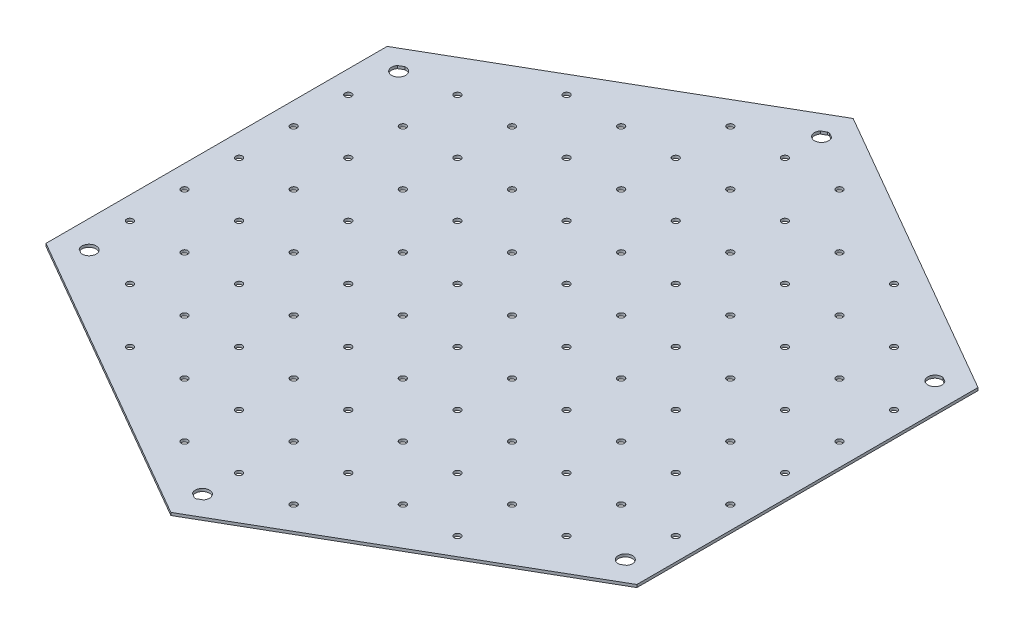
ISO-10303-21;
HEADER;
FILE_DESCRIPTION(('STEP AP214'),'2;1');
FILE_NAME('part.step','',(''),(''),'','','');
FILE_SCHEMA(('AUTOMOTIVE_DESIGN { 1 0 10303 214 1 1 1 1 }'));
ENDSEC;
DATA;
#1=APPLICATION_CONTEXT('core data for automotive mechanical design processes');
#2=APPLICATION_PROTOCOL_DEFINITION('international standard','automotive_design',2000,#1);
#3=PRODUCT_CONTEXT('',#1,'mechanical');
#4=PRODUCT('Part','Part','',(#3));
#5=PRODUCT_RELATED_PRODUCT_CATEGORY('part','',(#4));
#6=PRODUCT_DEFINITION_FORMATION('','',#4);
#7=PRODUCT_DEFINITION_CONTEXT('part definition',#1,'design');
#8=PRODUCT_DEFINITION('design','',#6,#7);
#9=PRODUCT_DEFINITION_SHAPE('','',#8);
#10=(LENGTH_UNIT() NAMED_UNIT(*) SI_UNIT(.MILLI.,.METRE.));
#11=(NAMED_UNIT(*) PLANE_ANGLE_UNIT() SI_UNIT($,.RADIAN.));
#12=(NAMED_UNIT(*) SI_UNIT($,.STERADIAN.) SOLID_ANGLE_UNIT());
#13=UNCERTAINTY_MEASURE_WITH_UNIT(LENGTH_MEASURE(1.E-05),#10,'distance_accuracy_value','');
#14=(GEOMETRIC_REPRESENTATION_CONTEXT(3) GLOBAL_UNCERTAINTY_ASSIGNED_CONTEXT((#13)) GLOBAL_UNIT_ASSIGNED_CONTEXT((#10,
#11,#12)) REPRESENTATION_CONTEXT('',''));
#15=CARTESIAN_POINT('',(0.,0.,0.));
#16=DIRECTION('',(0.,0.,1.));
#17=DIRECTION('',(1.,0.,0.));
#18=AXIS2_PLACEMENT_3D('',#15,#16,#17);
#19=CARTESIAN_POINT('',(0.,0.,56.7264973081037));
#20=DIRECTION('',(0.,1.,0.));
#21=DIRECTION('',(0.,0.,1.));
#22=AXIS2_PLACEMENT_3D('',#19,#20,#21);
#23=CYLINDRICAL_SURFACE('',#22,1.3);
#24=CARTESIAN_POINT('',(0.,0.5,56.7264973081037));
#25=DIRECTION('',(0.,1.,0.));
#26=DIRECTION('',(0.,0.,1.));
#27=AXIS2_PLACEMENT_3D('',#24,#25,#26);
#28=CIRCLE('',#27,1.3);
#29=CARTESIAN_POINT('',(1.03301270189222,0.5,57.5157277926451));
#30=VERTEX_POINT('',#29);
#31=CARTESIAN_POINT('',(-1.0330127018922,0.5,57.5157277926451));
#32=VERTEX_POINT('',#31);
#33=EDGE_CURVE('E257',#30,#32,#28,.T.);
#34=ORIENTED_EDGE('',*,*,#33,.T.);
#35=DIRECTION('',(0.,1.,0.));
#36=VECTOR('',#35,1.);
#37=CARTESIAN_POINT('',(-1.0330127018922,0.,57.5157277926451));
#38=LINE('',#37,#36);
#39=CARTESIAN_POINT('',(-1.0330127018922,0.,57.5157277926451));
#40=VERTEX_POINT('',#39);
#41=EDGE_CURVE('E11',#32,#40,#38,.F.);
#42=ORIENTED_EDGE('',*,*,#41,.T.);
#43=CARTESIAN_POINT('',(0.,0.,56.7264973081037));
#44=DIRECTION('',(0.,1.,0.));
#45=DIRECTION('',(0.,0.,1.));
#46=AXIS2_PLACEMENT_3D('',#43,#44,#45);
#47=CIRCLE('',#46,1.3);
#48=CARTESIAN_POINT('',(1.03301270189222,0.,57.5157277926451));
#49=VERTEX_POINT('',#48);
#50=EDGE_CURVE('E256',#49,#40,#47,.T.);
#51=ORIENTED_EDGE('',*,*,#50,.F.);
#52=DIRECTION('',(0.,1.,0.));
#53=VECTOR('',#52,1.);
#54=CARTESIAN_POINT('',(1.03301270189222,0.,57.5157277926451));
#55=LINE('',#54,#53);
#56=EDGE_CURVE('E211',#49,#30,#55,.T.);
#57=ORIENTED_EDGE('',*,*,#56,.T.);
#58=EDGE_LOOP('',(#34,#42,#51,#57));
#59=FACE_BOUND('',#58,.T.);
#60=ADVANCED_FACE('F33',(#59),#23,.F.);
#61=CARTESIAN_POINT('',(0.,0.,-56.7264973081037));
#62=DIRECTION('',(0.,1.,0.));
#63=DIRECTION('',(0.,0.,1.));
#64=AXIS2_PLACEMENT_3D('',#61,#62,#63);
#65=CYLINDRICAL_SURFACE('',#64,1.3);
#66=CARTESIAN_POINT('',(0.,0.5,-56.7264973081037));
#67=DIRECTION('',(0.,1.,0.));
#68=DIRECTION('',(0.,0.,1.));
#69=AXIS2_PLACEMENT_3D('',#66,#67,#68);
#70=CIRCLE('',#69,1.3);
#71=CARTESIAN_POINT('',(-1.03301270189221,0.5,-57.5157277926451));
#72=VERTEX_POINT('',#71);
#73=CARTESIAN_POINT('',(1.03301270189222,0.5,-57.5157277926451));
#74=VERTEX_POINT('',#73);
#75=EDGE_CURVE('E273',#72,#74,#70,.T.);
#76=ORIENTED_EDGE('',*,*,#75,.T.);
#77=DIRECTION('',(0.,1.,0.));
#78=VECTOR('',#77,1.);
#79=CARTESIAN_POINT('',(1.03301270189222,0.,-57.5157277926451));
#80=LINE('',#79,#78);
#81=CARTESIAN_POINT('',(1.03301270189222,0.,-57.5157277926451));
#82=VERTEX_POINT('',#81);
#83=EDGE_CURVE('E231',#74,#82,#80,.F.);
#84=ORIENTED_EDGE('',*,*,#83,.T.);
#85=CARTESIAN_POINT('',(0.,0.,-56.7264973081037));
#86=DIRECTION('',(0.,1.,0.));
#87=DIRECTION('',(0.,0.,1.));
#88=AXIS2_PLACEMENT_3D('',#85,#86,#87);
#89=CIRCLE('',#88,1.3);
#90=CARTESIAN_POINT('',(-1.03301270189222,0.,-57.5157277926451));
#91=VERTEX_POINT('',#90);
#92=EDGE_CURVE('E268',#91,#82,#89,.T.);
#93=ORIENTED_EDGE('',*,*,#92,.F.);
#94=DIRECTION('',(0.,1.,0.));
#95=VECTOR('',#94,1.);
#96=CARTESIAN_POINT('',(-1.03301270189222,0.,-57.5157277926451));
#97=LINE('',#96,#95);
#98=EDGE_CURVE('E241',#91,#72,#97,.T.);
#99=ORIENTED_EDGE('',*,*,#98,.T.);
#100=EDGE_LOOP('',(#76,#84,#93,#99));
#101=FACE_BOUND('',#100,.T.);
#102=ADVANCED_FACE('F914',(#101),#65,.F.);
#103=CARTESIAN_POINT('',(0.,0.5,0.));
#104=DIRECTION('',(0.,1.,0.));
#105=DIRECTION('',(0.,0.,1.));
#106=AXIS2_PLACEMENT_3D('',#103,#104,#105);
#107=PLANE('',#106);
#108=CARTESIAN_POINT('',(-0.166987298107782,0.5,58.0157277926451));
#109=VERTEX_POINT('',#108);
#110=CARTESIAN_POINT('',(0.16698729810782,0.5,58.0157277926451));
#111=VERTEX_POINT('',#110);
#112=EDGE_CURVE('E251',#109,#111,#28,.T.);
#113=ORIENTED_EDGE('',*,*,#112,.F.);
#114=DIRECTION('',(-0.866025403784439,0.,-0.5));
#115=VECTOR('',#114,1.);
#116=CARTESIAN_POINT('',(-54.1265877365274,0.5,26.8621379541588));
#117=LINE('',#116,#115);
#118=EDGE_CURVE('E204',#109,#32,#117,.T.);
#119=ORIENTED_EDGE('',*,*,#118,.T.);
#120=ORIENTED_EDGE('',*,*,#33,.F.);
#121=DIRECTION('',(-0.866025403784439,0.,0.5));
#122=VECTOR('',#121,1.);
#123=CARTESIAN_POINT('',(0.,0.5,58.1121379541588));
#124=LINE('',#123,#122);
#125=EDGE_CURVE('E201',#30,#111,#124,.T.);
#126=ORIENTED_EDGE('',*,*,#125,.T.);
#127=EDGE_LOOP('',(#113,#119,#120,#126));
#128=FACE_BOUND('',#127,.T.);
#129=CARTESIAN_POINT('',(-49.1265877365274,0.5,28.3632486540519));
#130=DIRECTION('',(0.,1.,0.));
#131=DIRECTION('',(0.,0.,1.));
#132=AXIS2_PLACEMENT_3D('',#129,#130,#131);
#133=CIRCLE('',#132,1.3);
#134=CARTESIAN_POINT('',(-49.2935750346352,0.5,29.6524791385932));
#135=VERTEX_POINT('',#134);
#136=CARTESIAN_POINT('',(-50.1596004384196,0.5,29.1524791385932));
#137=VERTEX_POINT('',#136);
#138=EDGE_CURVE('E48',#135,#137,#133,.T.);
#139=ORIENTED_EDGE('',*,*,#138,.F.);
#140=EDGE_CURVE('E200',#135,#137,#117,.T.);
#141=ORIENTED_EDGE('',*,*,#140,.T.);
#142=EDGE_LOOP('',(#139,#141));
#143=FACE_BOUND('',#142,.T.);
#144=DIRECTION('',(0.,0.,1.));
#145=VECTOR('',#144,1.);
#146=CARTESIAN_POINT('',(-54.1265877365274,0.5,-31.25));
#147=LINE('',#146,#145);
#148=CARTESIAN_POINT('',(-54.1265877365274,0.5,-31.25));
#149=VERTEX_POINT('',#148);
#150=CARTESIAN_POINT('',(-54.1265877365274,0.5,31.25));
#151=VERTEX_POINT('',#150);
#152=EDGE_CURVE('E814',#149,#151,#147,.T.);
#153=ORIENTED_EDGE('',*,*,#152,.T.);
#154=DIRECTION('',(0.866025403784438,0.,0.5));
#155=VECTOR('',#154,1.);
#156=CARTESIAN_POINT('',(-54.1265877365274,0.5,31.25));
#157=LINE('',#156,#155);
#158=CARTESIAN_POINT('',(0.,0.5,62.5));
#159=VERTEX_POINT('',#158);
#160=EDGE_CURVE('E816',#151,#159,#157,.T.);
#161=ORIENTED_EDGE('',*,*,#160,.T.);
#162=DIRECTION('',(0.866025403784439,0.,-0.5));
#163=VECTOR('',#162,1.);
#164=CARTESIAN_POINT('',(0.,0.5,62.5));
#165=LINE('',#164,#163);
#166=CARTESIAN_POINT('',(54.1265877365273,0.5,31.25));
#167=VERTEX_POINT('',#166);
#168=EDGE_CURVE('E818',#159,#167,#165,.T.);
#169=ORIENTED_EDGE('',*,*,#168,.T.);
#170=DIRECTION('',(0.,0.,-1.));
#171=VECTOR('',#170,1.);
#172=CARTESIAN_POINT('',(54.1265877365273,0.5,31.25));
#173=LINE('',#172,#171);
#174=CARTESIAN_POINT('',(54.1265877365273,0.5,-31.25));
#175=VERTEX_POINT('',#174);
#176=EDGE_CURVE('E820',#167,#175,#173,.T.);
#177=ORIENTED_EDGE('',*,*,#176,.T.);
#178=DIRECTION('',(-0.866025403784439,0.,-0.5));
#179=VECTOR('',#178,1.);
#180=CARTESIAN_POINT('',(54.1265877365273,0.5,-31.25));
#181=LINE('',#180,#179);
#182=CARTESIAN_POINT('',(0.,0.5,-62.5));
#183=VERTEX_POINT('',#182);
#184=EDGE_CURVE('E809',#175,#183,#181,.T.);
#185=ORIENTED_EDGE('',*,*,#184,.T.);
#186=DIRECTION('',(-0.866025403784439,0.,0.5));
#187=VECTOR('',#186,1.);
#188=CARTESIAN_POINT('',(0.,0.5,-62.5));
#189=LINE('',#188,#187);
#190=EDGE_CURVE('E811',#183,#149,#189,.T.);
#191=ORIENTED_EDGE('',*,*,#190,.T.);
#192=EDGE_LOOP('',(#153,#161,#169,#177,#185,#191));
#193=FACE_BOUND('',#192,.T.);
#194=CARTESIAN_POINT('',(49.1265877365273,0.5,28.3632486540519));
#195=DIRECTION('',(0.,1.,0.));
#196=DIRECTION('',(0.,0.,1.));
#197=AXIS2_PLACEMENT_3D('',#194,#195,#196);
#198=CIRCLE('',#197,1.3);
#199=CARTESIAN_POINT('',(50.1596004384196,0.5,29.1524791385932));
#200=VERTEX_POINT('',#199);
#201=CARTESIAN_POINT('',(49.2935750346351,0.5,29.6524791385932));
#202=VERTEX_POINT('',#201);
#203=EDGE_CURVE('E178',#200,#202,#198,.T.);
#204=ORIENTED_EDGE('',*,*,#203,.F.);
#205=EDGE_CURVE('E183',#200,#202,#124,.T.);
#206=ORIENTED_EDGE('',*,*,#205,.T.);
#207=EDGE_LOOP('',(#204,#206));
#208=FACE_BOUND('',#207,.T.);
#209=CARTESIAN_POINT('',(-20.,0.5,-40.));
#210=DIRECTION('',(0.,-1.,0.));
#211=DIRECTION('',(0.,0.,-1.));
#212=AXIS2_PLACEMENT_3D('',#209,#210,#211);
#213=CIRCLE('',#212,0.6);
#214=CARTESIAN_POINT('',(-20.,0.5,-40.6));
#215=VERTEX_POINT('',#214);
#216=EDGE_CURVE('E284',#215,#215,#213,.T.);
#217=ORIENTED_EDGE('',*,*,#216,.T.);
#218=EDGE_LOOP('',(#217));
#219=FACE_BOUND('',#218,.T.);
#220=CARTESIAN_POINT('',(-30.,0.5,-30.));
#221=DIRECTION('',(0.,-1.,0.));
#222=DIRECTION('',(0.,0.,-1.));
#223=AXIS2_PLACEMENT_3D('',#220,#221,#222);
#224=CIRCLE('',#223,0.6);
#225=CARTESIAN_POINT('',(-30.,0.5,-30.6));
#226=VERTEX_POINT('',#225);
#227=EDGE_CURVE('E302',#226,#226,#224,.T.);
#228=ORIENTED_EDGE('',*,*,#227,.T.);
#229=EDGE_LOOP('',(#228));
#230=FACE_BOUND('',#229,.T.);
#231=CARTESIAN_POINT('',(-10.,0.5,-30.));
#232=DIRECTION('',(0.,-1.,0.));
#233=DIRECTION('',(0.,0.,-1.));
#234=AXIS2_PLACEMENT_3D('',#231,#232,#233);
#235=CIRCLE('',#234,0.6);
#236=CARTESIAN_POINT('',(-10.,0.5,-30.6));
#237=VERTEX_POINT('',#236);
#238=EDGE_CURVE('E314',#237,#237,#235,.T.);
#239=ORIENTED_EDGE('',*,*,#238,.T.);
#240=EDGE_LOOP('',(#239));
#241=FACE_BOUND('',#240,.T.);
#242=CARTESIAN_POINT('',(-40.,0.5,-20.));
#243=DIRECTION('',(0.,-1.,0.));
#244=DIRECTION('',(0.,0.,-1.));
#245=AXIS2_PLACEMENT_3D('',#242,#243,#244);
#246=CIRCLE('',#245,0.6);
#247=CARTESIAN_POINT('',(-40.,0.5,-20.6));
#248=VERTEX_POINT('',#247);
#249=EDGE_CURVE('E326',#248,#248,#246,.T.);
#250=ORIENTED_EDGE('',*,*,#249,.T.);
#251=EDGE_LOOP('',(#250));
#252=FACE_BOUND('',#251,.T.);
#253=CARTESIAN_POINT('',(-20.,0.5,-20.));
#254=DIRECTION('',(0.,-1.,0.));
#255=DIRECTION('',(0.,0.,-1.));
#256=AXIS2_PLACEMENT_3D('',#253,#254,#255);
#257=CIRCLE('',#256,0.6);
#258=CARTESIAN_POINT('',(-20.,0.5,-20.6));
#259=VERTEX_POINT('',#258);
#260=EDGE_CURVE('E338',#259,#259,#257,.T.);
#261=ORIENTED_EDGE('',*,*,#260,.T.);
#262=EDGE_LOOP('',(#261));
#263=FACE_BOUND('',#262,.T.);
#264=CARTESIAN_POINT('',(-50.,0.5,-9.99999999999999));
#265=DIRECTION('',(0.,-1.,0.));
#266=DIRECTION('',(0.,0.,-1.));
#267=AXIS2_PLACEMENT_3D('',#264,#265,#266);
#268=CIRCLE('',#267,0.6);
#269=CARTESIAN_POINT('',(-50.,0.5,-10.6));
#270=VERTEX_POINT('',#269);
#271=EDGE_CURVE('E350',#270,#270,#268,.T.);
#272=ORIENTED_EDGE('',*,*,#271,.T.);
#273=EDGE_LOOP('',(#272));
#274=FACE_BOUND('',#273,.T.);
#275=CARTESIAN_POINT('',(-30.,0.5,-9.99999999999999));
#276=DIRECTION('',(0.,-1.,0.));
#277=DIRECTION('',(0.,0.,-1.));
#278=AXIS2_PLACEMENT_3D('',#275,#276,#277);
#279=CIRCLE('',#278,0.6);
#280=CARTESIAN_POINT('',(-30.,0.5,-10.6));
#281=VERTEX_POINT('',#280);
#282=EDGE_CURVE('E362',#281,#281,#279,.T.);
#283=ORIENTED_EDGE('',*,*,#282,.T.);
#284=EDGE_LOOP('',(#283));
#285=FACE_BOUND('',#284,.T.);
#286=CARTESIAN_POINT('',(-10.,0.5,-10.));
#287=DIRECTION('',(0.,-1.,0.));
#288=DIRECTION('',(0.,0.,-1.));
#289=AXIS2_PLACEMENT_3D('',#286,#287,#288);
#290=CIRCLE('',#289,0.6);
#291=CARTESIAN_POINT('',(-10.,0.5,-10.6));
#292=VERTEX_POINT('',#291);
#293=EDGE_CURVE('E374',#292,#292,#290,.T.);
#294=ORIENTED_EDGE('',*,*,#293,.T.);
#295=EDGE_LOOP('',(#294));
#296=FACE_BOUND('',#295,.T.);
#297=CARTESIAN_POINT('',(10.,0.5,-50.));
#298=DIRECTION('',(0.,1.,0.));
#299=DIRECTION('',(0.,0.,-1.));
#300=AXIS2_PLACEMENT_3D('',#297,#298,#299);
#301=CIRCLE('',#300,0.6);
#302=CARTESIAN_POINT('',(10.,0.5,-50.6));
#303=VERTEX_POINT('',#302);
#304=EDGE_CURVE('E380',#303,#303,#301,.T.);
#305=ORIENTED_EDGE('',*,*,#304,.F.);
#306=EDGE_LOOP('',(#305));
#307=FACE_BOUND('',#306,.T.);
#308=CARTESIAN_POINT('',(0.,0.5,-50.));
#309=DIRECTION('',(0.,1.,0.));
#310=DIRECTION('',(0.,0.,-1.));
#311=AXIS2_PLACEMENT_3D('',#308,#309,#310);
#312=CIRCLE('',#311,0.6);
#313=CARTESIAN_POINT('',(0.,0.5,-50.6));
#314=VERTEX_POINT('',#313);
#315=EDGE_CURVE('E386',#314,#314,#312,.T.);
#316=ORIENTED_EDGE('',*,*,#315,.F.);
#317=EDGE_LOOP('',(#316));
#318=FACE_BOUND('',#317,.T.);
#319=CARTESIAN_POINT('',(30.,0.5,-40.));
#320=DIRECTION('',(0.,1.,0.));
#321=DIRECTION('',(0.,0.,-1.));
#322=AXIS2_PLACEMENT_3D('',#319,#320,#321);
#323=CIRCLE('',#322,0.6);
#324=CARTESIAN_POINT('',(30.,0.5,-40.6));
#325=VERTEX_POINT('',#324);
#326=EDGE_CURVE('E392',#325,#325,#323,.T.);
#327=ORIENTED_EDGE('',*,*,#326,.F.);
#328=EDGE_LOOP('',(#327));
#329=FACE_BOUND('',#328,.T.);
#330=CARTESIAN_POINT('',(20.,0.5,-40.));
#331=DIRECTION('',(0.,1.,0.));
#332=DIRECTION('',(0.,0.,-1.));
#333=AXIS2_PLACEMENT_3D('',#330,#331,#332);
#334=CIRCLE('',#333,0.6);
#335=CARTESIAN_POINT('',(20.,0.5,-40.6));
#336=VERTEX_POINT('',#335);
#337=EDGE_CURVE('E398',#336,#336,#334,.T.);
#338=ORIENTED_EDGE('',*,*,#337,.F.);
#339=EDGE_LOOP('',(#338));
#340=FACE_BOUND('',#339,.T.);
#341=CARTESIAN_POINT('',(10.,0.5,-40.));
#342=DIRECTION('',(0.,1.,0.));
#343=DIRECTION('',(0.,0.,-1.));
#344=AXIS2_PLACEMENT_3D('',#341,#342,#343);
#345=CIRCLE('',#344,0.6);
#346=CARTESIAN_POINT('',(10.,0.5,-40.6));
#347=VERTEX_POINT('',#346);
#348=EDGE_CURVE('E404',#347,#347,#345,.T.);
#349=ORIENTED_EDGE('',*,*,#348,.F.);
#350=EDGE_LOOP('',(#349));
#351=FACE_BOUND('',#350,.T.);
#352=CARTESIAN_POINT('',(0.,0.5,-40.));
#353=DIRECTION('',(0.,1.,0.));
#354=DIRECTION('',(0.,0.,-1.));
#355=AXIS2_PLACEMENT_3D('',#352,#353,#354);
#356=CIRCLE('',#355,0.6);
#357=CARTESIAN_POINT('',(0.,0.5,-40.6));
#358=VERTEX_POINT('',#357);
#359=EDGE_CURVE('E410',#358,#358,#356,.T.);
#360=ORIENTED_EDGE('',*,*,#359,.F.);
#361=EDGE_LOOP('',(#360));
#362=FACE_BOUND('',#361,.T.);
#363=CARTESIAN_POINT('',(40.,0.5,-30.));
#364=DIRECTION('',(0.,1.,0.));
#365=DIRECTION('',(0.,0.,-1.));
#366=AXIS2_PLACEMENT_3D('',#363,#364,#365);
#367=CIRCLE('',#366,0.6);
#368=CARTESIAN_POINT('',(40.,0.5,-30.6));
#369=VERTEX_POINT('',#368);
#370=EDGE_CURVE('E416',#369,#369,#367,.T.);
#371=ORIENTED_EDGE('',*,*,#370,.F.);
#372=EDGE_LOOP('',(#371));
#373=FACE_BOUND('',#372,.T.);
#374=CARTESIAN_POINT('',(30.,0.5,-30.));
#375=DIRECTION('',(0.,1.,0.));
#376=DIRECTION('',(0.,0.,-1.));
#377=AXIS2_PLACEMENT_3D('',#374,#375,#376);
#378=CIRCLE('',#377,0.6);
#379=CARTESIAN_POINT('',(30.,0.5,-30.6));
#380=VERTEX_POINT('',#379);
#381=EDGE_CURVE('E422',#380,#380,#378,.T.);
#382=ORIENTED_EDGE('',*,*,#381,.F.);
#383=EDGE_LOOP('',(#382));
#384=FACE_BOUND('',#383,.T.);
#385=CARTESIAN_POINT('',(20.,0.5,-30.));
#386=DIRECTION('',(0.,1.,0.));
#387=DIRECTION('',(0.,0.,-1.));
#388=AXIS2_PLACEMENT_3D('',#385,#386,#387);
#389=CIRCLE('',#388,0.6);
#390=CARTESIAN_POINT('',(20.,0.5,-30.6));
#391=VERTEX_POINT('',#390);
#392=EDGE_CURVE('E428',#391,#391,#389,.T.);
#393=ORIENTED_EDGE('',*,*,#392,.F.);
#394=EDGE_LOOP('',(#393));
#395=FACE_BOUND('',#394,.T.);
#396=CARTESIAN_POINT('',(10.,0.5,-30.));
#397=DIRECTION('',(0.,1.,0.));
#398=DIRECTION('',(0.,0.,-1.));
#399=AXIS2_PLACEMENT_3D('',#396,#397,#398);
#400=CIRCLE('',#399,0.6);
#401=CARTESIAN_POINT('',(10.,0.5,-30.6));
#402=VERTEX_POINT('',#401);
#403=EDGE_CURVE('E434',#402,#402,#400,.T.);
#404=ORIENTED_EDGE('',*,*,#403,.F.);
#405=EDGE_LOOP('',(#404));
#406=FACE_BOUND('',#405,.T.);
#407=CARTESIAN_POINT('',(0.,0.5,-30.));
#408=DIRECTION('',(0.,1.,0.));
#409=DIRECTION('',(0.,0.,-1.));
#410=AXIS2_PLACEMENT_3D('',#407,#408,#409);
#411=CIRCLE('',#410,0.6);
#412=CARTESIAN_POINT('',(0.,0.5,-30.6));
#413=VERTEX_POINT('',#412);
#414=EDGE_CURVE('E440',#413,#413,#411,.T.);
#415=ORIENTED_EDGE('',*,*,#414,.F.);
#416=EDGE_LOOP('',(#415));
#417=FACE_BOUND('',#416,.T.);
#418=CARTESIAN_POINT('',(50.,0.5,-20.));
#419=DIRECTION('',(0.,1.,0.));
#420=DIRECTION('',(0.,0.,-1.));
#421=AXIS2_PLACEMENT_3D('',#418,#419,#420);
#422=CIRCLE('',#421,0.6);
#423=CARTESIAN_POINT('',(50.,0.5,-20.6));
#424=VERTEX_POINT('',#423);
#425=EDGE_CURVE('E446',#424,#424,#422,.T.);
#426=ORIENTED_EDGE('',*,*,#425,.F.);
#427=EDGE_LOOP('',(#426));
#428=FACE_BOUND('',#427,.T.);
#429=CARTESIAN_POINT('',(40.,0.5,-20.));
#430=DIRECTION('',(0.,1.,0.));
#431=DIRECTION('',(0.,0.,-1.));
#432=AXIS2_PLACEMENT_3D('',#429,#430,#431);
#433=CIRCLE('',#432,0.6);
#434=CARTESIAN_POINT('',(40.,0.5,-20.6));
#435=VERTEX_POINT('',#434);
#436=EDGE_CURVE('E452',#435,#435,#433,.T.);
#437=ORIENTED_EDGE('',*,*,#436,.F.);
#438=EDGE_LOOP('',(#437));
#439=FACE_BOUND('',#438,.T.);
#440=CARTESIAN_POINT('',(30.,0.5,-20.));
#441=DIRECTION('',(0.,1.,0.));
#442=DIRECTION('',(0.,0.,-1.));
#443=AXIS2_PLACEMENT_3D('',#440,#441,#442);
#444=CIRCLE('',#443,0.6);
#445=CARTESIAN_POINT('',(30.,0.5,-20.6));
#446=VERTEX_POINT('',#445);
#447=EDGE_CURVE('E458',#446,#446,#444,.T.);
#448=ORIENTED_EDGE('',*,*,#447,.F.);
#449=EDGE_LOOP('',(#448));
#450=FACE_BOUND('',#449,.T.);
#451=CARTESIAN_POINT('',(20.,0.5,-20.));
#452=DIRECTION('',(0.,1.,0.));
#453=DIRECTION('',(0.,0.,-1.));
#454=AXIS2_PLACEMENT_3D('',#451,#452,#453);
#455=CIRCLE('',#454,0.6);
#456=CARTESIAN_POINT('',(20.,0.5,-20.6));
#457=VERTEX_POINT('',#456);
#458=EDGE_CURVE('E464',#457,#457,#455,.T.);
#459=ORIENTED_EDGE('',*,*,#458,.F.);
#460=EDGE_LOOP('',(#459));
#461=FACE_BOUND('',#460,.T.);
#462=CARTESIAN_POINT('',(10.,0.5,-20.));
#463=DIRECTION('',(0.,1.,0.));
#464=DIRECTION('',(0.,0.,-1.));
#465=AXIS2_PLACEMENT_3D('',#462,#463,#464);
#466=CIRCLE('',#465,0.6);
#467=CARTESIAN_POINT('',(10.,0.5,-20.6));
#468=VERTEX_POINT('',#467);
#469=EDGE_CURVE('E470',#468,#468,#466,.T.);
#470=ORIENTED_EDGE('',*,*,#469,.F.);
#471=EDGE_LOOP('',(#470));
#472=FACE_BOUND('',#471,.T.);
#473=CARTESIAN_POINT('',(0.,0.5,-20.));
#474=DIRECTION('',(0.,1.,0.));
#475=DIRECTION('',(0.,0.,-1.));
#476=AXIS2_PLACEMENT_3D('',#473,#474,#475);
#477=CIRCLE('',#476,0.6);
#478=CARTESIAN_POINT('',(0.,0.5,-20.6));
#479=VERTEX_POINT('',#478);
#480=EDGE_CURVE('E476',#479,#479,#477,.T.);
#481=ORIENTED_EDGE('',*,*,#480,.F.);
#482=EDGE_LOOP('',(#481));
#483=FACE_BOUND('',#482,.T.);
#484=CARTESIAN_POINT('',(50.,0.5,-9.99999999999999));
#485=DIRECTION('',(0.,1.,0.));
#486=DIRECTION('',(0.,0.,-1.));
#487=AXIS2_PLACEMENT_3D('',#484,#485,#486);
#488=CIRCLE('',#487,0.6);
#489=CARTESIAN_POINT('',(50.,0.5,-10.6));
#490=VERTEX_POINT('',#489);
#491=EDGE_CURVE('E482',#490,#490,#488,.T.);
#492=ORIENTED_EDGE('',*,*,#491,.F.);
#493=EDGE_LOOP('',(#492));
#494=FACE_BOUND('',#493,.T.);
#495=CARTESIAN_POINT('',(40.,0.5,-10.));
#496=DIRECTION('',(0.,1.,0.));
#497=DIRECTION('',(0.,0.,-1.));
#498=AXIS2_PLACEMENT_3D('',#495,#496,#497);
#499=CIRCLE('',#498,0.6);
#500=CARTESIAN_POINT('',(40.,0.5,-10.6));
#501=VERTEX_POINT('',#500);
#502=EDGE_CURVE('E488',#501,#501,#499,.T.);
#503=ORIENTED_EDGE('',*,*,#502,.F.);
#504=EDGE_LOOP('',(#503));
#505=FACE_BOUND('',#504,.T.);
#506=CARTESIAN_POINT('',(30.,0.5,-10.));
#507=DIRECTION('',(0.,1.,0.));
#508=DIRECTION('',(0.,0.,-1.));
#509=AXIS2_PLACEMENT_3D('',#506,#507,#508);
#510=CIRCLE('',#509,0.6);
#511=CARTESIAN_POINT('',(30.,0.5,-10.6));
#512=VERTEX_POINT('',#511);
#513=EDGE_CURVE('E494',#512,#512,#510,.T.);
#514=ORIENTED_EDGE('',*,*,#513,.F.);
#515=EDGE_LOOP('',(#514));
#516=FACE_BOUND('',#515,.T.);
#517=CARTESIAN_POINT('',(20.,0.5,-10.));
#518=DIRECTION('',(0.,1.,0.));
#519=DIRECTION('',(0.,0.,-1.));
#520=AXIS2_PLACEMENT_3D('',#517,#518,#519);
#521=CIRCLE('',#520,0.6);
#522=CARTESIAN_POINT('',(20.,0.5,-10.6));
#523=VERTEX_POINT('',#522);
#524=EDGE_CURVE('E500',#523,#523,#521,.T.);
#525=ORIENTED_EDGE('',*,*,#524,.F.);
#526=EDGE_LOOP('',(#525));
#527=FACE_BOUND('',#526,.T.);
#528=CARTESIAN_POINT('',(10.,0.5,-10.));
#529=DIRECTION('',(0.,1.,0.));
#530=DIRECTION('',(0.,0.,-1.));
#531=AXIS2_PLACEMENT_3D('',#528,#529,#530);
#532=CIRCLE('',#531,0.6);
#533=CARTESIAN_POINT('',(10.,0.5,-10.6));
#534=VERTEX_POINT('',#533);
#535=EDGE_CURVE('E506',#534,#534,#532,.T.);
#536=ORIENTED_EDGE('',*,*,#535,.F.);
#537=EDGE_LOOP('',(#536));
#538=FACE_BOUND('',#537,.T.);
#539=CARTESIAN_POINT('',(0.,0.5,-10.));
#540=DIRECTION('',(0.,1.,0.));
#541=DIRECTION('',(0.,0.,-1.));
#542=AXIS2_PLACEMENT_3D('',#539,#540,#541);
#543=CIRCLE('',#542,0.6);
#544=CARTESIAN_POINT('',(0.,0.5,-10.6));
#545=VERTEX_POINT('',#544);
#546=EDGE_CURVE('E512',#545,#545,#543,.T.);
#547=ORIENTED_EDGE('',*,*,#546,.F.);
#548=EDGE_LOOP('',(#547));
#549=FACE_BOUND('',#548,.T.);
#550=CARTESIAN_POINT('',(-10.,0.5,50.));
#551=DIRECTION('',(0.,1.,0.));
#552=DIRECTION('',(0.,0.,1.));
#553=AXIS2_PLACEMENT_3D('',#550,#551,#552);
#554=CIRCLE('',#553,0.6);
#555=CARTESIAN_POINT('',(-10.,0.5,50.6));
#556=VERTEX_POINT('',#555);
#557=EDGE_CURVE('E518',#556,#556,#554,.T.);
#558=ORIENTED_EDGE('',*,*,#557,.F.);
#559=EDGE_LOOP('',(#558));
#560=FACE_BOUND('',#559,.T.);
#561=CARTESIAN_POINT('',(-30.,0.5,40.));
#562=DIRECTION('',(0.,1.,0.));
#563=DIRECTION('',(0.,0.,1.));
#564=AXIS2_PLACEMENT_3D('',#561,#562,#563);
#565=CIRCLE('',#564,0.6);
#566=CARTESIAN_POINT('',(-30.,0.5,40.6));
#567=VERTEX_POINT('',#566);
#568=EDGE_CURVE('E524',#567,#567,#565,.T.);
#569=ORIENTED_EDGE('',*,*,#568,.F.);
#570=EDGE_LOOP('',(#569));
#571=FACE_BOUND('',#570,.T.);
#572=CARTESIAN_POINT('',(-20.,0.5,40.));
#573=DIRECTION('',(0.,1.,0.));
#574=DIRECTION('',(0.,0.,1.));
#575=AXIS2_PLACEMENT_3D('',#572,#573,#574);
#576=CIRCLE('',#575,0.6);
#577=CARTESIAN_POINT('',(-20.,0.5,40.6));
#578=VERTEX_POINT('',#577);
#579=EDGE_CURVE('E530',#578,#578,#576,.T.);
#580=ORIENTED_EDGE('',*,*,#579,.F.);
#581=EDGE_LOOP('',(#580));
#582=FACE_BOUND('',#581,.T.);
#583=CARTESIAN_POINT('',(-10.,0.5,40.));
#584=DIRECTION('',(0.,1.,0.));
#585=DIRECTION('',(0.,0.,1.));
#586=AXIS2_PLACEMENT_3D('',#583,#584,#585);
#587=CIRCLE('',#586,0.6);
#588=CARTESIAN_POINT('',(-10.,0.5,40.6));
#589=VERTEX_POINT('',#588);
#590=EDGE_CURVE('E536',#589,#589,#587,.T.);
#591=ORIENTED_EDGE('',*,*,#590,.F.);
#592=EDGE_LOOP('',(#591));
#593=FACE_BOUND('',#592,.T.);
#594=CARTESIAN_POINT('',(-40.,0.5,30.));
#595=DIRECTION('',(0.,1.,0.));
#596=DIRECTION('',(0.,0.,1.));
#597=AXIS2_PLACEMENT_3D('',#594,#595,#596);
#598=CIRCLE('',#597,0.6);
#599=CARTESIAN_POINT('',(-40.,0.5,30.6));
#600=VERTEX_POINT('',#599);
#601=EDGE_CURVE('E542',#600,#600,#598,.T.);
#602=ORIENTED_EDGE('',*,*,#601,.F.);
#603=EDGE_LOOP('',(#602));
#604=FACE_BOUND('',#603,.T.);
#605=CARTESIAN_POINT('',(-30.,0.5,30.));
#606=DIRECTION('',(0.,1.,0.));
#607=DIRECTION('',(0.,0.,1.));
#608=AXIS2_PLACEMENT_3D('',#605,#606,#607);
#609=CIRCLE('',#608,0.6);
#610=CARTESIAN_POINT('',(-30.,0.5,30.6));
#611=VERTEX_POINT('',#610);
#612=EDGE_CURVE('E548',#611,#611,#609,.T.);
#613=ORIENTED_EDGE('',*,*,#612,.F.);
#614=EDGE_LOOP('',(#613));
#615=FACE_BOUND('',#614,.T.);
#616=CARTESIAN_POINT('',(-20.,0.5,30.));
#617=DIRECTION('',(0.,1.,0.));
#618=DIRECTION('',(0.,0.,1.));
#619=AXIS2_PLACEMENT_3D('',#616,#617,#618);
#620=CIRCLE('',#619,0.6);
#621=CARTESIAN_POINT('',(-20.,0.5,30.6));
#622=VERTEX_POINT('',#621);
#623=EDGE_CURVE('E554',#622,#622,#620,.T.);
#624=ORIENTED_EDGE('',*,*,#623,.F.);
#625=EDGE_LOOP('',(#624));
#626=FACE_BOUND('',#625,.T.);
#627=CARTESIAN_POINT('',(-10.,0.5,30.));
#628=DIRECTION('',(0.,1.,0.));
#629=DIRECTION('',(0.,0.,1.));
#630=AXIS2_PLACEMENT_3D('',#627,#628,#629);
#631=CIRCLE('',#630,0.6);
#632=CARTESIAN_POINT('',(-10.,0.5,30.6));
#633=VERTEX_POINT('',#632);
#634=EDGE_CURVE('E560',#633,#633,#631,.T.);
#635=ORIENTED_EDGE('',*,*,#634,.F.);
#636=EDGE_LOOP('',(#635));
#637=FACE_BOUND('',#636,.T.);
#638=CARTESIAN_POINT('',(-50.,0.5,20.));
#639=DIRECTION('',(0.,1.,0.));
#640=DIRECTION('',(0.,0.,1.));
#641=AXIS2_PLACEMENT_3D('',#638,#639,#640);
#642=CIRCLE('',#641,0.6);
#643=CARTESIAN_POINT('',(-50.,0.5,20.6));
#644=VERTEX_POINT('',#643);
#645=EDGE_CURVE('E566',#644,#644,#642,.T.);
#646=ORIENTED_EDGE('',*,*,#645,.F.);
#647=EDGE_LOOP('',(#646));
#648=FACE_BOUND('',#647,.T.);
#649=CARTESIAN_POINT('',(-40.,0.5,20.));
#650=DIRECTION('',(0.,1.,0.));
#651=DIRECTION('',(0.,0.,1.));
#652=AXIS2_PLACEMENT_3D('',#649,#650,#651);
#653=CIRCLE('',#652,0.6);
#654=CARTESIAN_POINT('',(-40.,0.5,20.6));
#655=VERTEX_POINT('',#654);
#656=EDGE_CURVE('E572',#655,#655,#653,.T.);
#657=ORIENTED_EDGE('',*,*,#656,.F.);
#658=EDGE_LOOP('',(#657));
#659=FACE_BOUND('',#658,.T.);
#660=CARTESIAN_POINT('',(-30.,0.5,20.));
#661=DIRECTION('',(0.,1.,0.));
#662=DIRECTION('',(0.,0.,1.));
#663=AXIS2_PLACEMENT_3D('',#660,#661,#662);
#664=CIRCLE('',#663,0.6);
#665=CARTESIAN_POINT('',(-30.,0.5,20.6));
#666=VERTEX_POINT('',#665);
#667=EDGE_CURVE('E578',#666,#666,#664,.T.);
#668=ORIENTED_EDGE('',*,*,#667,.F.);
#669=EDGE_LOOP('',(#668));
#670=FACE_BOUND('',#669,.T.);
#671=CARTESIAN_POINT('',(-20.,0.5,20.));
#672=DIRECTION('',(0.,1.,0.));
#673=DIRECTION('',(0.,0.,1.));
#674=AXIS2_PLACEMENT_3D('',#671,#672,#673);
#675=CIRCLE('',#674,0.6);
#676=CARTESIAN_POINT('',(-20.,0.5,20.6));
#677=VERTEX_POINT('',#676);
#678=EDGE_CURVE('E584',#677,#677,#675,.T.);
#679=ORIENTED_EDGE('',*,*,#678,.F.);
#680=EDGE_LOOP('',(#679));
#681=FACE_BOUND('',#680,.T.);
#682=CARTESIAN_POINT('',(-10.,0.5,20.));
#683=DIRECTION('',(0.,1.,0.));
#684=DIRECTION('',(0.,0.,1.));
#685=AXIS2_PLACEMENT_3D('',#682,#683,#684);
#686=CIRCLE('',#685,0.6);
#687=CARTESIAN_POINT('',(-10.,0.5,20.6));
#688=VERTEX_POINT('',#687);
#689=EDGE_CURVE('E590',#688,#688,#686,.T.);
#690=ORIENTED_EDGE('',*,*,#689,.F.);
#691=EDGE_LOOP('',(#690));
#692=FACE_BOUND('',#691,.T.);
#693=CARTESIAN_POINT('',(-50.,0.5,9.99999999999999));
#694=DIRECTION('',(0.,1.,0.));
#695=DIRECTION('',(0.,0.,1.));
#696=AXIS2_PLACEMENT_3D('',#693,#694,#695);
#697=CIRCLE('',#696,0.6);
#698=CARTESIAN_POINT('',(-50.,0.5,10.6));
#699=VERTEX_POINT('',#698);
#700=EDGE_CURVE('E596',#699,#699,#697,.T.);
#701=ORIENTED_EDGE('',*,*,#700,.F.);
#702=EDGE_LOOP('',(#701));
#703=FACE_BOUND('',#702,.T.);
#704=CARTESIAN_POINT('',(-40.,0.5,9.99999999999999));
#705=DIRECTION('',(0.,1.,0.));
#706=DIRECTION('',(0.,0.,1.));
#707=AXIS2_PLACEMENT_3D('',#704,#705,#706);
#708=CIRCLE('',#707,0.6);
#709=CARTESIAN_POINT('',(-40.,0.5,10.6));
#710=VERTEX_POINT('',#709);
#711=EDGE_CURVE('E602',#710,#710,#708,.T.);
#712=ORIENTED_EDGE('',*,*,#711,.F.);
#713=EDGE_LOOP('',(#712));
#714=FACE_BOUND('',#713,.T.);
#715=CARTESIAN_POINT('',(-30.,0.5,9.99999999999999));
#716=DIRECTION('',(0.,1.,0.));
#717=DIRECTION('',(0.,0.,1.));
#718=AXIS2_PLACEMENT_3D('',#715,#716,#717);
#719=CIRCLE('',#718,0.6);
#720=CARTESIAN_POINT('',(-30.,0.5,10.6));
#721=VERTEX_POINT('',#720);
#722=EDGE_CURVE('E608',#721,#721,#719,.T.);
#723=ORIENTED_EDGE('',*,*,#722,.F.);
#724=EDGE_LOOP('',(#723));
#725=FACE_BOUND('',#724,.T.);
#726=CARTESIAN_POINT('',(-20.,0.5,10.));
#727=DIRECTION('',(0.,1.,0.));
#728=DIRECTION('',(0.,0.,1.));
#729=AXIS2_PLACEMENT_3D('',#726,#727,#728);
#730=CIRCLE('',#729,0.6);
#731=CARTESIAN_POINT('',(-20.,0.5,10.6));
#732=VERTEX_POINT('',#731);
#733=EDGE_CURVE('E614',#732,#732,#730,.T.);
#734=ORIENTED_EDGE('',*,*,#733,.F.);
#735=EDGE_LOOP('',(#734));
#736=FACE_BOUND('',#735,.T.);
#737=CARTESIAN_POINT('',(-10.,0.5,10.));
#738=DIRECTION('',(0.,1.,0.));
#739=DIRECTION('',(0.,0.,1.));
#740=AXIS2_PLACEMENT_3D('',#737,#738,#739);
#741=CIRCLE('',#740,0.6);
#742=CARTESIAN_POINT('',(-10.,0.5,10.6));
#743=VERTEX_POINT('',#742);
#744=EDGE_CURVE('E620',#743,#743,#741,.T.);
#745=ORIENTED_EDGE('',*,*,#744,.F.);
#746=EDGE_LOOP('',(#745));
#747=FACE_BOUND('',#746,.T.);
#748=CARTESIAN_POINT('',(0.,0.5,50.));
#749=DIRECTION('',(0.,-1.,0.));
#750=DIRECTION('',(0.,0.,1.));
#751=AXIS2_PLACEMENT_3D('',#748,#749,#750);
#752=CIRCLE('',#751,0.6);
#753=CARTESIAN_POINT('',(0.,0.5,50.6));
#754=VERTEX_POINT('',#753);
#755=EDGE_CURVE('E632',#754,#754,#752,.T.);
#756=ORIENTED_EDGE('',*,*,#755,.T.);
#757=EDGE_LOOP('',(#756));
#758=FACE_BOUND('',#757,.T.);
#759=CARTESIAN_POINT('',(30.,0.5,40.));
#760=DIRECTION('',(0.,-1.,0.));
#761=DIRECTION('',(0.,0.,1.));
#762=AXIS2_PLACEMENT_3D('',#759,#760,#761);
#763=CIRCLE('',#762,0.6);
#764=CARTESIAN_POINT('',(30.,0.5,40.6));
#765=VERTEX_POINT('',#764);
#766=EDGE_CURVE('E638',#765,#765,#763,.T.);
#767=ORIENTED_EDGE('',*,*,#766,.T.);
#768=EDGE_LOOP('',(#767));
#769=FACE_BOUND('',#768,.T.);
#770=CARTESIAN_POINT('',(10.,0.5,40.));
#771=DIRECTION('',(0.,-1.,0.));
#772=DIRECTION('',(0.,0.,1.));
#773=AXIS2_PLACEMENT_3D('',#770,#771,#772);
#774=CIRCLE('',#773,0.6);
#775=CARTESIAN_POINT('',(10.,0.5,40.6));
#776=VERTEX_POINT('',#775);
#777=EDGE_CURVE('E650',#776,#776,#774,.T.);
#778=ORIENTED_EDGE('',*,*,#777,.T.);
#779=EDGE_LOOP('',(#778));
#780=FACE_BOUND('',#779,.T.);
#781=CARTESIAN_POINT('',(30.,0.5,30.));
#782=DIRECTION('',(0.,-1.,0.));
#783=DIRECTION('',(0.,0.,1.));
#784=AXIS2_PLACEMENT_3D('',#781,#782,#783);
#785=CIRCLE('',#784,0.6);
#786=CARTESIAN_POINT('',(30.,0.5,30.6));
#787=VERTEX_POINT('',#786);
#788=EDGE_CURVE('E668',#787,#787,#785,.T.);
#789=ORIENTED_EDGE('',*,*,#788,.T.);
#790=EDGE_LOOP('',(#789));
#791=FACE_BOUND('',#790,.T.);
#792=CARTESIAN_POINT('',(10.,0.5,30.));
#793=DIRECTION('',(0.,-1.,0.));
#794=DIRECTION('',(0.,0.,1.));
#795=AXIS2_PLACEMENT_3D('',#792,#793,#794);
#796=CIRCLE('',#795,0.6);
#797=CARTESIAN_POINT('',(10.,0.5,30.6));
#798=VERTEX_POINT('',#797);
#799=EDGE_CURVE('E680',#798,#798,#796,.T.);
#800=ORIENTED_EDGE('',*,*,#799,.T.);
#801=EDGE_LOOP('',(#800));
#802=FACE_BOUND('',#801,.T.);
#803=CARTESIAN_POINT('',(50.,0.5,20.));
#804=DIRECTION('',(0.,-1.,0.));
#805=DIRECTION('',(0.,0.,1.));
#806=AXIS2_PLACEMENT_3D('',#803,#804,#805);
#807=CIRCLE('',#806,0.6);
#808=CARTESIAN_POINT('',(50.,0.5,20.6));
#809=VERTEX_POINT('',#808);
#810=EDGE_CURVE('E692',#809,#809,#807,.T.);
#811=ORIENTED_EDGE('',*,*,#810,.T.);
#812=EDGE_LOOP('',(#811));
#813=FACE_BOUND('',#812,.T.);
#814=CARTESIAN_POINT('',(30.,0.5,20.));
#815=DIRECTION('',(0.,-1.,0.));
#816=DIRECTION('',(0.,0.,1.));
#817=AXIS2_PLACEMENT_3D('',#814,#815,#816);
#818=CIRCLE('',#817,0.6);
#819=CARTESIAN_POINT('',(30.,0.5,20.6));
#820=VERTEX_POINT('',#819);
#821=EDGE_CURVE('E704',#820,#820,#818,.T.);
#822=ORIENTED_EDGE('',*,*,#821,.T.);
#823=EDGE_LOOP('',(#822));
#824=FACE_BOUND('',#823,.T.);
#825=CARTESIAN_POINT('',(10.,0.5,20.));
#826=DIRECTION('',(0.,-1.,0.));
#827=DIRECTION('',(0.,0.,1.));
#828=AXIS2_PLACEMENT_3D('',#825,#826,#827);
#829=CIRCLE('',#828,0.6);
#830=CARTESIAN_POINT('',(10.,0.5,20.6));
#831=VERTEX_POINT('',#830);
#832=EDGE_CURVE('E716',#831,#831,#829,.T.);
#833=ORIENTED_EDGE('',*,*,#832,.T.);
#834=EDGE_LOOP('',(#833));
#835=FACE_BOUND('',#834,.T.);
#836=CARTESIAN_POINT('',(50.,0.5,9.99999999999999));
#837=DIRECTION('',(0.,-1.,0.));
#838=DIRECTION('',(0.,0.,1.));
#839=AXIS2_PLACEMENT_3D('',#836,#837,#838);
#840=CIRCLE('',#839,0.6);
#841=CARTESIAN_POINT('',(50.,0.5,10.6));
#842=VERTEX_POINT('',#841);
#843=EDGE_CURVE('E728',#842,#842,#840,.T.);
#844=ORIENTED_EDGE('',*,*,#843,.T.);
#845=EDGE_LOOP('',(#844));
#846=FACE_BOUND('',#845,.T.);
#847=CARTESIAN_POINT('',(30.,0.5,10.));
#848=DIRECTION('',(0.,-1.,0.));
#849=DIRECTION('',(0.,0.,1.));
#850=AXIS2_PLACEMENT_3D('',#847,#848,#849);
#851=CIRCLE('',#850,0.6);
#852=CARTESIAN_POINT('',(30.,0.5,10.6));
#853=VERTEX_POINT('',#852);
#854=EDGE_CURVE('E740',#853,#853,#851,.T.);
#855=ORIENTED_EDGE('',*,*,#854,.T.);
#856=EDGE_LOOP('',(#855));
#857=FACE_BOUND('',#856,.T.);
#858=CARTESIAN_POINT('',(10.,0.5,10.));
#859=DIRECTION('',(0.,-1.,0.));
#860=DIRECTION('',(0.,0.,1.));
#861=AXIS2_PLACEMENT_3D('',#858,#859,#860);
#862=CIRCLE('',#861,0.6);
#863=CARTESIAN_POINT('',(10.,0.5,10.6));
#864=VERTEX_POINT('',#863);
#865=EDGE_CURVE('E752',#864,#864,#862,.T.);
#866=ORIENTED_EDGE('',*,*,#865,.T.);
#867=EDGE_LOOP('',(#866));
#868=FACE_BOUND('',#867,.T.);
#869=CARTESIAN_POINT('',(50.,0.5,0.));
#870=DIRECTION('',(0.,-1.,0.));
#871=DIRECTION('',(0.,0.,1.));
#872=AXIS2_PLACEMENT_3D('',#869,#870,#871);
#873=CIRCLE('',#872,0.6);
#874=CARTESIAN_POINT('',(50.,0.5,0.599999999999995));
#875=VERTEX_POINT('',#874);
#876=EDGE_CURVE('E764',#875,#875,#873,.T.);
#877=ORIENTED_EDGE('',*,*,#876,.T.);
#878=EDGE_LOOP('',(#877));
#879=FACE_BOUND('',#878,.T.);
#880=CARTESIAN_POINT('',(30.,0.5,0.));
#881=DIRECTION('',(0.,-1.,0.));
#882=DIRECTION('',(0.,0.,1.));
#883=AXIS2_PLACEMENT_3D('',#880,#881,#882);
#884=CIRCLE('',#883,0.6);
#885=CARTESIAN_POINT('',(30.,0.5,0.599999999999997));
#886=VERTEX_POINT('',#885);
#887=EDGE_CURVE('E776',#886,#886,#884,.T.);
#888=ORIENTED_EDGE('',*,*,#887,.T.);
#889=EDGE_LOOP('',(#888));
#890=FACE_BOUND('',#889,.T.);
#891=CARTESIAN_POINT('',(10.,0.5,0.));
#892=DIRECTION('',(0.,-1.,0.));
#893=DIRECTION('',(0.,0.,1.));
#894=AXIS2_PLACEMENT_3D('',#891,#892,#893);
#895=CIRCLE('',#894,0.6);
#896=CARTESIAN_POINT('',(10.,0.5,0.599999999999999));
#897=VERTEX_POINT('',#896);
#898=EDGE_CURVE('E788',#897,#897,#895,.T.);
#899=ORIENTED_EDGE('',*,*,#898,.T.);
#900=EDGE_LOOP('',(#899));
#901=FACE_BOUND('',#900,.T.);
#902=CARTESIAN_POINT('',(-10.,0.5,0.));
#903=DIRECTION('',(0.,1.,0.));
#904=DIRECTION('',(0.,0.,1.));
#905=AXIS2_PLACEMENT_3D('',#902,#903,#904);
#906=CIRCLE('',#905,0.6);
#907=CARTESIAN_POINT('',(-10.,0.5,0.599999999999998));
#908=VERTEX_POINT('',#907);
#909=EDGE_CURVE('E799',#908,#908,#906,.T.);
#910=ORIENTED_EDGE('',*,*,#909,.F.);
#911=EDGE_LOOP('',(#910));
#912=FACE_BOUND('',#911,.T.);
#913=CARTESIAN_POINT('',(0.,0.5,0.));
#914=DIRECTION('',(0.,1.,0.));
#915=DIRECTION('',(0.,0.,1.));
#916=AXIS2_PLACEMENT_3D('',#913,#914,#915);
#917=CIRCLE('',#916,0.6);
#918=CARTESIAN_POINT('',(0.,0.5,0.6));
#919=VERTEX_POINT('',#918);
#920=EDGE_CURVE('E802',#919,#919,#917,.T.);
#921=ORIENTED_EDGE('',*,*,#920,.F.);
#922=EDGE_LOOP('',(#921));
#923=FACE_BOUND('',#922,.T.);
#924=CARTESIAN_POINT('',(-20.,0.5,0.));
#925=DIRECTION('',(0.,1.,0.));
#926=DIRECTION('',(0.,0.,1.));
#927=AXIS2_PLACEMENT_3D('',#924,#925,#926);
#928=CIRCLE('',#927,0.6);
#929=CARTESIAN_POINT('',(-20.,0.5,0.599999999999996));
#930=VERTEX_POINT('',#929);
#931=EDGE_CURVE('E853',#930,#930,#928,.T.);
#932=ORIENTED_EDGE('',*,*,#931,.F.);
#933=EDGE_LOOP('',(#932));
#934=FACE_BOUND('',#933,.T.);
#935=CARTESIAN_POINT('',(-30.,0.5,0.));
#936=DIRECTION('',(0.,1.,0.));
#937=DIRECTION('',(0.,0.,1.));
#938=AXIS2_PLACEMENT_3D('',#935,#936,#937);
#939=CIRCLE('',#938,0.6);
#940=CARTESIAN_POINT('',(-30.,0.5,0.599999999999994));
#941=VERTEX_POINT('',#940);
#942=EDGE_CURVE('E859',#941,#941,#939,.T.);
#943=ORIENTED_EDGE('',*,*,#942,.F.);
#944=EDGE_LOOP('',(#943));
#945=FACE_BOUND('',#944,.T.);
#946=CARTESIAN_POINT('',(-40.,0.5,0.));
#947=DIRECTION('',(0.,1.,0.));
#948=DIRECTION('',(0.,0.,1.));
#949=AXIS2_PLACEMENT_3D('',#946,#947,#948);
#950=CIRCLE('',#949,0.6);
#951=CARTESIAN_POINT('',(-40.,0.5,0.599999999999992));
#952=VERTEX_POINT('',#951);
#953=EDGE_CURVE('E865',#952,#952,#950,.T.);
#954=ORIENTED_EDGE('',*,*,#953,.F.);
#955=EDGE_LOOP('',(#954));
#956=FACE_BOUND('',#955,.T.);
#957=CARTESIAN_POINT('',(-50.,0.5,0.));
#958=DIRECTION('',(0.,1.,0.));
#959=DIRECTION('',(0.,0.,1.));
#960=AXIS2_PLACEMENT_3D('',#957,#958,#959);
#961=CIRCLE('',#960,0.6);
#962=CARTESIAN_POINT('',(-50.,0.5,0.59999999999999));
#963=VERTEX_POINT('',#962);
#964=EDGE_CURVE('E871',#963,#963,#961,.T.);
#965=ORIENTED_EDGE('',*,*,#964,.F.);
#966=EDGE_LOOP('',(#965));
#967=FACE_BOUND('',#966,.T.);
#968=CARTESIAN_POINT('',(20.,0.5,0.));
#969=DIRECTION('',(0.,-1.,0.));
#970=DIRECTION('',(0.,0.,1.));
#971=AXIS2_PLACEMENT_3D('',#968,#969,#970);
#972=CIRCLE('',#971,0.6);
#973=CARTESIAN_POINT('',(20.,0.5,0.599999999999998));
#974=VERTEX_POINT('',#973);
#975=EDGE_CURVE('E782',#974,#974,#972,.T.);
#976=ORIENTED_EDGE('',*,*,#975,.T.);
#977=EDGE_LOOP('',(#976));
#978=FACE_BOUND('',#977,.T.);
#979=CARTESIAN_POINT('',(40.,0.5,0.));
#980=DIRECTION('',(0.,-1.,0.));
#981=DIRECTION('',(0.,0.,1.));
#982=AXIS2_PLACEMENT_3D('',#979,#980,#981);
#983=CIRCLE('',#982,0.6);
#984=CARTESIAN_POINT('',(40.,0.5,0.599999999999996));
#985=VERTEX_POINT('',#984);
#986=EDGE_CURVE('E770',#985,#985,#983,.T.);
#987=ORIENTED_EDGE('',*,*,#986,.T.);
#988=EDGE_LOOP('',(#987));
#989=FACE_BOUND('',#988,.T.);
#990=CARTESIAN_POINT('',(0.,0.5,10.));
#991=DIRECTION('',(0.,-1.,0.));
#992=DIRECTION('',(0.,0.,1.));
#993=AXIS2_PLACEMENT_3D('',#990,#991,#992);
#994=CIRCLE('',#993,0.6);
#995=CARTESIAN_POINT('',(0.,0.5,10.6));
#996=VERTEX_POINT('',#995);
#997=EDGE_CURVE('E758',#996,#996,#994,.T.);
#998=ORIENTED_EDGE('',*,*,#997,.T.);
#999=EDGE_LOOP('',(#998));
#1000=FACE_BOUND('',#999,.T.);
#1001=CARTESIAN_POINT('',(20.,0.5,10.));
#1002=DIRECTION('',(0.,-1.,0.));
#1003=DIRECTION('',(0.,0.,1.));
#1004=AXIS2_PLACEMENT_3D('',#1001,#1002,#1003);
#1005=CIRCLE('',#1004,0.6);
#1006=CARTESIAN_POINT('',(20.,0.5,10.6));
#1007=VERTEX_POINT('',#1006);
#1008=EDGE_CURVE('E746',#1007,#1007,#1005,.T.);
#1009=ORIENTED_EDGE('',*,*,#1008,.T.);
#1010=EDGE_LOOP('',(#1009));
#1011=FACE_BOUND('',#1010,.T.);
#1012=CARTESIAN_POINT('',(40.,0.5,10.));
#1013=DIRECTION('',(0.,-1.,0.));
#1014=DIRECTION('',(0.,0.,1.));
#1015=AXIS2_PLACEMENT_3D('',#1012,#1013,#1014);
#1016=CIRCLE('',#1015,0.6);
#1017=CARTESIAN_POINT('',(40.,0.5,10.6));
#1018=VERTEX_POINT('',#1017);
#1019=EDGE_CURVE('E734',#1018,#1018,#1016,.T.);
#1020=ORIENTED_EDGE('',*,*,#1019,.T.);
#1021=EDGE_LOOP('',(#1020));
#1022=FACE_BOUND('',#1021,.T.);
#1023=CARTESIAN_POINT('',(0.,0.5,20.));
#1024=DIRECTION('',(0.,-1.,0.));
#1025=DIRECTION('',(0.,0.,1.));
#1026=AXIS2_PLACEMENT_3D('',#1023,#1024,#1025);
#1027=CIRCLE('',#1026,0.6);
#1028=CARTESIAN_POINT('',(0.,0.5,20.6));
#1029=VERTEX_POINT('',#1028);
#1030=EDGE_CURVE('E722',#1029,#1029,#1027,.T.);
#1031=ORIENTED_EDGE('',*,*,#1030,.T.);
#1032=EDGE_LOOP('',(#1031));
#1033=FACE_BOUND('',#1032,.T.);
#1034=CARTESIAN_POINT('',(20.,0.5,20.));
#1035=DIRECTION('',(0.,-1.,0.));
#1036=DIRECTION('',(0.,0.,1.));
#1037=AXIS2_PLACEMENT_3D('',#1034,#1035,#1036);
#1038=CIRCLE('',#1037,0.6);
#1039=CARTESIAN_POINT('',(20.,0.5,20.6));
#1040=VERTEX_POINT('',#1039);
#1041=EDGE_CURVE('E710',#1040,#1040,#1038,.T.);
#1042=ORIENTED_EDGE('',*,*,#1041,.T.);
#1043=EDGE_LOOP('',(#1042));
#1044=FACE_BOUND('',#1043,.T.);
#1045=CARTESIAN_POINT('',(40.,0.5,20.));
#1046=DIRECTION('',(0.,-1.,0.));
#1047=DIRECTION('',(0.,0.,1.));
#1048=AXIS2_PLACEMENT_3D('',#1045,#1046,#1047);
#1049=CIRCLE('',#1048,0.6);
#1050=CARTESIAN_POINT('',(40.,0.5,20.6));
#1051=VERTEX_POINT('',#1050);
#1052=EDGE_CURVE('E698',#1051,#1051,#1049,.T.);
#1053=ORIENTED_EDGE('',*,*,#1052,.T.);
#1054=EDGE_LOOP('',(#1053));
#1055=FACE_BOUND('',#1054,.T.);
#1056=CARTESIAN_POINT('',(0.,0.5,30.));
#1057=DIRECTION('',(0.,-1.,0.));
#1058=DIRECTION('',(0.,0.,1.));
#1059=AXIS2_PLACEMENT_3D('',#1056,#1057,#1058);
#1060=CIRCLE('',#1059,0.6);
#1061=CARTESIAN_POINT('',(0.,0.5,30.6));
#1062=VERTEX_POINT('',#1061);
#1063=EDGE_CURVE('E686',#1062,#1062,#1060,.T.);
#1064=ORIENTED_EDGE('',*,*,#1063,.T.);
#1065=EDGE_LOOP('',(#1064));
#1066=FACE_BOUND('',#1065,.T.);
#1067=CARTESIAN_POINT('',(20.,0.5,30.));
#1068=DIRECTION('',(0.,-1.,0.));
#1069=DIRECTION('',(0.,0.,1.));
#1070=AXIS2_PLACEMENT_3D('',#1067,#1068,#1069);
#1071=CIRCLE('',#1070,0.6);
#1072=CARTESIAN_POINT('',(20.,0.5,30.6));
#1073=VERTEX_POINT('',#1072);
#1074=EDGE_CURVE('E674',#1073,#1073,#1071,.T.);
#1075=ORIENTED_EDGE('',*,*,#1074,.T.);
#1076=EDGE_LOOP('',(#1075));
#1077=FACE_BOUND('',#1076,.T.);
#1078=CARTESIAN_POINT('',(40.,0.5,30.));
#1079=DIRECTION('',(0.,-1.,0.));
#1080=DIRECTION('',(0.,0.,1.));
#1081=AXIS2_PLACEMENT_3D('',#1078,#1079,#1080);
#1082=CIRCLE('',#1081,0.6);
#1083=CARTESIAN_POINT('',(40.,0.5,30.6));
#1084=VERTEX_POINT('',#1083);
#1085=EDGE_CURVE('E662',#1084,#1084,#1082,.T.);
#1086=ORIENTED_EDGE('',*,*,#1085,.T.);
#1087=EDGE_LOOP('',(#1086));
#1088=FACE_BOUND('',#1087,.T.);
#1089=CARTESIAN_POINT('',(0.,0.5,40.));
#1090=DIRECTION('',(0.,-1.,0.));
#1091=DIRECTION('',(0.,0.,1.));
#1092=AXIS2_PLACEMENT_3D('',#1089,#1090,#1091);
#1093=CIRCLE('',#1092,0.6);
#1094=CARTESIAN_POINT('',(0.,0.5,40.6));
#1095=VERTEX_POINT('',#1094);
#1096=EDGE_CURVE('E656',#1095,#1095,#1093,.T.);
#1097=ORIENTED_EDGE('',*,*,#1096,.T.);
#1098=EDGE_LOOP('',(#1097));
#1099=FACE_BOUND('',#1098,.T.);
#1100=CARTESIAN_POINT('',(20.,0.5,40.));
#1101=DIRECTION('',(0.,-1.,0.));
#1102=DIRECTION('',(0.,0.,1.));
#1103=AXIS2_PLACEMENT_3D('',#1100,#1101,#1102);
#1104=CIRCLE('',#1103,0.6);
#1105=CARTESIAN_POINT('',(20.,0.5,40.6));
#1106=VERTEX_POINT('',#1105);
#1107=EDGE_CURVE('E644',#1106,#1106,#1104,.T.);
#1108=ORIENTED_EDGE('',*,*,#1107,.T.);
#1109=EDGE_LOOP('',(#1108));
#1110=FACE_BOUND('',#1109,.T.);
#1111=CARTESIAN_POINT('',(10.,0.5,50.));
#1112=DIRECTION('',(0.,-1.,0.));
#1113=DIRECTION('',(0.,0.,1.));
#1114=AXIS2_PLACEMENT_3D('',#1111,#1112,#1113);
#1115=CIRCLE('',#1114,0.6);
#1116=CARTESIAN_POINT('',(10.,0.5,50.6));
#1117=VERTEX_POINT('',#1116);
#1118=EDGE_CURVE('E626',#1117,#1117,#1115,.T.);
#1119=ORIENTED_EDGE('',*,*,#1118,.T.);
#1120=EDGE_LOOP('',(#1119));
#1121=FACE_BOUND('',#1120,.T.);
#1122=CARTESIAN_POINT('',(-20.,0.5,-10.));
#1123=DIRECTION('',(0.,-1.,0.));
#1124=DIRECTION('',(0.,0.,-1.));
#1125=AXIS2_PLACEMENT_3D('',#1122,#1123,#1124);
#1126=CIRCLE('',#1125,0.6);
#1127=CARTESIAN_POINT('',(-20.,0.5,-10.6));
#1128=VERTEX_POINT('',#1127);
#1129=EDGE_CURVE('E368',#1128,#1128,#1126,.T.);
#1130=ORIENTED_EDGE('',*,*,#1129,.T.);
#1131=EDGE_LOOP('',(#1130));
#1132=FACE_BOUND('',#1131,.T.);
#1133=CARTESIAN_POINT('',(-40.,0.5,-9.99999999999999));
#1134=DIRECTION('',(0.,-1.,0.));
#1135=DIRECTION('',(0.,0.,-1.));
#1136=AXIS2_PLACEMENT_3D('',#1133,#1134,#1135);
#1137=CIRCLE('',#1136,0.6);
#1138=CARTESIAN_POINT('',(-40.,0.5,-10.6));
#1139=VERTEX_POINT('',#1138);
#1140=EDGE_CURVE('E356',#1139,#1139,#1137,.T.);
#1141=ORIENTED_EDGE('',*,*,#1140,.T.);
#1142=EDGE_LOOP('',(#1141));
#1143=FACE_BOUND('',#1142,.T.);
#1144=CARTESIAN_POINT('',(-10.,0.5,-20.));
#1145=DIRECTION('',(0.,-1.,0.));
#1146=DIRECTION('',(0.,0.,-1.));
#1147=AXIS2_PLACEMENT_3D('',#1144,#1145,#1146);
#1148=CIRCLE('',#1147,0.6);
#1149=CARTESIAN_POINT('',(-10.,0.5,-20.6));
#1150=VERTEX_POINT('',#1149);
#1151=EDGE_CURVE('E344',#1150,#1150,#1148,.T.);
#1152=ORIENTED_EDGE('',*,*,#1151,.T.);
#1153=EDGE_LOOP('',(#1152));
#1154=FACE_BOUND('',#1153,.T.);
#1155=CARTESIAN_POINT('',(-30.,0.5,-20.));
#1156=DIRECTION('',(0.,-1.,0.));
#1157=DIRECTION('',(0.,0.,-1.));
#1158=AXIS2_PLACEMENT_3D('',#1155,#1156,#1157);
#1159=CIRCLE('',#1158,0.6);
#1160=CARTESIAN_POINT('',(-30.,0.5,-20.6));
#1161=VERTEX_POINT('',#1160);
#1162=EDGE_CURVE('E332',#1161,#1161,#1159,.T.);
#1163=ORIENTED_EDGE('',*,*,#1162,.T.);
#1164=EDGE_LOOP('',(#1163));
#1165=FACE_BOUND('',#1164,.T.);
#1166=CARTESIAN_POINT('',(-50.,0.5,-20.));
#1167=DIRECTION('',(0.,-1.,0.));
#1168=DIRECTION('',(0.,0.,-1.));
#1169=AXIS2_PLACEMENT_3D('',#1166,#1167,#1168);
#1170=CIRCLE('',#1169,0.6);
#1171=CARTESIAN_POINT('',(-50.,0.5,-20.6));
#1172=VERTEX_POINT('',#1171);
#1173=EDGE_CURVE('E320',#1172,#1172,#1170,.T.);
#1174=ORIENTED_EDGE('',*,*,#1173,.T.);
#1175=EDGE_LOOP('',(#1174));
#1176=FACE_BOUND('',#1175,.T.);
#1177=CARTESIAN_POINT('',(-20.,0.5,-30.));
#1178=DIRECTION('',(0.,-1.,0.));
#1179=DIRECTION('',(0.,0.,-1.));
#1180=AXIS2_PLACEMENT_3D('',#1177,#1178,#1179);
#1181=CIRCLE('',#1180,0.6);
#1182=CARTESIAN_POINT('',(-20.,0.5,-30.6));
#1183=VERTEX_POINT('',#1182);
#1184=EDGE_CURVE('E308',#1183,#1183,#1181,.T.);
#1185=ORIENTED_EDGE('',*,*,#1184,.T.);
#1186=EDGE_LOOP('',(#1185));
#1187=FACE_BOUND('',#1186,.T.);
#1188=CARTESIAN_POINT('',(-40.,0.5,-30.));
#1189=DIRECTION('',(0.,-1.,0.));
#1190=DIRECTION('',(0.,0.,-1.));
#1191=AXIS2_PLACEMENT_3D('',#1188,#1189,#1190);
#1192=CIRCLE('',#1191,0.6);
#1193=CARTESIAN_POINT('',(-40.,0.5,-30.6));
#1194=VERTEX_POINT('',#1193);
#1195=EDGE_CURVE('E296',#1194,#1194,#1192,.T.);
#1196=ORIENTED_EDGE('',*,*,#1195,.T.);
#1197=EDGE_LOOP('',(#1196));
#1198=FACE_BOUND('',#1197,.T.);
#1199=CARTESIAN_POINT('',(-10.,0.5,-40.));
#1200=DIRECTION('',(0.,-1.,0.));
#1201=DIRECTION('',(0.,0.,-1.));
#1202=AXIS2_PLACEMENT_3D('',#1199,#1200,#1201);
#1203=CIRCLE('',#1202,0.6);
#1204=CARTESIAN_POINT('',(-10.,0.5,-40.6));
#1205=VERTEX_POINT('',#1204);
#1206=EDGE_CURVE('E290',#1205,#1205,#1203,.T.);
#1207=ORIENTED_EDGE('',*,*,#1206,.T.);
#1208=EDGE_LOOP('',(#1207));
#1209=FACE_BOUND('',#1208,.T.);
#1210=CARTESIAN_POINT('',(-30.,0.5,-40.));
#1211=DIRECTION('',(0.,-1.,0.));
#1212=DIRECTION('',(0.,0.,-1.));
#1213=AXIS2_PLACEMENT_3D('',#1210,#1211,#1212);
#1214=CIRCLE('',#1213,0.6);
#1215=CARTESIAN_POINT('',(-30.,0.5,-40.6));
#1216=VERTEX_POINT('',#1215);
#1217=EDGE_CURVE('E278',#1216,#1216,#1214,.T.);
#1218=ORIENTED_EDGE('',*,*,#1217,.T.);
#1219=EDGE_LOOP('',(#1218));
#1220=FACE_BOUND('',#1219,.T.);
#1221=CARTESIAN_POINT('',(-10.,0.5,-50.));
#1222=DIRECTION('',(0.,-1.,0.));
#1223=DIRECTION('',(0.,0.,-1.));
#1224=AXIS2_PLACEMENT_3D('',#1221,#1222,#1223);
#1225=CIRCLE('',#1224,0.6);
#1226=CARTESIAN_POINT('',(-10.,0.5,-50.6));
#1227=VERTEX_POINT('',#1226);
#1228=EDGE_CURVE('E271',#1227,#1227,#1225,.T.);
#1229=ORIENTED_EDGE('',*,*,#1228,.T.);
#1230=EDGE_LOOP('',(#1229));
#1231=FACE_BOUND('',#1230,.T.);
#1232=CARTESIAN_POINT('',(-49.1265877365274,0.5,-28.3632486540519));
#1233=DIRECTION('',(0.,1.,0.));
#1234=DIRECTION('',(0.,0.,1.));
#1235=AXIS2_PLACEMENT_3D('',#1232,#1233,#1234);
#1236=CIRCLE('',#1235,1.3);
#1237=CARTESIAN_POINT('',(-50.1596004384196,0.5,-29.1524791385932));
#1238=VERTEX_POINT('',#1237);
#1239=CARTESIAN_POINT('',(-49.2935750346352,0.5,-29.6524791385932));
#1240=VERTEX_POINT('',#1239);
#1241=EDGE_CURVE('E261',#1238,#1240,#1236,.T.);
#1242=ORIENTED_EDGE('',*,*,#1241,.F.);
#1243=DIRECTION('',(0.866025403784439,0.,-0.5));
#1244=VECTOR('',#1243,1.);
#1245=CARTESIAN_POINT('',(-54.1265877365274,0.5,-26.8621379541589));
#1246=LINE('',#1245,#1244);
#1247=EDGE_CURVE('E238',#1238,#1240,#1246,.T.);
#1248=ORIENTED_EDGE('',*,*,#1247,.T.);
#1249=EDGE_LOOP('',(#1242,#1248));
#1250=FACE_BOUND('',#1249,.T.);
#1251=CARTESIAN_POINT('',(49.1265877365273,0.5,-28.3632486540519));
#1252=DIRECTION('',(0.,1.,0.));
#1253=DIRECTION('',(0.,0.,1.));
#1254=AXIS2_PLACEMENT_3D('',#1251,#1252,#1253);
#1255=CIRCLE('',#1254,1.3);
#1256=CARTESIAN_POINT('',(49.2935750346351,0.5,-29.6524791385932));
#1257=VERTEX_POINT('',#1256);
#1258=CARTESIAN_POINT('',(50.1596004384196,0.5,-29.1524791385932));
#1259=VERTEX_POINT('',#1258);
#1260=EDGE_CURVE('E247',#1257,#1259,#1255,.T.);
#1261=ORIENTED_EDGE('',*,*,#1260,.F.);
#1262=DIRECTION('',(0.866025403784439,0.,0.5));
#1263=VECTOR('',#1262,1.);
#1264=CARTESIAN_POINT('',(54.1265877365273,0.5,-26.8621379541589));
#1265=LINE('',#1264,#1263);
#1266=EDGE_CURVE('E220',#1257,#1259,#1265,.T.);
#1267=ORIENTED_EDGE('',*,*,#1266,.T.);
#1268=EDGE_LOOP('',(#1261,#1267));
#1269=FACE_BOUND('',#1268,.T.);
#1270=CARTESIAN_POINT('',(0.16698729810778,0.5,-58.0157277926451));
#1271=VERTEX_POINT('',#1270);
#1272=CARTESIAN_POINT('',(-0.166987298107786,0.5,-58.0157277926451));
#1273=VERTEX_POINT('',#1272);
#1274=EDGE_CURVE('E266',#1271,#1273,#70,.T.);
#1275=ORIENTED_EDGE('',*,*,#1274,.F.);
#1276=EDGE_CURVE('E225',#1271,#74,#1265,.T.);
#1277=ORIENTED_EDGE('',*,*,#1276,.T.);
#1278=ORIENTED_EDGE('',*,*,#75,.F.);
#1279=EDGE_CURVE('E233',#72,#1273,#1246,.T.);
#1280=ORIENTED_EDGE('',*,*,#1279,.T.);
#1281=EDGE_LOOP('',(#1275,#1277,#1278,#1280));
#1282=FACE_BOUND('',#1281,.T.);
#1283=ADVANCED_FACE('F180',(#128,#143,#193,#208,#219,#230,#241,#252,#263,#274,#285,#296,#307,
#318,#329,#340,#351,#362,#373,#384,#395,#406,#417,#428,#439,#450,#461,#472,#483,#494,#505,#516,
#527,#538,#549,#560,#571,#582,#593,#604,#615,#626,#637,#648,#659,#670,#681,#692,#703,#714,#725,
#736,#747,#758,#769,#780,#791,#802,#813,#824,#835,#846,#857,#868,#879,#890,#901,#912,#923,#934,
#945,#956,#967,#978,#989,#1000,#1011,#1022,#1033,#1044,#1055,#1066,#1077,#1088,#1099,#1110,
#1121,#1132,#1143,#1154,#1165,#1176,#1187,#1198,#1209,#1220,#1231,#1250,#1269,#1282),#107,.T.);
#1284=CARTESIAN_POINT('',(0.,0.,0.));
#1285=DIRECTION('',(0.,1.,0.));
#1286=DIRECTION('',(0.,0.,1.));
#1287=AXIS2_PLACEMENT_3D('',#1284,#1285,#1286);
#1288=PLANE('',#1287);
#1289=DIRECTION('',(-0.866025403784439,0.,-0.5));
#1290=VECTOR('',#1289,1.);
#1291=CARTESIAN_POINT('',(-54.1265877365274,0.,26.8621379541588));
#1292=LINE('',#1291,#1290);
#1293=CARTESIAN_POINT('',(-0.166987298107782,0.,58.0157277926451));
#1294=VERTEX_POINT('',#1293);
#1295=EDGE_CURVE('E215',#1294,#40,#1292,.T.);
#1296=ORIENTED_EDGE('',*,*,#1295,.F.);
#1297=CARTESIAN_POINT('',(0.16698729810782,0.,58.0157277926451));
#1298=VERTEX_POINT('',#1297);
#1299=EDGE_CURVE('E253',#1294,#1298,#47,.T.);
#1300=ORIENTED_EDGE('',*,*,#1299,.T.);
#1301=DIRECTION('',(-0.866025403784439,0.,0.5));
#1302=VECTOR('',#1301,1.);
#1303=CARTESIAN_POINT('',(0.,0.,58.1121379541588));
#1304=LINE('',#1303,#1302);
#1305=EDGE_CURVE('E895',#49,#1298,#1304,.T.);
#1306=ORIENTED_EDGE('',*,*,#1305,.F.);
#1307=ORIENTED_EDGE('',*,*,#50,.T.);
#1308=EDGE_LOOP('',(#1296,#1300,#1306,#1307));
#1309=FACE_BOUND('',#1308,.T.);
#1310=CARTESIAN_POINT('',(-49.2935750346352,0.,29.6524791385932));
#1311=VERTEX_POINT('',#1310);
#1312=CARTESIAN_POINT('',(-50.1596004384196,0.,29.1524791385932));
#1313=VERTEX_POINT('',#1312);
#1314=EDGE_CURVE('E208',#1311,#1313,#1292,.T.);
#1315=ORIENTED_EDGE('',*,*,#1314,.F.);
#1316=CARTESIAN_POINT('',(-49.1265877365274,0.,28.3632486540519));
#1317=DIRECTION('',(0.,1.,0.));
#1318=DIRECTION('',(0.,0.,1.));
#1319=AXIS2_PLACEMENT_3D('',#1316,#1317,#1318);
#1320=CIRCLE('',#1319,1.3);
#1321=EDGE_CURVE('E259',#1311,#1313,#1320,.T.);
#1322=ORIENTED_EDGE('',*,*,#1321,.T.);
#1323=EDGE_LOOP('',(#1315,#1322));
#1324=FACE_BOUND('',#1323,.T.);
#1325=DIRECTION('',(0.866025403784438,0.,0.5));
#1326=VECTOR('',#1325,1.);
#1327=CARTESIAN_POINT('',(-54.1265877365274,0.,31.25));
#1328=LINE('',#1327,#1326);
#1329=CARTESIAN_POINT('',(-54.1265877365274,0.,31.25));
#1330=VERTEX_POINT('',#1329);
#1331=CARTESIAN_POINT('',(0.,0.,62.5));
#1332=VERTEX_POINT('',#1331);
#1333=EDGE_CURVE('E828',#1330,#1332,#1328,.T.);
#1334=ORIENTED_EDGE('',*,*,#1333,.F.);
#1335=DIRECTION('',(0.,0.,1.));
#1336=VECTOR('',#1335,1.);
#1337=CARTESIAN_POINT('',(-54.1265877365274,0.,-31.25));
#1338=LINE('',#1337,#1336);
#1339=CARTESIAN_POINT('',(-54.1265877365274,0.,-31.25));
#1340=VERTEX_POINT('',#1339);
#1341=EDGE_CURVE('E826',#1340,#1330,#1338,.T.);
#1342=ORIENTED_EDGE('',*,*,#1341,.F.);
#1343=DIRECTION('',(-0.866025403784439,0.,0.5));
#1344=VECTOR('',#1343,1.);
#1345=CARTESIAN_POINT('',(0.,0.,-62.5));
#1346=LINE('',#1345,#1344);
#1347=CARTESIAN_POINT('',(0.,0.,-62.5));
#1348=VERTEX_POINT('',#1347);
#1349=EDGE_CURVE('E824',#1348,#1340,#1346,.T.);
#1350=ORIENTED_EDGE('',*,*,#1349,.F.);
#1351=DIRECTION('',(-0.866025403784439,0.,-0.5));
#1352=VECTOR('',#1351,1.);
#1353=CARTESIAN_POINT('',(54.1265877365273,0.,-31.25));
#1354=LINE('',#1353,#1352);
#1355=CARTESIAN_POINT('',(54.1265877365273,0.,-31.25));
#1356=VERTEX_POINT('',#1355);
#1357=EDGE_CURVE('E806',#1356,#1348,#1354,.T.);
#1358=ORIENTED_EDGE('',*,*,#1357,.F.);
#1359=DIRECTION('',(0.,0.,-1.));
#1360=VECTOR('',#1359,1.);
#1361=CARTESIAN_POINT('',(54.1265877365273,0.,31.25));
#1362=LINE('',#1361,#1360);
#1363=CARTESIAN_POINT('',(54.1265877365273,0.,31.25));
#1364=VERTEX_POINT('',#1363);
#1365=EDGE_CURVE('E812',#1364,#1356,#1362,.T.);
#1366=ORIENTED_EDGE('',*,*,#1365,.F.);
#1367=DIRECTION('',(0.866025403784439,0.,-0.5));
#1368=VECTOR('',#1367,1.);
#1369=CARTESIAN_POINT('',(0.,0.,62.5));
#1370=LINE('',#1369,#1368);
#1371=EDGE_CURVE('E830',#1332,#1364,#1370,.T.);
#1372=ORIENTED_EDGE('',*,*,#1371,.F.);
#1373=EDGE_LOOP('',(#1334,#1342,#1350,#1358,#1366,#1372));
#1374=FACE_BOUND('',#1373,.T.);
#1375=CARTESIAN_POINT('',(50.1596004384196,0.,29.1524791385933));
#1376=VERTEX_POINT('',#1375);
#1377=CARTESIAN_POINT('',(49.2935750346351,0.,29.6524791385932));
#1378=VERTEX_POINT('',#1377);
#1379=EDGE_CURVE('E897',#1376,#1378,#1304,.T.);
#1380=ORIENTED_EDGE('',*,*,#1379,.F.);
#1381=CARTESIAN_POINT('',(49.1265877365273,0.,28.3632486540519));
#1382=DIRECTION('',(0.,1.,0.));
#1383=DIRECTION('',(0.,0.,1.));
#1384=AXIS2_PLACEMENT_3D('',#1381,#1382,#1383);
#1385=CIRCLE('',#1384,1.3);
#1386=EDGE_CURVE('E186',#1376,#1378,#1385,.T.);
#1387=ORIENTED_EDGE('',*,*,#1386,.T.);
#1388=EDGE_LOOP('',(#1380,#1387));
#1389=FACE_BOUND('',#1388,.T.);
#1390=CARTESIAN_POINT('',(-20.,0.,-40.));
#1391=DIRECTION('',(0.,-1.,0.));
#1392=DIRECTION('',(0.,0.,-1.));
#1393=AXIS2_PLACEMENT_3D('',#1390,#1391,#1392);
#1394=CIRCLE('',#1393,0.6);
#1395=CARTESIAN_POINT('',(-20.,0.,-40.6));
#1396=VERTEX_POINT('',#1395);
#1397=EDGE_CURVE('E287',#1396,#1396,#1394,.T.);
#1398=ORIENTED_EDGE('',*,*,#1397,.F.);
#1399=EDGE_LOOP('',(#1398));
#1400=FACE_BOUND('',#1399,.T.);
#1401=CARTESIAN_POINT('',(-30.,0.,-30.));
#1402=DIRECTION('',(0.,-1.,0.));
#1403=DIRECTION('',(0.,0.,-1.));
#1404=AXIS2_PLACEMENT_3D('',#1401,#1402,#1403);
#1405=CIRCLE('',#1404,0.6);
#1406=CARTESIAN_POINT('',(-30.,0.,-30.6));
#1407=VERTEX_POINT('',#1406);
#1408=EDGE_CURVE('E305',#1407,#1407,#1405,.T.);
#1409=ORIENTED_EDGE('',*,*,#1408,.F.);
#1410=EDGE_LOOP('',(#1409));
#1411=FACE_BOUND('',#1410,.T.);
#1412=CARTESIAN_POINT('',(-10.,0.,-30.));
#1413=DIRECTION('',(0.,-1.,0.));
#1414=DIRECTION('',(0.,0.,-1.));
#1415=AXIS2_PLACEMENT_3D('',#1412,#1413,#1414);
#1416=CIRCLE('',#1415,0.6);
#1417=CARTESIAN_POINT('',(-10.,0.,-30.6));
#1418=VERTEX_POINT('',#1417);
#1419=EDGE_CURVE('E317',#1418,#1418,#1416,.T.);
#1420=ORIENTED_EDGE('',*,*,#1419,.F.);
#1421=EDGE_LOOP('',(#1420));
#1422=FACE_BOUND('',#1421,.T.);
#1423=CARTESIAN_POINT('',(-40.,0.,-20.));
#1424=DIRECTION('',(0.,-1.,0.));
#1425=DIRECTION('',(0.,0.,-1.));
#1426=AXIS2_PLACEMENT_3D('',#1423,#1424,#1425);
#1427=CIRCLE('',#1426,0.6);
#1428=CARTESIAN_POINT('',(-40.,0.,-20.6));
#1429=VERTEX_POINT('',#1428);
#1430=EDGE_CURVE('E329',#1429,#1429,#1427,.T.);
#1431=ORIENTED_EDGE('',*,*,#1430,.F.);
#1432=EDGE_LOOP('',(#1431));
#1433=FACE_BOUND('',#1432,.T.);
#1434=CARTESIAN_POINT('',(-20.,0.,-20.));
#1435=DIRECTION('',(0.,-1.,0.));
#1436=DIRECTION('',(0.,0.,-1.));
#1437=AXIS2_PLACEMENT_3D('',#1434,#1435,#1436);
#1438=CIRCLE('',#1437,0.6);
#1439=CARTESIAN_POINT('',(-20.,0.,-20.6));
#1440=VERTEX_POINT('',#1439);
#1441=EDGE_CURVE('E341',#1440,#1440,#1438,.T.);
#1442=ORIENTED_EDGE('',*,*,#1441,.F.);
#1443=EDGE_LOOP('',(#1442));
#1444=FACE_BOUND('',#1443,.T.);
#1445=CARTESIAN_POINT('',(-50.,0.,-9.99999999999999));
#1446=DIRECTION('',(0.,-1.,0.));
#1447=DIRECTION('',(0.,0.,-1.));
#1448=AXIS2_PLACEMENT_3D('',#1445,#1446,#1447);
#1449=CIRCLE('',#1448,0.6);
#1450=CARTESIAN_POINT('',(-50.,0.,-10.6));
#1451=VERTEX_POINT('',#1450);
#1452=EDGE_CURVE('E353',#1451,#1451,#1449,.T.);
#1453=ORIENTED_EDGE('',*,*,#1452,.F.);
#1454=EDGE_LOOP('',(#1453));
#1455=FACE_BOUND('',#1454,.T.);
#1456=CARTESIAN_POINT('',(-30.,0.,-9.99999999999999));
#1457=DIRECTION('',(0.,-1.,0.));
#1458=DIRECTION('',(0.,0.,-1.));
#1459=AXIS2_PLACEMENT_3D('',#1456,#1457,#1458);
#1460=CIRCLE('',#1459,0.6);
#1461=CARTESIAN_POINT('',(-30.,0.,-10.6));
#1462=VERTEX_POINT('',#1461);
#1463=EDGE_CURVE('E365',#1462,#1462,#1460,.T.);
#1464=ORIENTED_EDGE('',*,*,#1463,.F.);
#1465=EDGE_LOOP('',(#1464));
#1466=FACE_BOUND('',#1465,.T.);
#1467=CARTESIAN_POINT('',(-10.,0.,-10.));
#1468=DIRECTION('',(0.,-1.,0.));
#1469=DIRECTION('',(0.,0.,-1.));
#1470=AXIS2_PLACEMENT_3D('',#1467,#1468,#1469);
#1471=CIRCLE('',#1470,0.6);
#1472=CARTESIAN_POINT('',(-10.,0.,-10.6));
#1473=VERTEX_POINT('',#1472);
#1474=EDGE_CURVE('E377',#1473,#1473,#1471,.T.);
#1475=ORIENTED_EDGE('',*,*,#1474,.F.);
#1476=EDGE_LOOP('',(#1475));
#1477=FACE_BOUND('',#1476,.T.);
#1478=CARTESIAN_POINT('',(10.,0.,-50.));
#1479=DIRECTION('',(0.,1.,0.));
#1480=DIRECTION('',(0.,0.,-1.));
#1481=AXIS2_PLACEMENT_3D('',#1478,#1479,#1480);
#1482=CIRCLE('',#1481,0.6);
#1483=CARTESIAN_POINT('',(10.,0.,-50.6));
#1484=VERTEX_POINT('',#1483);
#1485=EDGE_CURVE('E383',#1484,#1484,#1482,.T.);
#1486=ORIENTED_EDGE('',*,*,#1485,.T.);
#1487=EDGE_LOOP('',(#1486));
#1488=FACE_BOUND('',#1487,.T.);
#1489=CARTESIAN_POINT('',(0.,0.,-50.));
#1490=DIRECTION('',(0.,1.,0.));
#1491=DIRECTION('',(0.,0.,-1.));
#1492=AXIS2_PLACEMENT_3D('',#1489,#1490,#1491);
#1493=CIRCLE('',#1492,0.6);
#1494=CARTESIAN_POINT('',(0.,0.,-50.6));
#1495=VERTEX_POINT('',#1494);
#1496=EDGE_CURVE('E389',#1495,#1495,#1493,.T.);
#1497=ORIENTED_EDGE('',*,*,#1496,.T.);
#1498=EDGE_LOOP('',(#1497));
#1499=FACE_BOUND('',#1498,.T.);
#1500=CARTESIAN_POINT('',(30.,0.,-40.));
#1501=DIRECTION('',(0.,1.,0.));
#1502=DIRECTION('',(0.,0.,-1.));
#1503=AXIS2_PLACEMENT_3D('',#1500,#1501,#1502);
#1504=CIRCLE('',#1503,0.6);
#1505=CARTESIAN_POINT('',(30.,0.,-40.6));
#1506=VERTEX_POINT('',#1505);
#1507=EDGE_CURVE('E395',#1506,#1506,#1504,.T.);
#1508=ORIENTED_EDGE('',*,*,#1507,.T.);
#1509=EDGE_LOOP('',(#1508));
#1510=FACE_BOUND('',#1509,.T.);
#1511=CARTESIAN_POINT('',(20.,0.,-40.));
#1512=DIRECTION('',(0.,1.,0.));
#1513=DIRECTION('',(0.,0.,-1.));
#1514=AXIS2_PLACEMENT_3D('',#1511,#1512,#1513);
#1515=CIRCLE('',#1514,0.6);
#1516=CARTESIAN_POINT('',(20.,0.,-40.6));
#1517=VERTEX_POINT('',#1516);
#1518=EDGE_CURVE('E401',#1517,#1517,#1515,.T.);
#1519=ORIENTED_EDGE('',*,*,#1518,.T.);
#1520=EDGE_LOOP('',(#1519));
#1521=FACE_BOUND('',#1520,.T.);
#1522=CARTESIAN_POINT('',(10.,0.,-40.));
#1523=DIRECTION('',(0.,1.,0.));
#1524=DIRECTION('',(0.,0.,-1.));
#1525=AXIS2_PLACEMENT_3D('',#1522,#1523,#1524);
#1526=CIRCLE('',#1525,0.6);
#1527=CARTESIAN_POINT('',(10.,0.,-40.6));
#1528=VERTEX_POINT('',#1527);
#1529=EDGE_CURVE('E407',#1528,#1528,#1526,.T.);
#1530=ORIENTED_EDGE('',*,*,#1529,.T.);
#1531=EDGE_LOOP('',(#1530));
#1532=FACE_BOUND('',#1531,.T.);
#1533=CARTESIAN_POINT('',(0.,0.,-40.));
#1534=DIRECTION('',(0.,1.,0.));
#1535=DIRECTION('',(0.,0.,-1.));
#1536=AXIS2_PLACEMENT_3D('',#1533,#1534,#1535);
#1537=CIRCLE('',#1536,0.6);
#1538=CARTESIAN_POINT('',(0.,0.,-40.6));
#1539=VERTEX_POINT('',#1538);
#1540=EDGE_CURVE('E413',#1539,#1539,#1537,.T.);
#1541=ORIENTED_EDGE('',*,*,#1540,.T.);
#1542=EDGE_LOOP('',(#1541));
#1543=FACE_BOUND('',#1542,.T.);
#1544=CARTESIAN_POINT('',(40.,0.,-30.));
#1545=DIRECTION('',(0.,1.,0.));
#1546=DIRECTION('',(0.,0.,-1.));
#1547=AXIS2_PLACEMENT_3D('',#1544,#1545,#1546);
#1548=CIRCLE('',#1547,0.6);
#1549=CARTESIAN_POINT('',(40.,0.,-30.6));
#1550=VERTEX_POINT('',#1549);
#1551=EDGE_CURVE('E419',#1550,#1550,#1548,.T.);
#1552=ORIENTED_EDGE('',*,*,#1551,.T.);
#1553=EDGE_LOOP('',(#1552));
#1554=FACE_BOUND('',#1553,.T.);
#1555=CARTESIAN_POINT('',(30.,0.,-30.));
#1556=DIRECTION('',(0.,1.,0.));
#1557=DIRECTION('',(0.,0.,-1.));
#1558=AXIS2_PLACEMENT_3D('',#1555,#1556,#1557);
#1559=CIRCLE('',#1558,0.6);
#1560=CARTESIAN_POINT('',(30.,0.,-30.6));
#1561=VERTEX_POINT('',#1560);
#1562=EDGE_CURVE('E425',#1561,#1561,#1559,.T.);
#1563=ORIENTED_EDGE('',*,*,#1562,.T.);
#1564=EDGE_LOOP('',(#1563));
#1565=FACE_BOUND('',#1564,.T.);
#1566=CARTESIAN_POINT('',(20.,0.,-30.));
#1567=DIRECTION('',(0.,1.,0.));
#1568=DIRECTION('',(0.,0.,-1.));
#1569=AXIS2_PLACEMENT_3D('',#1566,#1567,#1568);
#1570=CIRCLE('',#1569,0.6);
#1571=CARTESIAN_POINT('',(20.,0.,-30.6));
#1572=VERTEX_POINT('',#1571);
#1573=EDGE_CURVE('E431',#1572,#1572,#1570,.T.);
#1574=ORIENTED_EDGE('',*,*,#1573,.T.);
#1575=EDGE_LOOP('',(#1574));
#1576=FACE_BOUND('',#1575,.T.);
#1577=CARTESIAN_POINT('',(10.,0.,-30.));
#1578=DIRECTION('',(0.,1.,0.));
#1579=DIRECTION('',(0.,0.,-1.));
#1580=AXIS2_PLACEMENT_3D('',#1577,#1578,#1579);
#1581=CIRCLE('',#1580,0.6);
#1582=CARTESIAN_POINT('',(10.,0.,-30.6));
#1583=VERTEX_POINT('',#1582);
#1584=EDGE_CURVE('E437',#1583,#1583,#1581,.T.);
#1585=ORIENTED_EDGE('',*,*,#1584,.T.);
#1586=EDGE_LOOP('',(#1585));
#1587=FACE_BOUND('',#1586,.T.);
#1588=CARTESIAN_POINT('',(0.,0.,-30.));
#1589=DIRECTION('',(0.,1.,0.));
#1590=DIRECTION('',(0.,0.,-1.));
#1591=AXIS2_PLACEMENT_3D('',#1588,#1589,#1590);
#1592=CIRCLE('',#1591,0.6);
#1593=CARTESIAN_POINT('',(0.,0.,-30.6));
#1594=VERTEX_POINT('',#1593);
#1595=EDGE_CURVE('E443',#1594,#1594,#1592,.T.);
#1596=ORIENTED_EDGE('',*,*,#1595,.T.);
#1597=EDGE_LOOP('',(#1596));
#1598=FACE_BOUND('',#1597,.T.);
#1599=CARTESIAN_POINT('',(50.,0.,-20.));
#1600=DIRECTION('',(0.,1.,0.));
#1601=DIRECTION('',(0.,0.,-1.));
#1602=AXIS2_PLACEMENT_3D('',#1599,#1600,#1601);
#1603=CIRCLE('',#1602,0.6);
#1604=CARTESIAN_POINT('',(50.,0.,-20.6));
#1605=VERTEX_POINT('',#1604);
#1606=EDGE_CURVE('E449',#1605,#1605,#1603,.T.);
#1607=ORIENTED_EDGE('',*,*,#1606,.T.);
#1608=EDGE_LOOP('',(#1607));
#1609=FACE_BOUND('',#1608,.T.);
#1610=CARTESIAN_POINT('',(40.,0.,-20.));
#1611=DIRECTION('',(0.,1.,0.));
#1612=DIRECTION('',(0.,0.,-1.));
#1613=AXIS2_PLACEMENT_3D('',#1610,#1611,#1612);
#1614=CIRCLE('',#1613,0.6);
#1615=CARTESIAN_POINT('',(40.,0.,-20.6));
#1616=VERTEX_POINT('',#1615);
#1617=EDGE_CURVE('E455',#1616,#1616,#1614,.T.);
#1618=ORIENTED_EDGE('',*,*,#1617,.T.);
#1619=EDGE_LOOP('',(#1618));
#1620=FACE_BOUND('',#1619,.T.);
#1621=CARTESIAN_POINT('',(30.,0.,-20.));
#1622=DIRECTION('',(0.,1.,0.));
#1623=DIRECTION('',(0.,0.,-1.));
#1624=AXIS2_PLACEMENT_3D('',#1621,#1622,#1623);
#1625=CIRCLE('',#1624,0.6);
#1626=CARTESIAN_POINT('',(30.,0.,-20.6));
#1627=VERTEX_POINT('',#1626);
#1628=EDGE_CURVE('E461',#1627,#1627,#1625,.T.);
#1629=ORIENTED_EDGE('',*,*,#1628,.T.);
#1630=EDGE_LOOP('',(#1629));
#1631=FACE_BOUND('',#1630,.T.);
#1632=CARTESIAN_POINT('',(20.,0.,-20.));
#1633=DIRECTION('',(0.,1.,0.));
#1634=DIRECTION('',(0.,0.,-1.));
#1635=AXIS2_PLACEMENT_3D('',#1632,#1633,#1634);
#1636=CIRCLE('',#1635,0.6);
#1637=CARTESIAN_POINT('',(20.,0.,-20.6));
#1638=VERTEX_POINT('',#1637);
#1639=EDGE_CURVE('E467',#1638,#1638,#1636,.T.);
#1640=ORIENTED_EDGE('',*,*,#1639,.T.);
#1641=EDGE_LOOP('',(#1640));
#1642=FACE_BOUND('',#1641,.T.);
#1643=CARTESIAN_POINT('',(10.,0.,-20.));
#1644=DIRECTION('',(0.,1.,0.));
#1645=DIRECTION('',(0.,0.,-1.));
#1646=AXIS2_PLACEMENT_3D('',#1643,#1644,#1645);
#1647=CIRCLE('',#1646,0.6);
#1648=CARTESIAN_POINT('',(10.,0.,-20.6));
#1649=VERTEX_POINT('',#1648);
#1650=EDGE_CURVE('E473',#1649,#1649,#1647,.T.);
#1651=ORIENTED_EDGE('',*,*,#1650,.T.);
#1652=EDGE_LOOP('',(#1651));
#1653=FACE_BOUND('',#1652,.T.);
#1654=CARTESIAN_POINT('',(0.,0.,-20.));
#1655=DIRECTION('',(0.,1.,0.));
#1656=DIRECTION('',(0.,0.,-1.));
#1657=AXIS2_PLACEMENT_3D('',#1654,#1655,#1656);
#1658=CIRCLE('',#1657,0.6);
#1659=CARTESIAN_POINT('',(0.,0.,-20.6));
#1660=VERTEX_POINT('',#1659);
#1661=EDGE_CURVE('E479',#1660,#1660,#1658,.T.);
#1662=ORIENTED_EDGE('',*,*,#1661,.T.);
#1663=EDGE_LOOP('',(#1662));
#1664=FACE_BOUND('',#1663,.T.);
#1665=CARTESIAN_POINT('',(50.,0.,-9.99999999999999));
#1666=DIRECTION('',(0.,1.,0.));
#1667=DIRECTION('',(0.,0.,-1.));
#1668=AXIS2_PLACEMENT_3D('',#1665,#1666,#1667);
#1669=CIRCLE('',#1668,0.6);
#1670=CARTESIAN_POINT('',(50.,0.,-10.6));
#1671=VERTEX_POINT('',#1670);
#1672=EDGE_CURVE('E485',#1671,#1671,#1669,.T.);
#1673=ORIENTED_EDGE('',*,*,#1672,.T.);
#1674=EDGE_LOOP('',(#1673));
#1675=FACE_BOUND('',#1674,.T.);
#1676=CARTESIAN_POINT('',(40.,0.,-10.));
#1677=DIRECTION('',(0.,1.,0.));
#1678=DIRECTION('',(0.,0.,-1.));
#1679=AXIS2_PLACEMENT_3D('',#1676,#1677,#1678);
#1680=CIRCLE('',#1679,0.6);
#1681=CARTESIAN_POINT('',(40.,0.,-10.6));
#1682=VERTEX_POINT('',#1681);
#1683=EDGE_CURVE('E491',#1682,#1682,#1680,.T.);
#1684=ORIENTED_EDGE('',*,*,#1683,.T.);
#1685=EDGE_LOOP('',(#1684));
#1686=FACE_BOUND('',#1685,.T.);
#1687=CARTESIAN_POINT('',(30.,0.,-10.));
#1688=DIRECTION('',(0.,1.,0.));
#1689=DIRECTION('',(0.,0.,-1.));
#1690=AXIS2_PLACEMENT_3D('',#1687,#1688,#1689);
#1691=CIRCLE('',#1690,0.6);
#1692=CARTESIAN_POINT('',(30.,0.,-10.6));
#1693=VERTEX_POINT('',#1692);
#1694=EDGE_CURVE('E497',#1693,#1693,#1691,.T.);
#1695=ORIENTED_EDGE('',*,*,#1694,.T.);
#1696=EDGE_LOOP('',(#1695));
#1697=FACE_BOUND('',#1696,.T.);
#1698=CARTESIAN_POINT('',(20.,0.,-10.));
#1699=DIRECTION('',(0.,1.,0.));
#1700=DIRECTION('',(0.,0.,-1.));
#1701=AXIS2_PLACEMENT_3D('',#1698,#1699,#1700);
#1702=CIRCLE('',#1701,0.6);
#1703=CARTESIAN_POINT('',(20.,0.,-10.6));
#1704=VERTEX_POINT('',#1703);
#1705=EDGE_CURVE('E503',#1704,#1704,#1702,.T.);
#1706=ORIENTED_EDGE('',*,*,#1705,.T.);
#1707=EDGE_LOOP('',(#1706));
#1708=FACE_BOUND('',#1707,.T.);
#1709=CARTESIAN_POINT('',(10.,0.,-10.));
#1710=DIRECTION('',(0.,1.,0.));
#1711=DIRECTION('',(0.,0.,-1.));
#1712=AXIS2_PLACEMENT_3D('',#1709,#1710,#1711);
#1713=CIRCLE('',#1712,0.6);
#1714=CARTESIAN_POINT('',(10.,0.,-10.6));
#1715=VERTEX_POINT('',#1714);
#1716=EDGE_CURVE('E509',#1715,#1715,#1713,.T.);
#1717=ORIENTED_EDGE('',*,*,#1716,.T.);
#1718=EDGE_LOOP('',(#1717));
#1719=FACE_BOUND('',#1718,.T.);
#1720=CARTESIAN_POINT('',(0.,0.,-10.));
#1721=DIRECTION('',(0.,1.,0.));
#1722=DIRECTION('',(0.,0.,-1.));
#1723=AXIS2_PLACEMENT_3D('',#1720,#1721,#1722);
#1724=CIRCLE('',#1723,0.6);
#1725=CARTESIAN_POINT('',(0.,0.,-10.6));
#1726=VERTEX_POINT('',#1725);
#1727=EDGE_CURVE('E515',#1726,#1726,#1724,.T.);
#1728=ORIENTED_EDGE('',*,*,#1727,.T.);
#1729=EDGE_LOOP('',(#1728));
#1730=FACE_BOUND('',#1729,.T.);
#1731=CARTESIAN_POINT('',(-10.,0.,50.));
#1732=DIRECTION('',(0.,1.,0.));
#1733=DIRECTION('',(0.,0.,1.));
#1734=AXIS2_PLACEMENT_3D('',#1731,#1732,#1733);
#1735=CIRCLE('',#1734,0.6);
#1736=CARTESIAN_POINT('',(-10.,0.,50.6));
#1737=VERTEX_POINT('',#1736);
#1738=EDGE_CURVE('E521',#1737,#1737,#1735,.T.);
#1739=ORIENTED_EDGE('',*,*,#1738,.T.);
#1740=EDGE_LOOP('',(#1739));
#1741=FACE_BOUND('',#1740,.T.);
#1742=CARTESIAN_POINT('',(-30.,0.,40.));
#1743=DIRECTION('',(0.,1.,0.));
#1744=DIRECTION('',(0.,0.,1.));
#1745=AXIS2_PLACEMENT_3D('',#1742,#1743,#1744);
#1746=CIRCLE('',#1745,0.6);
#1747=CARTESIAN_POINT('',(-30.,0.,40.6));
#1748=VERTEX_POINT('',#1747);
#1749=EDGE_CURVE('E527',#1748,#1748,#1746,.T.);
#1750=ORIENTED_EDGE('',*,*,#1749,.T.);
#1751=EDGE_LOOP('',(#1750));
#1752=FACE_BOUND('',#1751,.T.);
#1753=CARTESIAN_POINT('',(-20.,0.,40.));
#1754=DIRECTION('',(0.,1.,0.));
#1755=DIRECTION('',(0.,0.,1.));
#1756=AXIS2_PLACEMENT_3D('',#1753,#1754,#1755);
#1757=CIRCLE('',#1756,0.6);
#1758=CARTESIAN_POINT('',(-20.,0.,40.6));
#1759=VERTEX_POINT('',#1758);
#1760=EDGE_CURVE('E533',#1759,#1759,#1757,.T.);
#1761=ORIENTED_EDGE('',*,*,#1760,.T.);
#1762=EDGE_LOOP('',(#1761));
#1763=FACE_BOUND('',#1762,.T.);
#1764=CARTESIAN_POINT('',(-10.,0.,40.));
#1765=DIRECTION('',(0.,1.,0.));
#1766=DIRECTION('',(0.,0.,1.));
#1767=AXIS2_PLACEMENT_3D('',#1764,#1765,#1766);
#1768=CIRCLE('',#1767,0.6);
#1769=CARTESIAN_POINT('',(-10.,0.,40.6));
#1770=VERTEX_POINT('',#1769);
#1771=EDGE_CURVE('E539',#1770,#1770,#1768,.T.);
#1772=ORIENTED_EDGE('',*,*,#1771,.T.);
#1773=EDGE_LOOP('',(#1772));
#1774=FACE_BOUND('',#1773,.T.);
#1775=CARTESIAN_POINT('',(-40.,0.,30.));
#1776=DIRECTION('',(0.,1.,0.));
#1777=DIRECTION('',(0.,0.,1.));
#1778=AXIS2_PLACEMENT_3D('',#1775,#1776,#1777);
#1779=CIRCLE('',#1778,0.6);
#1780=CARTESIAN_POINT('',(-40.,0.,30.6));
#1781=VERTEX_POINT('',#1780);
#1782=EDGE_CURVE('E545',#1781,#1781,#1779,.T.);
#1783=ORIENTED_EDGE('',*,*,#1782,.T.);
#1784=EDGE_LOOP('',(#1783));
#1785=FACE_BOUND('',#1784,.T.);
#1786=CARTESIAN_POINT('',(-30.,0.,30.));
#1787=DIRECTION('',(0.,1.,0.));
#1788=DIRECTION('',(0.,0.,1.));
#1789=AXIS2_PLACEMENT_3D('',#1786,#1787,#1788);
#1790=CIRCLE('',#1789,0.6);
#1791=CARTESIAN_POINT('',(-30.,0.,30.6));
#1792=VERTEX_POINT('',#1791);
#1793=EDGE_CURVE('E551',#1792,#1792,#1790,.T.);
#1794=ORIENTED_EDGE('',*,*,#1793,.T.);
#1795=EDGE_LOOP('',(#1794));
#1796=FACE_BOUND('',#1795,.T.);
#1797=CARTESIAN_POINT('',(-20.,0.,30.));
#1798=DIRECTION('',(0.,1.,0.));
#1799=DIRECTION('',(0.,0.,1.));
#1800=AXIS2_PLACEMENT_3D('',#1797,#1798,#1799);
#1801=CIRCLE('',#1800,0.6);
#1802=CARTESIAN_POINT('',(-20.,0.,30.6));
#1803=VERTEX_POINT('',#1802);
#1804=EDGE_CURVE('E557',#1803,#1803,#1801,.T.);
#1805=ORIENTED_EDGE('',*,*,#1804,.T.);
#1806=EDGE_LOOP('',(#1805));
#1807=FACE_BOUND('',#1806,.T.);
#1808=CARTESIAN_POINT('',(-10.,0.,30.));
#1809=DIRECTION('',(0.,1.,0.));
#1810=DIRECTION('',(0.,0.,1.));
#1811=AXIS2_PLACEMENT_3D('',#1808,#1809,#1810);
#1812=CIRCLE('',#1811,0.6);
#1813=CARTESIAN_POINT('',(-10.,0.,30.6));
#1814=VERTEX_POINT('',#1813);
#1815=EDGE_CURVE('E563',#1814,#1814,#1812,.T.);
#1816=ORIENTED_EDGE('',*,*,#1815,.T.);
#1817=EDGE_LOOP('',(#1816));
#1818=FACE_BOUND('',#1817,.T.);
#1819=CARTESIAN_POINT('',(-50.,0.,20.));
#1820=DIRECTION('',(0.,1.,0.));
#1821=DIRECTION('',(0.,0.,1.));
#1822=AXIS2_PLACEMENT_3D('',#1819,#1820,#1821);
#1823=CIRCLE('',#1822,0.6);
#1824=CARTESIAN_POINT('',(-50.,0.,20.6));
#1825=VERTEX_POINT('',#1824);
#1826=EDGE_CURVE('E569',#1825,#1825,#1823,.T.);
#1827=ORIENTED_EDGE('',*,*,#1826,.T.);
#1828=EDGE_LOOP('',(#1827));
#1829=FACE_BOUND('',#1828,.T.);
#1830=CARTESIAN_POINT('',(-40.,0.,20.));
#1831=DIRECTION('',(0.,1.,0.));
#1832=DIRECTION('',(0.,0.,1.));
#1833=AXIS2_PLACEMENT_3D('',#1830,#1831,#1832);
#1834=CIRCLE('',#1833,0.6);
#1835=CARTESIAN_POINT('',(-40.,0.,20.6));
#1836=VERTEX_POINT('',#1835);
#1837=EDGE_CURVE('E575',#1836,#1836,#1834,.T.);
#1838=ORIENTED_EDGE('',*,*,#1837,.T.);
#1839=EDGE_LOOP('',(#1838));
#1840=FACE_BOUND('',#1839,.T.);
#1841=CARTESIAN_POINT('',(-30.,0.,20.));
#1842=DIRECTION('',(0.,1.,0.));
#1843=DIRECTION('',(0.,0.,1.));
#1844=AXIS2_PLACEMENT_3D('',#1841,#1842,#1843);
#1845=CIRCLE('',#1844,0.6);
#1846=CARTESIAN_POINT('',(-30.,0.,20.6));
#1847=VERTEX_POINT('',#1846);
#1848=EDGE_CURVE('E581',#1847,#1847,#1845,.T.);
#1849=ORIENTED_EDGE('',*,*,#1848,.T.);
#1850=EDGE_LOOP('',(#1849));
#1851=FACE_BOUND('',#1850,.T.);
#1852=CARTESIAN_POINT('',(-20.,0.,20.));
#1853=DIRECTION('',(0.,1.,0.));
#1854=DIRECTION('',(0.,0.,1.));
#1855=AXIS2_PLACEMENT_3D('',#1852,#1853,#1854);
#1856=CIRCLE('',#1855,0.6);
#1857=CARTESIAN_POINT('',(-20.,0.,20.6));
#1858=VERTEX_POINT('',#1857);
#1859=EDGE_CURVE('E587',#1858,#1858,#1856,.T.);
#1860=ORIENTED_EDGE('',*,*,#1859,.T.);
#1861=EDGE_LOOP('',(#1860));
#1862=FACE_BOUND('',#1861,.T.);
#1863=CARTESIAN_POINT('',(-10.,0.,20.));
#1864=DIRECTION('',(0.,1.,0.));
#1865=DIRECTION('',(0.,0.,1.));
#1866=AXIS2_PLACEMENT_3D('',#1863,#1864,#1865);
#1867=CIRCLE('',#1866,0.6);
#1868=CARTESIAN_POINT('',(-10.,0.,20.6));
#1869=VERTEX_POINT('',#1868);
#1870=EDGE_CURVE('E593',#1869,#1869,#1867,.T.);
#1871=ORIENTED_EDGE('',*,*,#1870,.T.);
#1872=EDGE_LOOP('',(#1871));
#1873=FACE_BOUND('',#1872,.T.);
#1874=CARTESIAN_POINT('',(-50.,0.,9.99999999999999));
#1875=DIRECTION('',(0.,1.,0.));
#1876=DIRECTION('',(0.,0.,1.));
#1877=AXIS2_PLACEMENT_3D('',#1874,#1875,#1876);
#1878=CIRCLE('',#1877,0.6);
#1879=CARTESIAN_POINT('',(-50.,0.,10.6));
#1880=VERTEX_POINT('',#1879);
#1881=EDGE_CURVE('E599',#1880,#1880,#1878,.T.);
#1882=ORIENTED_EDGE('',*,*,#1881,.T.);
#1883=EDGE_LOOP('',(#1882));
#1884=FACE_BOUND('',#1883,.T.);
#1885=CARTESIAN_POINT('',(-40.,0.,9.99999999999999));
#1886=DIRECTION('',(0.,1.,0.));
#1887=DIRECTION('',(0.,0.,1.));
#1888=AXIS2_PLACEMENT_3D('',#1885,#1886,#1887);
#1889=CIRCLE('',#1888,0.6);
#1890=CARTESIAN_POINT('',(-40.,0.,10.6));
#1891=VERTEX_POINT('',#1890);
#1892=EDGE_CURVE('E605',#1891,#1891,#1889,.T.);
#1893=ORIENTED_EDGE('',*,*,#1892,.T.);
#1894=EDGE_LOOP('',(#1893));
#1895=FACE_BOUND('',#1894,.T.);
#1896=CARTESIAN_POINT('',(-30.,0.,9.99999999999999));
#1897=DIRECTION('',(0.,1.,0.));
#1898=DIRECTION('',(0.,0.,1.));
#1899=AXIS2_PLACEMENT_3D('',#1896,#1897,#1898);
#1900=CIRCLE('',#1899,0.6);
#1901=CARTESIAN_POINT('',(-30.,0.,10.6));
#1902=VERTEX_POINT('',#1901);
#1903=EDGE_CURVE('E611',#1902,#1902,#1900,.T.);
#1904=ORIENTED_EDGE('',*,*,#1903,.T.);
#1905=EDGE_LOOP('',(#1904));
#1906=FACE_BOUND('',#1905,.T.);
#1907=CARTESIAN_POINT('',(-20.,0.,10.));
#1908=DIRECTION('',(0.,1.,0.));
#1909=DIRECTION('',(0.,0.,1.));
#1910=AXIS2_PLACEMENT_3D('',#1907,#1908,#1909);
#1911=CIRCLE('',#1910,0.6);
#1912=CARTESIAN_POINT('',(-20.,0.,10.6));
#1913=VERTEX_POINT('',#1912);
#1914=EDGE_CURVE('E617',#1913,#1913,#1911,.T.);
#1915=ORIENTED_EDGE('',*,*,#1914,.T.);
#1916=EDGE_LOOP('',(#1915));
#1917=FACE_BOUND('',#1916,.T.);
#1918=CARTESIAN_POINT('',(-10.,0.,10.));
#1919=DIRECTION('',(0.,1.,0.));
#1920=DIRECTION('',(0.,0.,1.));
#1921=AXIS2_PLACEMENT_3D('',#1918,#1919,#1920);
#1922=CIRCLE('',#1921,0.6);
#1923=CARTESIAN_POINT('',(-10.,0.,10.6));
#1924=VERTEX_POINT('',#1923);
#1925=EDGE_CURVE('E623',#1924,#1924,#1922,.T.);
#1926=ORIENTED_EDGE('',*,*,#1925,.T.);
#1927=EDGE_LOOP('',(#1926));
#1928=FACE_BOUND('',#1927,.T.);
#1929=CARTESIAN_POINT('',(0.,0.,50.));
#1930=DIRECTION('',(0.,-1.,0.));
#1931=DIRECTION('',(0.,0.,1.));
#1932=AXIS2_PLACEMENT_3D('',#1929,#1930,#1931);
#1933=CIRCLE('',#1932,0.6);
#1934=CARTESIAN_POINT('',(0.,0.,50.6));
#1935=VERTEX_POINT('',#1934);
#1936=EDGE_CURVE('E635',#1935,#1935,#1933,.T.);
#1937=ORIENTED_EDGE('',*,*,#1936,.F.);
#1938=EDGE_LOOP('',(#1937));
#1939=FACE_BOUND('',#1938,.T.);
#1940=CARTESIAN_POINT('',(30.,0.,40.));
#1941=DIRECTION('',(0.,-1.,0.));
#1942=DIRECTION('',(0.,0.,1.));
#1943=AXIS2_PLACEMENT_3D('',#1940,#1941,#1942);
#1944=CIRCLE('',#1943,0.6);
#1945=CARTESIAN_POINT('',(30.,0.,40.6));
#1946=VERTEX_POINT('',#1945);
#1947=EDGE_CURVE('E641',#1946,#1946,#1944,.T.);
#1948=ORIENTED_EDGE('',*,*,#1947,.F.);
#1949=EDGE_LOOP('',(#1948));
#1950=FACE_BOUND('',#1949,.T.);
#1951=CARTESIAN_POINT('',(10.,0.,40.));
#1952=DIRECTION('',(0.,-1.,0.));
#1953=DIRECTION('',(0.,0.,1.));
#1954=AXIS2_PLACEMENT_3D('',#1951,#1952,#1953);
#1955=CIRCLE('',#1954,0.6);
#1956=CARTESIAN_POINT('',(10.,0.,40.6));
#1957=VERTEX_POINT('',#1956);
#1958=EDGE_CURVE('E653',#1957,#1957,#1955,.T.);
#1959=ORIENTED_EDGE('',*,*,#1958,.F.);
#1960=EDGE_LOOP('',(#1959));
#1961=FACE_BOUND('',#1960,.T.);
#1962=CARTESIAN_POINT('',(30.,0.,30.));
#1963=DIRECTION('',(0.,-1.,0.));
#1964=DIRECTION('',(0.,0.,1.));
#1965=AXIS2_PLACEMENT_3D('',#1962,#1963,#1964);
#1966=CIRCLE('',#1965,0.6);
#1967=CARTESIAN_POINT('',(30.,0.,30.6));
#1968=VERTEX_POINT('',#1967);
#1969=EDGE_CURVE('E671',#1968,#1968,#1966,.T.);
#1970=ORIENTED_EDGE('',*,*,#1969,.F.);
#1971=EDGE_LOOP('',(#1970));
#1972=FACE_BOUND('',#1971,.T.);
#1973=CARTESIAN_POINT('',(10.,0.,30.));
#1974=DIRECTION('',(0.,-1.,0.));
#1975=DIRECTION('',(0.,0.,1.));
#1976=AXIS2_PLACEMENT_3D('',#1973,#1974,#1975);
#1977=CIRCLE('',#1976,0.6);
#1978=CARTESIAN_POINT('',(10.,0.,30.6));
#1979=VERTEX_POINT('',#1978);
#1980=EDGE_CURVE('E683',#1979,#1979,#1977,.T.);
#1981=ORIENTED_EDGE('',*,*,#1980,.F.);
#1982=EDGE_LOOP('',(#1981));
#1983=FACE_BOUND('',#1982,.T.);
#1984=CARTESIAN_POINT('',(50.,0.,20.));
#1985=DIRECTION('',(0.,-1.,0.));
#1986=DIRECTION('',(0.,0.,1.));
#1987=AXIS2_PLACEMENT_3D('',#1984,#1985,#1986);
#1988=CIRCLE('',#1987,0.6);
#1989=CARTESIAN_POINT('',(50.,0.,20.6));
#1990=VERTEX_POINT('',#1989);
#1991=EDGE_CURVE('E695',#1990,#1990,#1988,.T.);
#1992=ORIENTED_EDGE('',*,*,#1991,.F.);
#1993=EDGE_LOOP('',(#1992));
#1994=FACE_BOUND('',#1993,.T.);
#1995=CARTESIAN_POINT('',(30.,0.,20.));
#1996=DIRECTION('',(0.,-1.,0.));
#1997=DIRECTION('',(0.,0.,1.));
#1998=AXIS2_PLACEMENT_3D('',#1995,#1996,#1997);
#1999=CIRCLE('',#1998,0.6);
#2000=CARTESIAN_POINT('',(30.,0.,20.6));
#2001=VERTEX_POINT('',#2000);
#2002=EDGE_CURVE('E707',#2001,#2001,#1999,.T.);
#2003=ORIENTED_EDGE('',*,*,#2002,.F.);
#2004=EDGE_LOOP('',(#2003));
#2005=FACE_BOUND('',#2004,.T.);
#2006=CARTESIAN_POINT('',(10.,0.,20.));
#2007=DIRECTION('',(0.,-1.,0.));
#2008=DIRECTION('',(0.,0.,1.));
#2009=AXIS2_PLACEMENT_3D('',#2006,#2007,#2008);
#2010=CIRCLE('',#2009,0.6);
#2011=CARTESIAN_POINT('',(10.,0.,20.6));
#2012=VERTEX_POINT('',#2011);
#2013=EDGE_CURVE('E719',#2012,#2012,#2010,.T.);
#2014=ORIENTED_EDGE('',*,*,#2013,.F.);
#2015=EDGE_LOOP('',(#2014));
#2016=FACE_BOUND('',#2015,.T.);
#2017=CARTESIAN_POINT('',(50.,0.,9.99999999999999));
#2018=DIRECTION('',(0.,-1.,0.));
#2019=DIRECTION('',(0.,0.,1.));
#2020=AXIS2_PLACEMENT_3D('',#2017,#2018,#2019);
#2021=CIRCLE('',#2020,0.6);
#2022=CARTESIAN_POINT('',(50.,0.,10.6));
#2023=VERTEX_POINT('',#2022);
#2024=EDGE_CURVE('E731',#2023,#2023,#2021,.T.);
#2025=ORIENTED_EDGE('',*,*,#2024,.F.);
#2026=EDGE_LOOP('',(#2025));
#2027=FACE_BOUND('',#2026,.T.);
#2028=CARTESIAN_POINT('',(30.,0.,10.));
#2029=DIRECTION('',(0.,-1.,0.));
#2030=DIRECTION('',(0.,0.,1.));
#2031=AXIS2_PLACEMENT_3D('',#2028,#2029,#2030);
#2032=CIRCLE('',#2031,0.6);
#2033=CARTESIAN_POINT('',(30.,0.,10.6));
#2034=VERTEX_POINT('',#2033);
#2035=EDGE_CURVE('E743',#2034,#2034,#2032,.T.);
#2036=ORIENTED_EDGE('',*,*,#2035,.F.);
#2037=EDGE_LOOP('',(#2036));
#2038=FACE_BOUND('',#2037,.T.);
#2039=CARTESIAN_POINT('',(10.,0.,10.));
#2040=DIRECTION('',(0.,-1.,0.));
#2041=DIRECTION('',(0.,0.,1.));
#2042=AXIS2_PLACEMENT_3D('',#2039,#2040,#2041);
#2043=CIRCLE('',#2042,0.6);
#2044=CARTESIAN_POINT('',(10.,0.,10.6));
#2045=VERTEX_POINT('',#2044);
#2046=EDGE_CURVE('E755',#2045,#2045,#2043,.T.);
#2047=ORIENTED_EDGE('',*,*,#2046,.F.);
#2048=EDGE_LOOP('',(#2047));
#2049=FACE_BOUND('',#2048,.T.);
#2050=CARTESIAN_POINT('',(50.,0.,0.));
#2051=DIRECTION('',(0.,-1.,0.));
#2052=DIRECTION('',(0.,0.,1.));
#2053=AXIS2_PLACEMENT_3D('',#2050,#2051,#2052);
#2054=CIRCLE('',#2053,0.6);
#2055=CARTESIAN_POINT('',(50.,0.,0.599999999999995));
#2056=VERTEX_POINT('',#2055);
#2057=EDGE_CURVE('E767',#2056,#2056,#2054,.T.);
#2058=ORIENTED_EDGE('',*,*,#2057,.F.);
#2059=EDGE_LOOP('',(#2058));
#2060=FACE_BOUND('',#2059,.T.);
#2061=CARTESIAN_POINT('',(30.,0.,0.));
#2062=DIRECTION('',(0.,-1.,0.));
#2063=DIRECTION('',(0.,0.,1.));
#2064=AXIS2_PLACEMENT_3D('',#2061,#2062,#2063);
#2065=CIRCLE('',#2064,0.6);
#2066=CARTESIAN_POINT('',(30.,0.,0.599999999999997));
#2067=VERTEX_POINT('',#2066);
#2068=EDGE_CURVE('E779',#2067,#2067,#2065,.T.);
#2069=ORIENTED_EDGE('',*,*,#2068,.F.);
#2070=EDGE_LOOP('',(#2069));
#2071=FACE_BOUND('',#2070,.T.);
#2072=CARTESIAN_POINT('',(10.,0.,0.));
#2073=DIRECTION('',(0.,-1.,0.));
#2074=DIRECTION('',(0.,0.,1.));
#2075=AXIS2_PLACEMENT_3D('',#2072,#2073,#2074);
#2076=CIRCLE('',#2075,0.6);
#2077=CARTESIAN_POINT('',(10.,0.,0.599999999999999));
#2078=VERTEX_POINT('',#2077);
#2079=EDGE_CURVE('E791',#2078,#2078,#2076,.T.);
#2080=ORIENTED_EDGE('',*,*,#2079,.F.);
#2081=EDGE_LOOP('',(#2080));
#2082=FACE_BOUND('',#2081,.T.);
#2083=CARTESIAN_POINT('',(-10.,0.,0.));
#2084=DIRECTION('',(0.,1.,0.));
#2085=DIRECTION('',(0.,0.,1.));
#2086=AXIS2_PLACEMENT_3D('',#2083,#2084,#2085);
#2087=CIRCLE('',#2086,0.6);
#2088=CARTESIAN_POINT('',(-10.,0.,0.599999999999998));
#2089=VERTEX_POINT('',#2088);
#2090=EDGE_CURVE('E794',#2089,#2089,#2087,.T.);
#2091=ORIENTED_EDGE('',*,*,#2090,.T.);
#2092=EDGE_LOOP('',(#2091));
#2093=FACE_BOUND('',#2092,.T.);
#2094=CARTESIAN_POINT('',(0.,0.,0.));
#2095=DIRECTION('',(0.,1.,0.));
#2096=DIRECTION('',(0.,0.,1.));
#2097=AXIS2_PLACEMENT_3D('',#2094,#2095,#2096);
#2098=CIRCLE('',#2097,0.6);
#2099=CARTESIAN_POINT('',(0.,0.,0.6));
#2100=VERTEX_POINT('',#2099);
#2101=EDGE_CURVE('E803',#2100,#2100,#2098,.T.);
#2102=ORIENTED_EDGE('',*,*,#2101,.T.);
#2103=EDGE_LOOP('',(#2102));
#2104=FACE_BOUND('',#2103,.T.);
#2105=CARTESIAN_POINT('',(-20.,0.,0.));
#2106=DIRECTION('',(0.,1.,0.));
#2107=DIRECTION('',(0.,0.,1.));
#2108=AXIS2_PLACEMENT_3D('',#2105,#2106,#2107);
#2109=CIRCLE('',#2108,0.6);
#2110=CARTESIAN_POINT('',(-20.,0.,0.599999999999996));
#2111=VERTEX_POINT('',#2110);
#2112=EDGE_CURVE('E850',#2111,#2111,#2109,.T.);
#2113=ORIENTED_EDGE('',*,*,#2112,.T.);
#2114=EDGE_LOOP('',(#2113));
#2115=FACE_BOUND('',#2114,.T.);
#2116=CARTESIAN_POINT('',(-30.,0.,0.));
#2117=DIRECTION('',(0.,1.,0.));
#2118=DIRECTION('',(0.,0.,1.));
#2119=AXIS2_PLACEMENT_3D('',#2116,#2117,#2118);
#2120=CIRCLE('',#2119,0.6);
#2121=CARTESIAN_POINT('',(-30.,0.,0.599999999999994));
#2122=VERTEX_POINT('',#2121);
#2123=EDGE_CURVE('E856',#2122,#2122,#2120,.T.);
#2124=ORIENTED_EDGE('',*,*,#2123,.T.);
#2125=EDGE_LOOP('',(#2124));
#2126=FACE_BOUND('',#2125,.T.);
#2127=CARTESIAN_POINT('',(-40.,0.,0.));
#2128=DIRECTION('',(0.,1.,0.));
#2129=DIRECTION('',(0.,0.,1.));
#2130=AXIS2_PLACEMENT_3D('',#2127,#2128,#2129);
#2131=CIRCLE('',#2130,0.6);
#2132=CARTESIAN_POINT('',(-40.,0.,0.599999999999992));
#2133=VERTEX_POINT('',#2132);
#2134=EDGE_CURVE('E862',#2133,#2133,#2131,.T.);
#2135=ORIENTED_EDGE('',*,*,#2134,.T.);
#2136=EDGE_LOOP('',(#2135));
#2137=FACE_BOUND('',#2136,.T.);
#2138=CARTESIAN_POINT('',(-50.,0.,0.));
#2139=DIRECTION('',(0.,1.,0.));
#2140=DIRECTION('',(0.,0.,1.));
#2141=AXIS2_PLACEMENT_3D('',#2138,#2139,#2140);
#2142=CIRCLE('',#2141,0.6);
#2143=CARTESIAN_POINT('',(-50.,0.,0.59999999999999));
#2144=VERTEX_POINT('',#2143);
#2145=EDGE_CURVE('E868',#2144,#2144,#2142,.T.);
#2146=ORIENTED_EDGE('',*,*,#2145,.T.);
#2147=EDGE_LOOP('',(#2146));
#2148=FACE_BOUND('',#2147,.T.);
#2149=CARTESIAN_POINT('',(20.,0.,0.));
#2150=DIRECTION('',(0.,-1.,0.));
#2151=DIRECTION('',(0.,0.,1.));
#2152=AXIS2_PLACEMENT_3D('',#2149,#2150,#2151);
#2153=CIRCLE('',#2152,0.6);
#2154=CARTESIAN_POINT('',(20.,0.,0.599999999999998));
#2155=VERTEX_POINT('',#2154);
#2156=EDGE_CURVE('E785',#2155,#2155,#2153,.T.);
#2157=ORIENTED_EDGE('',*,*,#2156,.F.);
#2158=EDGE_LOOP('',(#2157));
#2159=FACE_BOUND('',#2158,.T.);
#2160=CARTESIAN_POINT('',(40.,0.,0.));
#2161=DIRECTION('',(0.,-1.,0.));
#2162=DIRECTION('',(0.,0.,1.));
#2163=AXIS2_PLACEMENT_3D('',#2160,#2161,#2162);
#2164=CIRCLE('',#2163,0.6);
#2165=CARTESIAN_POINT('',(40.,0.,0.599999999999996));
#2166=VERTEX_POINT('',#2165);
#2167=EDGE_CURVE('E773',#2166,#2166,#2164,.T.);
#2168=ORIENTED_EDGE('',*,*,#2167,.F.);
#2169=EDGE_LOOP('',(#2168));
#2170=FACE_BOUND('',#2169,.T.);
#2171=CARTESIAN_POINT('',(0.,0.,10.));
#2172=DIRECTION('',(0.,-1.,0.));
#2173=DIRECTION('',(0.,0.,1.));
#2174=AXIS2_PLACEMENT_3D('',#2171,#2172,#2173);
#2175=CIRCLE('',#2174,0.6);
#2176=CARTESIAN_POINT('',(0.,0.,10.6));
#2177=VERTEX_POINT('',#2176);
#2178=EDGE_CURVE('E761',#2177,#2177,#2175,.T.);
#2179=ORIENTED_EDGE('',*,*,#2178,.F.);
#2180=EDGE_LOOP('',(#2179));
#2181=FACE_BOUND('',#2180,.T.);
#2182=CARTESIAN_POINT('',(20.,0.,10.));
#2183=DIRECTION('',(0.,-1.,0.));
#2184=DIRECTION('',(0.,0.,1.));
#2185=AXIS2_PLACEMENT_3D('',#2182,#2183,#2184);
#2186=CIRCLE('',#2185,0.6);
#2187=CARTESIAN_POINT('',(20.,0.,10.6));
#2188=VERTEX_POINT('',#2187);
#2189=EDGE_CURVE('E749',#2188,#2188,#2186,.T.);
#2190=ORIENTED_EDGE('',*,*,#2189,.F.);
#2191=EDGE_LOOP('',(#2190));
#2192=FACE_BOUND('',#2191,.T.);
#2193=CARTESIAN_POINT('',(40.,0.,10.));
#2194=DIRECTION('',(0.,-1.,0.));
#2195=DIRECTION('',(0.,0.,1.));
#2196=AXIS2_PLACEMENT_3D('',#2193,#2194,#2195);
#2197=CIRCLE('',#2196,0.6);
#2198=CARTESIAN_POINT('',(40.,0.,10.6));
#2199=VERTEX_POINT('',#2198);
#2200=EDGE_CURVE('E737',#2199,#2199,#2197,.T.);
#2201=ORIENTED_EDGE('',*,*,#2200,.F.);
#2202=EDGE_LOOP('',(#2201));
#2203=FACE_BOUND('',#2202,.T.);
#2204=CARTESIAN_POINT('',(0.,0.,20.));
#2205=DIRECTION('',(0.,-1.,0.));
#2206=DIRECTION('',(0.,0.,1.));
#2207=AXIS2_PLACEMENT_3D('',#2204,#2205,#2206);
#2208=CIRCLE('',#2207,0.6);
#2209=CARTESIAN_POINT('',(0.,0.,20.6));
#2210=VERTEX_POINT('',#2209);
#2211=EDGE_CURVE('E725',#2210,#2210,#2208,.T.);
#2212=ORIENTED_EDGE('',*,*,#2211,.F.);
#2213=EDGE_LOOP('',(#2212));
#2214=FACE_BOUND('',#2213,.T.);
#2215=CARTESIAN_POINT('',(20.,0.,20.));
#2216=DIRECTION('',(0.,-1.,0.));
#2217=DIRECTION('',(0.,0.,1.));
#2218=AXIS2_PLACEMENT_3D('',#2215,#2216,#2217);
#2219=CIRCLE('',#2218,0.6);
#2220=CARTESIAN_POINT('',(20.,0.,20.6));
#2221=VERTEX_POINT('',#2220);
#2222=EDGE_CURVE('E713',#2221,#2221,#2219,.T.);
#2223=ORIENTED_EDGE('',*,*,#2222,.F.);
#2224=EDGE_LOOP('',(#2223));
#2225=FACE_BOUND('',#2224,.T.);
#2226=CARTESIAN_POINT('',(40.,0.,20.));
#2227=DIRECTION('',(0.,-1.,0.));
#2228=DIRECTION('',(0.,0.,1.));
#2229=AXIS2_PLACEMENT_3D('',#2226,#2227,#2228);
#2230=CIRCLE('',#2229,0.6);
#2231=CARTESIAN_POINT('',(40.,0.,20.6));
#2232=VERTEX_POINT('',#2231);
#2233=EDGE_CURVE('E701',#2232,#2232,#2230,.T.);
#2234=ORIENTED_EDGE('',*,*,#2233,.F.);
#2235=EDGE_LOOP('',(#2234));
#2236=FACE_BOUND('',#2235,.T.);
#2237=CARTESIAN_POINT('',(0.,0.,30.));
#2238=DIRECTION('',(0.,-1.,0.));
#2239=DIRECTION('',(0.,0.,1.));
#2240=AXIS2_PLACEMENT_3D('',#2237,#2238,#2239);
#2241=CIRCLE('',#2240,0.6);
#2242=CARTESIAN_POINT('',(0.,0.,30.6));
#2243=VERTEX_POINT('',#2242);
#2244=EDGE_CURVE('E689',#2243,#2243,#2241,.T.);
#2245=ORIENTED_EDGE('',*,*,#2244,.F.);
#2246=EDGE_LOOP('',(#2245));
#2247=FACE_BOUND('',#2246,.T.);
#2248=CARTESIAN_POINT('',(20.,0.,30.));
#2249=DIRECTION('',(0.,-1.,0.));
#2250=DIRECTION('',(0.,0.,1.));
#2251=AXIS2_PLACEMENT_3D('',#2248,#2249,#2250);
#2252=CIRCLE('',#2251,0.6);
#2253=CARTESIAN_POINT('',(20.,0.,30.6));
#2254=VERTEX_POINT('',#2253);
#2255=EDGE_CURVE('E677',#2254,#2254,#2252,.T.);
#2256=ORIENTED_EDGE('',*,*,#2255,.F.);
#2257=EDGE_LOOP('',(#2256));
#2258=FACE_BOUND('',#2257,.T.);
#2259=CARTESIAN_POINT('',(40.,0.,30.));
#2260=DIRECTION('',(0.,-1.,0.));
#2261=DIRECTION('',(0.,0.,1.));
#2262=AXIS2_PLACEMENT_3D('',#2259,#2260,#2261);
#2263=CIRCLE('',#2262,0.6);
#2264=CARTESIAN_POINT('',(40.,0.,30.6));
#2265=VERTEX_POINT('',#2264);
#2266=EDGE_CURVE('E665',#2265,#2265,#2263,.T.);
#2267=ORIENTED_EDGE('',*,*,#2266,.F.);
#2268=EDGE_LOOP('',(#2267));
#2269=FACE_BOUND('',#2268,.T.);
#2270=CARTESIAN_POINT('',(0.,0.,40.));
#2271=DIRECTION('',(0.,-1.,0.));
#2272=DIRECTION('',(0.,0.,1.));
#2273=AXIS2_PLACEMENT_3D('',#2270,#2271,#2272);
#2274=CIRCLE('',#2273,0.6);
#2275=CARTESIAN_POINT('',(0.,0.,40.6));
#2276=VERTEX_POINT('',#2275);
#2277=EDGE_CURVE('E659',#2276,#2276,#2274,.T.);
#2278=ORIENTED_EDGE('',*,*,#2277,.F.);
#2279=EDGE_LOOP('',(#2278));
#2280=FACE_BOUND('',#2279,.T.);
#2281=CARTESIAN_POINT('',(20.,0.,40.));
#2282=DIRECTION('',(0.,-1.,0.));
#2283=DIRECTION('',(0.,0.,1.));
#2284=AXIS2_PLACEMENT_3D('',#2281,#2282,#2283);
#2285=CIRCLE('',#2284,0.6);
#2286=CARTESIAN_POINT('',(20.,0.,40.6));
#2287=VERTEX_POINT('',#2286);
#2288=EDGE_CURVE('E647',#2287,#2287,#2285,.T.);
#2289=ORIENTED_EDGE('',*,*,#2288,.F.);
#2290=EDGE_LOOP('',(#2289));
#2291=FACE_BOUND('',#2290,.T.);
#2292=CARTESIAN_POINT('',(10.,0.,50.));
#2293=DIRECTION('',(0.,-1.,0.));
#2294=DIRECTION('',(0.,0.,1.));
#2295=AXIS2_PLACEMENT_3D('',#2292,#2293,#2294);
#2296=CIRCLE('',#2295,0.6);
#2297=CARTESIAN_POINT('',(10.,0.,50.6));
#2298=VERTEX_POINT('',#2297);
#2299=EDGE_CURVE('E629',#2298,#2298,#2296,.T.);
#2300=ORIENTED_EDGE('',*,*,#2299,.F.);
#2301=EDGE_LOOP('',(#2300));
#2302=FACE_BOUND('',#2301,.T.);
#2303=CARTESIAN_POINT('',(-20.,0.,-10.));
#2304=DIRECTION('',(0.,-1.,0.));
#2305=DIRECTION('',(0.,0.,-1.));
#2306=AXIS2_PLACEMENT_3D('',#2303,#2304,#2305);
#2307=CIRCLE('',#2306,0.6);
#2308=CARTESIAN_POINT('',(-20.,0.,-10.6));
#2309=VERTEX_POINT('',#2308);
#2310=EDGE_CURVE('E371',#2309,#2309,#2307,.T.);
#2311=ORIENTED_EDGE('',*,*,#2310,.F.);
#2312=EDGE_LOOP('',(#2311));
#2313=FACE_BOUND('',#2312,.T.);
#2314=CARTESIAN_POINT('',(-40.,0.,-9.99999999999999));
#2315=DIRECTION('',(0.,-1.,0.));
#2316=DIRECTION('',(0.,0.,-1.));
#2317=AXIS2_PLACEMENT_3D('',#2314,#2315,#2316);
#2318=CIRCLE('',#2317,0.6);
#2319=CARTESIAN_POINT('',(-40.,0.,-10.6));
#2320=VERTEX_POINT('',#2319);
#2321=EDGE_CURVE('E359',#2320,#2320,#2318,.T.);
#2322=ORIENTED_EDGE('',*,*,#2321,.F.);
#2323=EDGE_LOOP('',(#2322));
#2324=FACE_BOUND('',#2323,.T.);
#2325=CARTESIAN_POINT('',(-10.,0.,-20.));
#2326=DIRECTION('',(0.,-1.,0.));
#2327=DIRECTION('',(0.,0.,-1.));
#2328=AXIS2_PLACEMENT_3D('',#2325,#2326,#2327);
#2329=CIRCLE('',#2328,0.6);
#2330=CARTESIAN_POINT('',(-10.,0.,-20.6));
#2331=VERTEX_POINT('',#2330);
#2332=EDGE_CURVE('E347',#2331,#2331,#2329,.T.);
#2333=ORIENTED_EDGE('',*,*,#2332,.F.);
#2334=EDGE_LOOP('',(#2333));
#2335=FACE_BOUND('',#2334,.T.);
#2336=CARTESIAN_POINT('',(-30.,0.,-20.));
#2337=DIRECTION('',(0.,-1.,0.));
#2338=DIRECTION('',(0.,0.,-1.));
#2339=AXIS2_PLACEMENT_3D('',#2336,#2337,#2338);
#2340=CIRCLE('',#2339,0.6);
#2341=CARTESIAN_POINT('',(-30.,0.,-20.6));
#2342=VERTEX_POINT('',#2341);
#2343=EDGE_CURVE('E335',#2342,#2342,#2340,.T.);
#2344=ORIENTED_EDGE('',*,*,#2343,.F.);
#2345=EDGE_LOOP('',(#2344));
#2346=FACE_BOUND('',#2345,.T.);
#2347=CARTESIAN_POINT('',(-50.,0.,-20.));
#2348=DIRECTION('',(0.,-1.,0.));
#2349=DIRECTION('',(0.,0.,-1.));
#2350=AXIS2_PLACEMENT_3D('',#2347,#2348,#2349);
#2351=CIRCLE('',#2350,0.6);
#2352=CARTESIAN_POINT('',(-50.,0.,-20.6));
#2353=VERTEX_POINT('',#2352);
#2354=EDGE_CURVE('E323',#2353,#2353,#2351,.T.);
#2355=ORIENTED_EDGE('',*,*,#2354,.F.);
#2356=EDGE_LOOP('',(#2355));
#2357=FACE_BOUND('',#2356,.T.);
#2358=CARTESIAN_POINT('',(-20.,0.,-30.));
#2359=DIRECTION('',(0.,-1.,0.));
#2360=DIRECTION('',(0.,0.,-1.));
#2361=AXIS2_PLACEMENT_3D('',#2358,#2359,#2360);
#2362=CIRCLE('',#2361,0.6);
#2363=CARTESIAN_POINT('',(-20.,0.,-30.6));
#2364=VERTEX_POINT('',#2363);
#2365=EDGE_CURVE('E311',#2364,#2364,#2362,.T.);
#2366=ORIENTED_EDGE('',*,*,#2365,.F.);
#2367=EDGE_LOOP('',(#2366));
#2368=FACE_BOUND('',#2367,.T.);
#2369=CARTESIAN_POINT('',(-40.,0.,-30.));
#2370=DIRECTION('',(0.,-1.,0.));
#2371=DIRECTION('',(0.,0.,-1.));
#2372=AXIS2_PLACEMENT_3D('',#2369,#2370,#2371);
#2373=CIRCLE('',#2372,0.6);
#2374=CARTESIAN_POINT('',(-40.,0.,-30.6));
#2375=VERTEX_POINT('',#2374);
#2376=EDGE_CURVE('E299',#2375,#2375,#2373,.T.);
#2377=ORIENTED_EDGE('',*,*,#2376,.F.);
#2378=EDGE_LOOP('',(#2377));
#2379=FACE_BOUND('',#2378,.T.);
#2380=CARTESIAN_POINT('',(-10.,0.,-40.));
#2381=DIRECTION('',(0.,-1.,0.));
#2382=DIRECTION('',(0.,0.,-1.));
#2383=AXIS2_PLACEMENT_3D('',#2380,#2381,#2382);
#2384=CIRCLE('',#2383,0.6);
#2385=CARTESIAN_POINT('',(-10.,0.,-40.6));
#2386=VERTEX_POINT('',#2385);
#2387=EDGE_CURVE('E293',#2386,#2386,#2384,.T.);
#2388=ORIENTED_EDGE('',*,*,#2387,.F.);
#2389=EDGE_LOOP('',(#2388));
#2390=FACE_BOUND('',#2389,.T.);
#2391=CARTESIAN_POINT('',(-30.,0.,-40.));
#2392=DIRECTION('',(0.,-1.,0.));
#2393=DIRECTION('',(0.,0.,-1.));
#2394=AXIS2_PLACEMENT_3D('',#2391,#2392,#2393);
#2395=CIRCLE('',#2394,0.6);
#2396=CARTESIAN_POINT('',(-30.,0.,-40.6));
#2397=VERTEX_POINT('',#2396);
#2398=EDGE_CURVE('E281',#2397,#2397,#2395,.T.);
#2399=ORIENTED_EDGE('',*,*,#2398,.F.);
#2400=EDGE_LOOP('',(#2399));
#2401=FACE_BOUND('',#2400,.T.);
#2402=CARTESIAN_POINT('',(-10.,0.,-50.));
#2403=DIRECTION('',(0.,-1.,0.));
#2404=DIRECTION('',(0.,0.,-1.));
#2405=AXIS2_PLACEMENT_3D('',#2402,#2403,#2404);
#2406=CIRCLE('',#2405,0.6);
#2407=CARTESIAN_POINT('',(-10.,0.,-50.6));
#2408=VERTEX_POINT('',#2407);
#2409=EDGE_CURVE('E275',#2408,#2408,#2406,.T.);
#2410=ORIENTED_EDGE('',*,*,#2409,.F.);
#2411=EDGE_LOOP('',(#2410));
#2412=FACE_BOUND('',#2411,.T.);
#2413=DIRECTION('',(0.866025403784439,0.,-0.5));
#2414=VECTOR('',#2413,1.);
#2415=CARTESIAN_POINT('',(-54.1265877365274,0.,-26.8621379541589));
#2416=LINE('',#2415,#2414);
#2417=CARTESIAN_POINT('',(-50.1596004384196,0.,-29.1524791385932));
#2418=VERTEX_POINT('',#2417);
#2419=CARTESIAN_POINT('',(-49.2935750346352,0.,-29.6524791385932));
#2420=VERTEX_POINT('',#2419);
#2421=EDGE_CURVE('E237',#2418,#2420,#2416,.T.);
#2422=ORIENTED_EDGE('',*,*,#2421,.F.);
#2423=CARTESIAN_POINT('',(-49.1265877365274,0.,-28.3632486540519));
#2424=DIRECTION('',(0.,1.,0.));
#2425=DIRECTION('',(0.,0.,1.));
#2426=AXIS2_PLACEMENT_3D('',#2423,#2424,#2425);
#2427=CIRCLE('',#2426,1.3);
#2428=EDGE_CURVE('E263',#2418,#2420,#2427,.T.);
#2429=ORIENTED_EDGE('',*,*,#2428,.T.);
#2430=EDGE_LOOP('',(#2422,#2429));
#2431=FACE_BOUND('',#2430,.T.);
#2432=DIRECTION('',(0.866025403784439,0.,0.5));
#2433=VECTOR('',#2432,1.);
#2434=CARTESIAN_POINT('',(54.1265877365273,0.,-26.8621379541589));
#2435=LINE('',#2434,#2433);
#2436=CARTESIAN_POINT('',(49.2935750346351,0.,-29.6524791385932));
#2437=VERTEX_POINT('',#2436);
#2438=CARTESIAN_POINT('',(50.1596004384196,0.,-29.1524791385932));
#2439=VERTEX_POINT('',#2438);
#2440=EDGE_CURVE('E221',#2437,#2439,#2435,.T.);
#2441=ORIENTED_EDGE('',*,*,#2440,.F.);
#2442=CARTESIAN_POINT('',(49.1265877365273,0.,-28.3632486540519));
#2443=DIRECTION('',(0.,1.,0.));
#2444=DIRECTION('',(0.,0.,1.));
#2445=AXIS2_PLACEMENT_3D('',#2442,#2443,#2444);
#2446=CIRCLE('',#2445,1.3);
#2447=EDGE_CURVE('E187',#2437,#2439,#2446,.T.);
#2448=ORIENTED_EDGE('',*,*,#2447,.T.);
#2449=EDGE_LOOP('',(#2441,#2448));
#2450=FACE_BOUND('',#2449,.T.);
#2451=CARTESIAN_POINT('',(0.16698729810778,0.,-58.0157277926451));
#2452=VERTEX_POINT('',#2451);
#2453=EDGE_CURVE('E224',#2452,#82,#2435,.T.);
#2454=ORIENTED_EDGE('',*,*,#2453,.F.);
#2455=CARTESIAN_POINT('',(-0.166987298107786,0.,-58.0157277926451));
#2456=VERTEX_POINT('',#2455);
#2457=EDGE_CURVE('E272',#2452,#2456,#89,.T.);
#2458=ORIENTED_EDGE('',*,*,#2457,.T.);
#2459=EDGE_CURVE('E234',#91,#2456,#2416,.T.);
#2460=ORIENTED_EDGE('',*,*,#2459,.F.);
#2461=ORIENTED_EDGE('',*,*,#92,.T.);
#2462=EDGE_LOOP('',(#2454,#2458,#2460,#2461));
#2463=FACE_BOUND('',#2462,.T.);
#2464=ADVANCED_FACE('F907',(#1309,#1324,#1374,#1389,#1400,#1411,#1422,#1433,#1444,#1455,#1466,
#1477,#1488,#1499,#1510,#1521,#1532,#1543,#1554,#1565,#1576,#1587,#1598,#1609,#1620,#1631,#1642,
#1653,#1664,#1675,#1686,#1697,#1708,#1719,#1730,#1741,#1752,#1763,#1774,#1785,#1796,#1807,#1818,
#1829,#1840,#1851,#1862,#1873,#1884,#1895,#1906,#1917,#1928,#1939,#1950,#1961,#1972,#1983,#1994,
#2005,#2016,#2027,#2038,#2049,#2060,#2071,#2082,#2093,#2104,#2115,#2126,#2137,#2148,#2159,#2170,
#2181,#2192,#2203,#2214,#2225,#2236,#2247,#2258,#2269,#2280,#2291,#2302,#2313,#2324,#2335,#2346,
#2357,#2368,#2379,#2390,#2401,#2412,#2431,#2450,#2463),#1288,.F.);
#2465=CARTESIAN_POINT('',(0.,0.5,-62.5));
#2466=DIRECTION('',(0.5,0.,0.866025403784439));
#2467=DIRECTION('',(0.866025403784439,0.,-0.5));
#2468=AXIS2_PLACEMENT_3D('',#2465,#2466,#2467);
#2469=PLANE('',#2468);
#2470=DIRECTION('',(0.,-1.,0.));
#2471=VECTOR('',#2470,1.);
#2472=CARTESIAN_POINT('',(-54.1265877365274,0.5,-31.25));
#2473=LINE('',#2472,#2471);
#2474=EDGE_CURVE('E844',#149,#1340,#2473,.T.);
#2475=ORIENTED_EDGE('',*,*,#2474,.F.);
#2476=ORIENTED_EDGE('',*,*,#190,.F.);
#2477=DIRECTION('',(0.,-1.,0.));
#2478=VECTOR('',#2477,1.);
#2479=CARTESIAN_POINT('',(0.,0.5,-62.5));
#2480=LINE('',#2479,#2478);
#2481=EDGE_CURVE('E847',#183,#1348,#2480,.T.);
#2482=ORIENTED_EDGE('',*,*,#2481,.T.);
#2483=ORIENTED_EDGE('',*,*,#1349,.T.);
#2484=EDGE_LOOP('',(#2475,#2476,#2482,#2483));
#2485=FACE_BOUND('',#2484,.T.);
#2486=ADVANCED_FACE('F946',(#2485),#2469,.F.);
#2487=CARTESIAN_POINT('',(0.,0.5,62.5));
#2488=DIRECTION('',(-0.5,0.,-0.866025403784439));
#2489=DIRECTION('',(-0.866025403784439,0.,0.5));
#2490=AXIS2_PLACEMENT_3D('',#2487,#2488,#2489);
#2491=PLANE('',#2490);
#2492=DIRECTION('',(0.,-1.,0.));
#2493=VECTOR('',#2492,1.);
#2494=CARTESIAN_POINT('',(54.1265877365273,0.5,31.25));
#2495=LINE('',#2494,#2493);
#2496=EDGE_CURVE('E835',#167,#1364,#2495,.T.);
#2497=ORIENTED_EDGE('',*,*,#2496,.F.);
#2498=ORIENTED_EDGE('',*,*,#168,.F.);
#2499=DIRECTION('',(0.,-1.,0.));
#2500=VECTOR('',#2499,1.);
#2501=CARTESIAN_POINT('',(0.,0.5,62.5));
#2502=LINE('',#2501,#2500);
#2503=EDGE_CURVE('E838',#159,#1332,#2502,.T.);
#2504=ORIENTED_EDGE('',*,*,#2503,.T.);
#2505=ORIENTED_EDGE('',*,*,#1371,.T.);
#2506=EDGE_LOOP('',(#2497,#2498,#2504,#2505));
#2507=FACE_BOUND('',#2506,.T.);
#2508=ADVANCED_FACE('F933',(#2507),#2491,.F.);
#2509=CARTESIAN_POINT('',(54.1265877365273,0.5,-31.25));
#2510=DIRECTION('',(-0.5,0.,0.866025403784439));
#2511=DIRECTION('',(0.866025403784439,0.,0.5));
#2512=AXIS2_PLACEMENT_3D('',#2509,#2510,#2511);
#2513=PLANE('',#2512);
#2514=ORIENTED_EDGE('',*,*,#1357,.T.);
#2515=ORIENTED_EDGE('',*,*,#2481,.F.);
#2516=ORIENTED_EDGE('',*,*,#184,.F.);
#2517=DIRECTION('',(0.,-1.,0.));
#2518=VECTOR('',#2517,1.);
#2519=CARTESIAN_POINT('',(54.1265877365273,0.5,-31.25));
#2520=LINE('',#2519,#2518);
#2521=EDGE_CURVE('E822',#175,#1356,#2520,.T.);
#2522=ORIENTED_EDGE('',*,*,#2521,.T.);
#2523=EDGE_LOOP('',(#2514,#2515,#2516,#2522));
#2524=FACE_BOUND('',#2523,.T.);
#2525=ADVANCED_FACE('F943',(#2524),#2513,.F.);
#2526=CARTESIAN_POINT('',(-54.1265877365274,0.5,-31.25));
#2527=DIRECTION('',(1.,0.,0.));
#2528=DIRECTION('',(0.,0.,-1.));
#2529=AXIS2_PLACEMENT_3D('',#2526,#2527,#2528);
#2530=PLANE('',#2529);
#2531=ORIENTED_EDGE('',*,*,#1341,.T.);
#2532=DIRECTION('',(0.,-1.,0.));
#2533=VECTOR('',#2532,1.);
#2534=CARTESIAN_POINT('',(-54.1265877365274,0.5,31.25));
#2535=LINE('',#2534,#2533);
#2536=EDGE_CURVE('E841',#151,#1330,#2535,.T.);
#2537=ORIENTED_EDGE('',*,*,#2536,.F.);
#2538=ORIENTED_EDGE('',*,*,#152,.F.);
#2539=ORIENTED_EDGE('',*,*,#2474,.T.);
#2540=EDGE_LOOP('',(#2531,#2537,#2538,#2539));
#2541=FACE_BOUND('',#2540,.T.);
#2542=ADVANCED_FACE('F924',(#2541),#2530,.F.);
#2543=CARTESIAN_POINT('',(-54.1265877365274,0.5,31.25));
#2544=DIRECTION('',(0.5,0.,-0.866025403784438));
#2545=DIRECTION('',(-0.866025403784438,0.,-0.5));
#2546=AXIS2_PLACEMENT_3D('',#2543,#2544,#2545);
#2547=PLANE('',#2546);
#2548=ORIENTED_EDGE('',*,*,#2503,.F.);
#2549=ORIENTED_EDGE('',*,*,#160,.F.);
#2550=ORIENTED_EDGE('',*,*,#2536,.T.);
#2551=ORIENTED_EDGE('',*,*,#1333,.T.);
#2552=EDGE_LOOP('',(#2548,#2549,#2550,#2551));
#2553=FACE_BOUND('',#2552,.T.);
#2554=ADVANCED_FACE('F928',(#2553),#2547,.F.);
#2555=CARTESIAN_POINT('',(54.1265877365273,0.5,31.25));
#2556=DIRECTION('',(-1.,0.,0.));
#2557=DIRECTION('',(0.,0.,1.));
#2558=AXIS2_PLACEMENT_3D('',#2555,#2556,#2557);
#2559=PLANE('',#2558);
#2560=ORIENTED_EDGE('',*,*,#2521,.F.);
#2561=ORIENTED_EDGE('',*,*,#176,.F.);
#2562=ORIENTED_EDGE('',*,*,#2496,.T.);
#2563=ORIENTED_EDGE('',*,*,#1365,.T.);
#2564=EDGE_LOOP('',(#2560,#2561,#2562,#2563));
#2565=FACE_BOUND('',#2564,.T.);
#2566=ADVANCED_FACE('F938',(#2565),#2559,.F.);
#2567=CARTESIAN_POINT('',(0.,0.,0.));
#2568=DIRECTION('',(0.,1.,0.));
#2569=DIRECTION('',(0.,0.,1.));
#2570=AXIS2_PLACEMENT_3D('',#2567,#2568,#2569);
#2571=CYLINDRICAL_SURFACE('',#2570,0.6);
#2572=ORIENTED_EDGE('',*,*,#2101,.F.);
#2573=EDGE_LOOP('',(#2572));
#2574=FACE_BOUND('',#2573,.T.);
#2575=ORIENTED_EDGE('',*,*,#920,.T.);
#2576=EDGE_LOOP('',(#2575));
#2577=FACE_BOUND('',#2576,.T.);
#2578=ADVANCED_FACE('F1531',(#2574,#2577),#2571,.F.);
#2579=CARTESIAN_POINT('',(-10.,0.,0.));
#2580=DIRECTION('',(0.,1.,0.));
#2581=DIRECTION('',(0.,0.,1.));
#2582=AXIS2_PLACEMENT_3D('',#2579,#2580,#2581);
#2583=CYLINDRICAL_SURFACE('',#2582,0.6);
#2584=ORIENTED_EDGE('',*,*,#2090,.F.);
#2585=EDGE_LOOP('',(#2584));
#2586=FACE_BOUND('',#2585,.T.);
#2587=ORIENTED_EDGE('',*,*,#909,.T.);
#2588=EDGE_LOOP('',(#2587));
#2589=FACE_BOUND('',#2588,.T.);
#2590=ADVANCED_FACE('F1527',(#2586,#2589),#2583,.F.);
#2591=CARTESIAN_POINT('',(-20.,0.,0.));
#2592=DIRECTION('',(0.,1.,0.));
#2593=DIRECTION('',(0.,0.,1.));
#2594=AXIS2_PLACEMENT_3D('',#2591,#2592,#2593);
#2595=CYLINDRICAL_SURFACE('',#2594,0.6);
#2596=ORIENTED_EDGE('',*,*,#2112,.F.);
#2597=EDGE_LOOP('',(#2596));
#2598=FACE_BOUND('',#2597,.T.);
#2599=ORIENTED_EDGE('',*,*,#931,.T.);
#2600=EDGE_LOOP('',(#2599));
#2601=FACE_BOUND('',#2600,.T.);
#2602=ADVANCED_FACE('F1530',(#2598,#2601),#2595,.F.);
#2603=CARTESIAN_POINT('',(-30.,0.,0.));
#2604=DIRECTION('',(0.,1.,0.));
#2605=DIRECTION('',(0.,0.,1.));
#2606=AXIS2_PLACEMENT_3D('',#2603,#2604,#2605);
#2607=CYLINDRICAL_SURFACE('',#2606,0.6);
#2608=ORIENTED_EDGE('',*,*,#2123,.F.);
#2609=EDGE_LOOP('',(#2608));
#2610=FACE_BOUND('',#2609,.T.);
#2611=ORIENTED_EDGE('',*,*,#942,.T.);
#2612=EDGE_LOOP('',(#2611));
#2613=FACE_BOUND('',#2612,.T.);
#2614=ADVANCED_FACE('F1550',(#2610,#2613),#2607,.F.);
#2615=CARTESIAN_POINT('',(-40.,0.,0.));
#2616=DIRECTION('',(0.,1.,0.));
#2617=DIRECTION('',(0.,0.,1.));
#2618=AXIS2_PLACEMENT_3D('',#2615,#2616,#2617);
#2619=CYLINDRICAL_SURFACE('',#2618,0.6);
#2620=ORIENTED_EDGE('',*,*,#2134,.F.);
#2621=EDGE_LOOP('',(#2620));
#2622=FACE_BOUND('',#2621,.T.);
#2623=ORIENTED_EDGE('',*,*,#953,.T.);
#2624=EDGE_LOOP('',(#2623));
#2625=FACE_BOUND('',#2624,.T.);
#2626=ADVANCED_FACE('F1553',(#2622,#2625),#2619,.F.);
#2627=CARTESIAN_POINT('',(-50.,0.,0.));
#2628=DIRECTION('',(0.,1.,0.));
#2629=DIRECTION('',(0.,0.,1.));
#2630=AXIS2_PLACEMENT_3D('',#2627,#2628,#2629);
#2631=CYLINDRICAL_SURFACE('',#2630,0.6);
#2632=ORIENTED_EDGE('',*,*,#2145,.F.);
#2633=EDGE_LOOP('',(#2632));
#2634=FACE_BOUND('',#2633,.T.);
#2635=ORIENTED_EDGE('',*,*,#964,.T.);
#2636=EDGE_LOOP('',(#2635));
#2637=FACE_BOUND('',#2636,.T.);
#2638=ADVANCED_FACE('F35',(#2634,#2637),#2631,.F.);
#2639=CARTESIAN_POINT('',(10.,0.,0.));
#2640=DIRECTION('',(0.,1.,0.));
#2641=DIRECTION('',(0.,0.,1.));
#2642=AXIS2_PLACEMENT_3D('',#2639,#2640,#2641);
#2643=CYLINDRICAL_SURFACE('',#2642,0.6);
#2644=ORIENTED_EDGE('',*,*,#2079,.T.);
#2645=EDGE_LOOP('',(#2644));
#2646=FACE_BOUND('',#2645,.T.);
#2647=ORIENTED_EDGE('',*,*,#898,.F.);
#2648=EDGE_LOOP('',(#2647));
#2649=FACE_BOUND('',#2648,.T.);
#2650=ADVANCED_FACE('F1522',(#2646,#2649),#2643,.F.);
#2651=CARTESIAN_POINT('',(20.,0.,0.));
#2652=DIRECTION('',(0.,1.,0.));
#2653=DIRECTION('',(0.,0.,1.));
#2654=AXIS2_PLACEMENT_3D('',#2651,#2652,#2653);
#2655=CYLINDRICAL_SURFACE('',#2654,0.6);
#2656=ORIENTED_EDGE('',*,*,#2156,.T.);
#2657=EDGE_LOOP('',(#2656));
#2658=FACE_BOUND('',#2657,.T.);
#2659=ORIENTED_EDGE('',*,*,#975,.F.);
#2660=EDGE_LOOP('',(#2659));
#2661=FACE_BOUND('',#2660,.T.);
#2662=ADVANCED_FACE('F1518',(#2658,#2661),#2655,.F.);
#2663=CARTESIAN_POINT('',(30.,0.,0.));
#2664=DIRECTION('',(0.,1.,0.));
#2665=DIRECTION('',(0.,0.,1.));
#2666=AXIS2_PLACEMENT_3D('',#2663,#2664,#2665);
#2667=CYLINDRICAL_SURFACE('',#2666,0.6);
#2668=ORIENTED_EDGE('',*,*,#2068,.T.);
#2669=EDGE_LOOP('',(#2668));
#2670=FACE_BOUND('',#2669,.T.);
#2671=ORIENTED_EDGE('',*,*,#887,.F.);
#2672=EDGE_LOOP('',(#2671));
#2673=FACE_BOUND('',#2672,.T.);
#2674=ADVANCED_FACE('F1514',(#2670,#2673),#2667,.F.);
#2675=CARTESIAN_POINT('',(40.,0.,0.));
#2676=DIRECTION('',(0.,1.,0.));
#2677=DIRECTION('',(0.,0.,1.));
#2678=AXIS2_PLACEMENT_3D('',#2675,#2676,#2677);
#2679=CYLINDRICAL_SURFACE('',#2678,0.6);
#2680=ORIENTED_EDGE('',*,*,#2167,.T.);
#2681=EDGE_LOOP('',(#2680));
#2682=FACE_BOUND('',#2681,.T.);
#2683=ORIENTED_EDGE('',*,*,#986,.F.);
#2684=EDGE_LOOP('',(#2683));
#2685=FACE_BOUND('',#2684,.T.);
#2686=ADVANCED_FACE('F1510',(#2682,#2685),#2679,.F.);
#2687=CARTESIAN_POINT('',(50.,0.,0.));
#2688=DIRECTION('',(0.,1.,0.));
#2689=DIRECTION('',(0.,0.,1.));
#2690=AXIS2_PLACEMENT_3D('',#2687,#2688,#2689);
#2691=CYLINDRICAL_SURFACE('',#2690,0.6);
#2692=ORIENTED_EDGE('',*,*,#2057,.T.);
#2693=EDGE_LOOP('',(#2692));
#2694=FACE_BOUND('',#2693,.T.);
#2695=ORIENTED_EDGE('',*,*,#876,.F.);
#2696=EDGE_LOOP('',(#2695));
#2697=FACE_BOUND('',#2696,.T.);
#2698=ADVANCED_FACE('F1506',(#2694,#2697),#2691,.F.);
#2699=CARTESIAN_POINT('',(0.,0.,10.));
#2700=DIRECTION('',(0.,1.,0.));
#2701=DIRECTION('',(0.,0.,1.));
#2702=AXIS2_PLACEMENT_3D('',#2699,#2700,#2701);
#2703=CYLINDRICAL_SURFACE('',#2702,0.6);
#2704=ORIENTED_EDGE('',*,*,#2178,.T.);
#2705=EDGE_LOOP('',(#2704));
#2706=FACE_BOUND('',#2705,.T.);
#2707=ORIENTED_EDGE('',*,*,#997,.F.);
#2708=EDGE_LOOP('',(#2707));
#2709=FACE_BOUND('',#2708,.T.);
#2710=ADVANCED_FACE('F1502',(#2706,#2709),#2703,.F.);
#2711=CARTESIAN_POINT('',(10.,0.,10.));
#2712=DIRECTION('',(0.,1.,0.));
#2713=DIRECTION('',(0.,0.,1.));
#2714=AXIS2_PLACEMENT_3D('',#2711,#2712,#2713);
#2715=CYLINDRICAL_SURFACE('',#2714,0.6);
#2716=ORIENTED_EDGE('',*,*,#2046,.T.);
#2717=EDGE_LOOP('',(#2716));
#2718=FACE_BOUND('',#2717,.T.);
#2719=ORIENTED_EDGE('',*,*,#865,.F.);
#2720=EDGE_LOOP('',(#2719));
#2721=FACE_BOUND('',#2720,.T.);
#2722=ADVANCED_FACE('F1498',(#2718,#2721),#2715,.F.);
#2723=CARTESIAN_POINT('',(20.,0.,10.));
#2724=DIRECTION('',(0.,1.,0.));
#2725=DIRECTION('',(0.,0.,1.));
#2726=AXIS2_PLACEMENT_3D('',#2723,#2724,#2725);
#2727=CYLINDRICAL_SURFACE('',#2726,0.6);
#2728=ORIENTED_EDGE('',*,*,#2189,.T.);
#2729=EDGE_LOOP('',(#2728));
#2730=FACE_BOUND('',#2729,.T.);
#2731=ORIENTED_EDGE('',*,*,#1008,.F.);
#2732=EDGE_LOOP('',(#2731));
#2733=FACE_BOUND('',#2732,.T.);
#2734=ADVANCED_FACE('F1494',(#2730,#2733),#2727,.F.);
#2735=CARTESIAN_POINT('',(30.,0.,10.));
#2736=DIRECTION('',(0.,1.,0.));
#2737=DIRECTION('',(0.,0.,1.));
#2738=AXIS2_PLACEMENT_3D('',#2735,#2736,#2737);
#2739=CYLINDRICAL_SURFACE('',#2738,0.6);
#2740=ORIENTED_EDGE('',*,*,#2035,.T.);
#2741=EDGE_LOOP('',(#2740));
#2742=FACE_BOUND('',#2741,.T.);
#2743=ORIENTED_EDGE('',*,*,#854,.F.);
#2744=EDGE_LOOP('',(#2743));
#2745=FACE_BOUND('',#2744,.T.);
#2746=ADVANCED_FACE('F1490',(#2742,#2745),#2739,.F.);
#2747=CARTESIAN_POINT('',(40.,0.,10.));
#2748=DIRECTION('',(0.,1.,0.));
#2749=DIRECTION('',(0.,0.,1.));
#2750=AXIS2_PLACEMENT_3D('',#2747,#2748,#2749);
#2751=CYLINDRICAL_SURFACE('',#2750,0.6);
#2752=ORIENTED_EDGE('',*,*,#2200,.T.);
#2753=EDGE_LOOP('',(#2752));
#2754=FACE_BOUND('',#2753,.T.);
#2755=ORIENTED_EDGE('',*,*,#1019,.F.);
#2756=EDGE_LOOP('',(#2755));
#2757=FACE_BOUND('',#2756,.T.);
#2758=ADVANCED_FACE('F1486',(#2754,#2757),#2751,.F.);
#2759=CARTESIAN_POINT('',(50.,0.,9.99999999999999));
#2760=DIRECTION('',(0.,1.,0.));
#2761=DIRECTION('',(0.,0.,1.));
#2762=AXIS2_PLACEMENT_3D('',#2759,#2760,#2761);
#2763=CYLINDRICAL_SURFACE('',#2762,0.6);
#2764=ORIENTED_EDGE('',*,*,#2024,.T.);
#2765=EDGE_LOOP('',(#2764));
#2766=FACE_BOUND('',#2765,.T.);
#2767=ORIENTED_EDGE('',*,*,#843,.F.);
#2768=EDGE_LOOP('',(#2767));
#2769=FACE_BOUND('',#2768,.T.);
#2770=ADVANCED_FACE('F1482',(#2766,#2769),#2763,.F.);
#2771=CARTESIAN_POINT('',(0.,0.,20.));
#2772=DIRECTION('',(0.,1.,0.));
#2773=DIRECTION('',(0.,0.,1.));
#2774=AXIS2_PLACEMENT_3D('',#2771,#2772,#2773);
#2775=CYLINDRICAL_SURFACE('',#2774,0.6);
#2776=ORIENTED_EDGE('',*,*,#2211,.T.);
#2777=EDGE_LOOP('',(#2776));
#2778=FACE_BOUND('',#2777,.T.);
#2779=ORIENTED_EDGE('',*,*,#1030,.F.);
#2780=EDGE_LOOP('',(#2779));
#2781=FACE_BOUND('',#2780,.T.);
#2782=ADVANCED_FACE('F1478',(#2778,#2781),#2775,.F.);
#2783=CARTESIAN_POINT('',(10.,0.,20.));
#2784=DIRECTION('',(0.,1.,0.));
#2785=DIRECTION('',(0.,0.,1.));
#2786=AXIS2_PLACEMENT_3D('',#2783,#2784,#2785);
#2787=CYLINDRICAL_SURFACE('',#2786,0.6);
#2788=ORIENTED_EDGE('',*,*,#2013,.T.);
#2789=EDGE_LOOP('',(#2788));
#2790=FACE_BOUND('',#2789,.T.);
#2791=ORIENTED_EDGE('',*,*,#832,.F.);
#2792=EDGE_LOOP('',(#2791));
#2793=FACE_BOUND('',#2792,.T.);
#2794=ADVANCED_FACE('F1474',(#2790,#2793),#2787,.F.);
#2795=CARTESIAN_POINT('',(20.,0.,20.));
#2796=DIRECTION('',(0.,1.,0.));
#2797=DIRECTION('',(0.,0.,1.));
#2798=AXIS2_PLACEMENT_3D('',#2795,#2796,#2797);
#2799=CYLINDRICAL_SURFACE('',#2798,0.6);
#2800=ORIENTED_EDGE('',*,*,#2222,.T.);
#2801=EDGE_LOOP('',(#2800));
#2802=FACE_BOUND('',#2801,.T.);
#2803=ORIENTED_EDGE('',*,*,#1041,.F.);
#2804=EDGE_LOOP('',(#2803));
#2805=FACE_BOUND('',#2804,.T.);
#2806=ADVANCED_FACE('F1470',(#2802,#2805),#2799,.F.);
#2807=CARTESIAN_POINT('',(30.,0.,20.));
#2808=DIRECTION('',(0.,1.,0.));
#2809=DIRECTION('',(0.,0.,1.));
#2810=AXIS2_PLACEMENT_3D('',#2807,#2808,#2809);
#2811=CYLINDRICAL_SURFACE('',#2810,0.6);
#2812=ORIENTED_EDGE('',*,*,#2002,.T.);
#2813=EDGE_LOOP('',(#2812));
#2814=FACE_BOUND('',#2813,.T.);
#2815=ORIENTED_EDGE('',*,*,#821,.F.);
#2816=EDGE_LOOP('',(#2815));
#2817=FACE_BOUND('',#2816,.T.);
#2818=ADVANCED_FACE('F1466',(#2814,#2817),#2811,.F.);
#2819=CARTESIAN_POINT('',(40.,0.,20.));
#2820=DIRECTION('',(0.,1.,0.));
#2821=DIRECTION('',(0.,0.,1.));
#2822=AXIS2_PLACEMENT_3D('',#2819,#2820,#2821);
#2823=CYLINDRICAL_SURFACE('',#2822,0.6);
#2824=ORIENTED_EDGE('',*,*,#2233,.T.);
#2825=EDGE_LOOP('',(#2824));
#2826=FACE_BOUND('',#2825,.T.);
#2827=ORIENTED_EDGE('',*,*,#1052,.F.);
#2828=EDGE_LOOP('',(#2827));
#2829=FACE_BOUND('',#2828,.T.);
#2830=ADVANCED_FACE('F1462',(#2826,#2829),#2823,.F.);
#2831=CARTESIAN_POINT('',(50.,0.,20.));
#2832=DIRECTION('',(0.,1.,0.));
#2833=DIRECTION('',(0.,0.,1.));
#2834=AXIS2_PLACEMENT_3D('',#2831,#2832,#2833);
#2835=CYLINDRICAL_SURFACE('',#2834,0.6);
#2836=ORIENTED_EDGE('',*,*,#1991,.T.);
#2837=EDGE_LOOP('',(#2836));
#2838=FACE_BOUND('',#2837,.T.);
#2839=ORIENTED_EDGE('',*,*,#810,.F.);
#2840=EDGE_LOOP('',(#2839));
#2841=FACE_BOUND('',#2840,.T.);
#2842=ADVANCED_FACE('F1458',(#2838,#2841),#2835,.F.);
#2843=CARTESIAN_POINT('',(0.,0.,30.));
#2844=DIRECTION('',(0.,1.,0.));
#2845=DIRECTION('',(0.,0.,1.));
#2846=AXIS2_PLACEMENT_3D('',#2843,#2844,#2845);
#2847=CYLINDRICAL_SURFACE('',#2846,0.6);
#2848=ORIENTED_EDGE('',*,*,#2244,.T.);
#2849=EDGE_LOOP('',(#2848));
#2850=FACE_BOUND('',#2849,.T.);
#2851=ORIENTED_EDGE('',*,*,#1063,.F.);
#2852=EDGE_LOOP('',(#2851));
#2853=FACE_BOUND('',#2852,.T.);
#2854=ADVANCED_FACE('F1454',(#2850,#2853),#2847,.F.);
#2855=CARTESIAN_POINT('',(10.,0.,30.));
#2856=DIRECTION('',(0.,1.,0.));
#2857=DIRECTION('',(0.,0.,1.));
#2858=AXIS2_PLACEMENT_3D('',#2855,#2856,#2857);
#2859=CYLINDRICAL_SURFACE('',#2858,0.6);
#2860=ORIENTED_EDGE('',*,*,#1980,.T.);
#2861=EDGE_LOOP('',(#2860));
#2862=FACE_BOUND('',#2861,.T.);
#2863=ORIENTED_EDGE('',*,*,#799,.F.);
#2864=EDGE_LOOP('',(#2863));
#2865=FACE_BOUND('',#2864,.T.);
#2866=ADVANCED_FACE('F1450',(#2862,#2865),#2859,.F.);
#2867=CARTESIAN_POINT('',(20.,0.,30.));
#2868=DIRECTION('',(0.,1.,0.));
#2869=DIRECTION('',(0.,0.,1.));
#2870=AXIS2_PLACEMENT_3D('',#2867,#2868,#2869);
#2871=CYLINDRICAL_SURFACE('',#2870,0.6);
#2872=ORIENTED_EDGE('',*,*,#2255,.T.);
#2873=EDGE_LOOP('',(#2872));
#2874=FACE_BOUND('',#2873,.T.);
#2875=ORIENTED_EDGE('',*,*,#1074,.F.);
#2876=EDGE_LOOP('',(#2875));
#2877=FACE_BOUND('',#2876,.T.);
#2878=ADVANCED_FACE('F1446',(#2874,#2877),#2871,.F.);
#2879=CARTESIAN_POINT('',(30.,0.,30.));
#2880=DIRECTION('',(0.,1.,0.));
#2881=DIRECTION('',(0.,0.,1.));
#2882=AXIS2_PLACEMENT_3D('',#2879,#2880,#2881);
#2883=CYLINDRICAL_SURFACE('',#2882,0.6);
#2884=ORIENTED_EDGE('',*,*,#1969,.T.);
#2885=EDGE_LOOP('',(#2884));
#2886=FACE_BOUND('',#2885,.T.);
#2887=ORIENTED_EDGE('',*,*,#788,.F.);
#2888=EDGE_LOOP('',(#2887));
#2889=FACE_BOUND('',#2888,.T.);
#2890=ADVANCED_FACE('F1442',(#2886,#2889),#2883,.F.);
#2891=CARTESIAN_POINT('',(40.,0.,30.));
#2892=DIRECTION('',(0.,1.,0.));
#2893=DIRECTION('',(0.,0.,1.));
#2894=AXIS2_PLACEMENT_3D('',#2891,#2892,#2893);
#2895=CYLINDRICAL_SURFACE('',#2894,0.6);
#2896=ORIENTED_EDGE('',*,*,#2266,.T.);
#2897=EDGE_LOOP('',(#2896));
#2898=FACE_BOUND('',#2897,.T.);
#2899=ORIENTED_EDGE('',*,*,#1085,.F.);
#2900=EDGE_LOOP('',(#2899));
#2901=FACE_BOUND('',#2900,.T.);
#2902=ADVANCED_FACE('F1438',(#2898,#2901),#2895,.F.);
#2903=CARTESIAN_POINT('',(0.,0.,40.));
#2904=DIRECTION('',(0.,1.,0.));
#2905=DIRECTION('',(0.,0.,1.));
#2906=AXIS2_PLACEMENT_3D('',#2903,#2904,#2905);
#2907=CYLINDRICAL_SURFACE('',#2906,0.6);
#2908=ORIENTED_EDGE('',*,*,#2277,.T.);
#2909=EDGE_LOOP('',(#2908));
#2910=FACE_BOUND('',#2909,.T.);
#2911=ORIENTED_EDGE('',*,*,#1096,.F.);
#2912=EDGE_LOOP('',(#2911));
#2913=FACE_BOUND('',#2912,.T.);
#2914=ADVANCED_FACE('F1434',(#2910,#2913),#2907,.F.);
#2915=CARTESIAN_POINT('',(10.,0.,40.));
#2916=DIRECTION('',(0.,1.,0.));
#2917=DIRECTION('',(0.,0.,1.));
#2918=AXIS2_PLACEMENT_3D('',#2915,#2916,#2917);
#2919=CYLINDRICAL_SURFACE('',#2918,0.6);
#2920=ORIENTED_EDGE('',*,*,#1958,.T.);
#2921=EDGE_LOOP('',(#2920));
#2922=FACE_BOUND('',#2921,.T.);
#2923=ORIENTED_EDGE('',*,*,#777,.F.);
#2924=EDGE_LOOP('',(#2923));
#2925=FACE_BOUND('',#2924,.T.);
#2926=ADVANCED_FACE('F1430',(#2922,#2925),#2919,.F.);
#2927=CARTESIAN_POINT('',(20.,0.,40.));
#2928=DIRECTION('',(0.,1.,0.));
#2929=DIRECTION('',(0.,0.,1.));
#2930=AXIS2_PLACEMENT_3D('',#2927,#2928,#2929);
#2931=CYLINDRICAL_SURFACE('',#2930,0.6);
#2932=ORIENTED_EDGE('',*,*,#2288,.T.);
#2933=EDGE_LOOP('',(#2932));
#2934=FACE_BOUND('',#2933,.T.);
#2935=ORIENTED_EDGE('',*,*,#1107,.F.);
#2936=EDGE_LOOP('',(#2935));
#2937=FACE_BOUND('',#2936,.T.);
#2938=ADVANCED_FACE('F1426',(#2934,#2937),#2931,.F.);
#2939=CARTESIAN_POINT('',(30.,0.,40.));
#2940=DIRECTION('',(0.,1.,0.));
#2941=DIRECTION('',(0.,0.,1.));
#2942=AXIS2_PLACEMENT_3D('',#2939,#2940,#2941);
#2943=CYLINDRICAL_SURFACE('',#2942,0.6);
#2944=ORIENTED_EDGE('',*,*,#1947,.T.);
#2945=EDGE_LOOP('',(#2944));
#2946=FACE_BOUND('',#2945,.T.);
#2947=ORIENTED_EDGE('',*,*,#766,.F.);
#2948=EDGE_LOOP('',(#2947));
#2949=FACE_BOUND('',#2948,.T.);
#2950=ADVANCED_FACE('F1422',(#2946,#2949),#2943,.F.);
#2951=CARTESIAN_POINT('',(0.,0.,50.));
#2952=DIRECTION('',(0.,1.,0.));
#2953=DIRECTION('',(0.,0.,1.));
#2954=AXIS2_PLACEMENT_3D('',#2951,#2952,#2953);
#2955=CYLINDRICAL_SURFACE('',#2954,0.6);
#2956=ORIENTED_EDGE('',*,*,#1936,.T.);
#2957=EDGE_LOOP('',(#2956));
#2958=FACE_BOUND('',#2957,.T.);
#2959=ORIENTED_EDGE('',*,*,#755,.F.);
#2960=EDGE_LOOP('',(#2959));
#2961=FACE_BOUND('',#2960,.T.);
#2962=ADVANCED_FACE('F1418',(#2958,#2961),#2955,.F.);
#2963=CARTESIAN_POINT('',(10.,0.,50.));
#2964=DIRECTION('',(0.,1.,0.));
#2965=DIRECTION('',(0.,0.,1.));
#2966=AXIS2_PLACEMENT_3D('',#2963,#2964,#2965);
#2967=CYLINDRICAL_SURFACE('',#2966,0.6);
#2968=ORIENTED_EDGE('',*,*,#2299,.T.);
#2969=EDGE_LOOP('',(#2968));
#2970=FACE_BOUND('',#2969,.T.);
#2971=ORIENTED_EDGE('',*,*,#1118,.F.);
#2972=EDGE_LOOP('',(#2971));
#2973=FACE_BOUND('',#2972,.T.);
#2974=ADVANCED_FACE('F1414',(#2970,#2973),#2967,.F.);
#2975=CARTESIAN_POINT('',(-10.,0.,10.));
#2976=DIRECTION('',(0.,1.,0.));
#2977=DIRECTION('',(0.,0.,1.));
#2978=AXIS2_PLACEMENT_3D('',#2975,#2976,#2977);
#2979=CYLINDRICAL_SURFACE('',#2978,0.6);
#2980=ORIENTED_EDGE('',*,*,#1925,.F.);
#2981=EDGE_LOOP('',(#2980));
#2982=FACE_BOUND('',#2981,.T.);
#2983=ORIENTED_EDGE('',*,*,#744,.T.);
#2984=EDGE_LOOP('',(#2983));
#2985=FACE_BOUND('',#2984,.T.);
#2986=ADVANCED_FACE('F1410',(#2982,#2985),#2979,.F.);
#2987=CARTESIAN_POINT('',(-20.,0.,10.));
#2988=DIRECTION('',(0.,1.,0.));
#2989=DIRECTION('',(0.,0.,1.));
#2990=AXIS2_PLACEMENT_3D('',#2987,#2988,#2989);
#2991=CYLINDRICAL_SURFACE('',#2990,0.6);
#2992=ORIENTED_EDGE('',*,*,#1914,.F.);
#2993=EDGE_LOOP('',(#2992));
#2994=FACE_BOUND('',#2993,.T.);
#2995=ORIENTED_EDGE('',*,*,#733,.T.);
#2996=EDGE_LOOP('',(#2995));
#2997=FACE_BOUND('',#2996,.T.);
#2998=ADVANCED_FACE('F1406',(#2994,#2997),#2991,.F.);
#2999=CARTESIAN_POINT('',(-30.,0.,9.99999999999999));
#3000=DIRECTION('',(0.,1.,0.));
#3001=DIRECTION('',(0.,0.,1.));
#3002=AXIS2_PLACEMENT_3D('',#2999,#3000,#3001);
#3003=CYLINDRICAL_SURFACE('',#3002,0.6);
#3004=ORIENTED_EDGE('',*,*,#1903,.F.);
#3005=EDGE_LOOP('',(#3004));
#3006=FACE_BOUND('',#3005,.T.);
#3007=ORIENTED_EDGE('',*,*,#722,.T.);
#3008=EDGE_LOOP('',(#3007));
#3009=FACE_BOUND('',#3008,.T.);
#3010=ADVANCED_FACE('F1402',(#3006,#3009),#3003,.F.);
#3011=CARTESIAN_POINT('',(-40.,0.,9.99999999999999));
#3012=DIRECTION('',(0.,1.,0.));
#3013=DIRECTION('',(0.,0.,1.));
#3014=AXIS2_PLACEMENT_3D('',#3011,#3012,#3013);
#3015=CYLINDRICAL_SURFACE('',#3014,0.6);
#3016=ORIENTED_EDGE('',*,*,#1892,.F.);
#3017=EDGE_LOOP('',(#3016));
#3018=FACE_BOUND('',#3017,.T.);
#3019=ORIENTED_EDGE('',*,*,#711,.T.);
#3020=EDGE_LOOP('',(#3019));
#3021=FACE_BOUND('',#3020,.T.);
#3022=ADVANCED_FACE('F1398',(#3018,#3021),#3015,.F.);
#3023=CARTESIAN_POINT('',(-50.,0.,9.99999999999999));
#3024=DIRECTION('',(0.,1.,0.));
#3025=DIRECTION('',(0.,0.,1.));
#3026=AXIS2_PLACEMENT_3D('',#3023,#3024,#3025);
#3027=CYLINDRICAL_SURFACE('',#3026,0.6);
#3028=ORIENTED_EDGE('',*,*,#1881,.F.);
#3029=EDGE_LOOP('',(#3028));
#3030=FACE_BOUND('',#3029,.T.);
#3031=ORIENTED_EDGE('',*,*,#700,.T.);
#3032=EDGE_LOOP('',(#3031));
#3033=FACE_BOUND('',#3032,.T.);
#3034=ADVANCED_FACE('F1394',(#3030,#3033),#3027,.F.);
#3035=CARTESIAN_POINT('',(-10.,0.,20.));
#3036=DIRECTION('',(0.,1.,0.));
#3037=DIRECTION('',(0.,0.,1.));
#3038=AXIS2_PLACEMENT_3D('',#3035,#3036,#3037);
#3039=CYLINDRICAL_SURFACE('',#3038,0.6);
#3040=ORIENTED_EDGE('',*,*,#1870,.F.);
#3041=EDGE_LOOP('',(#3040));
#3042=FACE_BOUND('',#3041,.T.);
#3043=ORIENTED_EDGE('',*,*,#689,.T.);
#3044=EDGE_LOOP('',(#3043));
#3045=FACE_BOUND('',#3044,.T.);
#3046=ADVANCED_FACE('F1390',(#3042,#3045),#3039,.F.);
#3047=CARTESIAN_POINT('',(-20.,0.,20.));
#3048=DIRECTION('',(0.,1.,0.));
#3049=DIRECTION('',(0.,0.,1.));
#3050=AXIS2_PLACEMENT_3D('',#3047,#3048,#3049);
#3051=CYLINDRICAL_SURFACE('',#3050,0.6);
#3052=ORIENTED_EDGE('',*,*,#1859,.F.);
#3053=EDGE_LOOP('',(#3052));
#3054=FACE_BOUND('',#3053,.T.);
#3055=ORIENTED_EDGE('',*,*,#678,.T.);
#3056=EDGE_LOOP('',(#3055));
#3057=FACE_BOUND('',#3056,.T.);
#3058=ADVANCED_FACE('F1386',(#3054,#3057),#3051,.F.);
#3059=CARTESIAN_POINT('',(-30.,0.,20.));
#3060=DIRECTION('',(0.,1.,0.));
#3061=DIRECTION('',(0.,0.,1.));
#3062=AXIS2_PLACEMENT_3D('',#3059,#3060,#3061);
#3063=CYLINDRICAL_SURFACE('',#3062,0.6);
#3064=ORIENTED_EDGE('',*,*,#1848,.F.);
#3065=EDGE_LOOP('',(#3064));
#3066=FACE_BOUND('',#3065,.T.);
#3067=ORIENTED_EDGE('',*,*,#667,.T.);
#3068=EDGE_LOOP('',(#3067));
#3069=FACE_BOUND('',#3068,.T.);
#3070=ADVANCED_FACE('F1382',(#3066,#3069),#3063,.F.);
#3071=CARTESIAN_POINT('',(-40.,0.,20.));
#3072=DIRECTION('',(0.,1.,0.));
#3073=DIRECTION('',(0.,0.,1.));
#3074=AXIS2_PLACEMENT_3D('',#3071,#3072,#3073);
#3075=CYLINDRICAL_SURFACE('',#3074,0.6);
#3076=ORIENTED_EDGE('',*,*,#1837,.F.);
#3077=EDGE_LOOP('',(#3076));
#3078=FACE_BOUND('',#3077,.T.);
#3079=ORIENTED_EDGE('',*,*,#656,.T.);
#3080=EDGE_LOOP('',(#3079));
#3081=FACE_BOUND('',#3080,.T.);
#3082=ADVANCED_FACE('F1378',(#3078,#3081),#3075,.F.);
#3083=CARTESIAN_POINT('',(-50.,0.,20.));
#3084=DIRECTION('',(0.,1.,0.));
#3085=DIRECTION('',(0.,0.,1.));
#3086=AXIS2_PLACEMENT_3D('',#3083,#3084,#3085);
#3087=CYLINDRICAL_SURFACE('',#3086,0.6);
#3088=ORIENTED_EDGE('',*,*,#1826,.F.);
#3089=EDGE_LOOP('',(#3088));
#3090=FACE_BOUND('',#3089,.T.);
#3091=ORIENTED_EDGE('',*,*,#645,.T.);
#3092=EDGE_LOOP('',(#3091));
#3093=FACE_BOUND('',#3092,.T.);
#3094=ADVANCED_FACE('F1374',(#3090,#3093),#3087,.F.);
#3095=CARTESIAN_POINT('',(-10.,0.,30.));
#3096=DIRECTION('',(0.,1.,0.));
#3097=DIRECTION('',(0.,0.,1.));
#3098=AXIS2_PLACEMENT_3D('',#3095,#3096,#3097);
#3099=CYLINDRICAL_SURFACE('',#3098,0.6);
#3100=ORIENTED_EDGE('',*,*,#1815,.F.);
#3101=EDGE_LOOP('',(#3100));
#3102=FACE_BOUND('',#3101,.T.);
#3103=ORIENTED_EDGE('',*,*,#634,.T.);
#3104=EDGE_LOOP('',(#3103));
#3105=FACE_BOUND('',#3104,.T.);
#3106=ADVANCED_FACE('F1370',(#3102,#3105),#3099,.F.);
#3107=CARTESIAN_POINT('',(-20.,0.,30.));
#3108=DIRECTION('',(0.,1.,0.));
#3109=DIRECTION('',(0.,0.,1.));
#3110=AXIS2_PLACEMENT_3D('',#3107,#3108,#3109);
#3111=CYLINDRICAL_SURFACE('',#3110,0.6);
#3112=ORIENTED_EDGE('',*,*,#1804,.F.);
#3113=EDGE_LOOP('',(#3112));
#3114=FACE_BOUND('',#3113,.T.);
#3115=ORIENTED_EDGE('',*,*,#623,.T.);
#3116=EDGE_LOOP('',(#3115));
#3117=FACE_BOUND('',#3116,.T.);
#3118=ADVANCED_FACE('F1366',(#3114,#3117),#3111,.F.);
#3119=CARTESIAN_POINT('',(-30.,0.,30.));
#3120=DIRECTION('',(0.,1.,0.));
#3121=DIRECTION('',(0.,0.,1.));
#3122=AXIS2_PLACEMENT_3D('',#3119,#3120,#3121);
#3123=CYLINDRICAL_SURFACE('',#3122,0.6);
#3124=ORIENTED_EDGE('',*,*,#1793,.F.);
#3125=EDGE_LOOP('',(#3124));
#3126=FACE_BOUND('',#3125,.T.);
#3127=ORIENTED_EDGE('',*,*,#612,.T.);
#3128=EDGE_LOOP('',(#3127));
#3129=FACE_BOUND('',#3128,.T.);
#3130=ADVANCED_FACE('F1362',(#3126,#3129),#3123,.F.);
#3131=CARTESIAN_POINT('',(-40.,0.,30.));
#3132=DIRECTION('',(0.,1.,0.));
#3133=DIRECTION('',(0.,0.,1.));
#3134=AXIS2_PLACEMENT_3D('',#3131,#3132,#3133);
#3135=CYLINDRICAL_SURFACE('',#3134,0.6);
#3136=ORIENTED_EDGE('',*,*,#1782,.F.);
#3137=EDGE_LOOP('',(#3136));
#3138=FACE_BOUND('',#3137,.T.);
#3139=ORIENTED_EDGE('',*,*,#601,.T.);
#3140=EDGE_LOOP('',(#3139));
#3141=FACE_BOUND('',#3140,.T.);
#3142=ADVANCED_FACE('F1358',(#3138,#3141),#3135,.F.);
#3143=CARTESIAN_POINT('',(-10.,0.,40.));
#3144=DIRECTION('',(0.,1.,0.));
#3145=DIRECTION('',(0.,0.,1.));
#3146=AXIS2_PLACEMENT_3D('',#3143,#3144,#3145);
#3147=CYLINDRICAL_SURFACE('',#3146,0.6);
#3148=ORIENTED_EDGE('',*,*,#1771,.F.);
#3149=EDGE_LOOP('',(#3148));
#3150=FACE_BOUND('',#3149,.T.);
#3151=ORIENTED_EDGE('',*,*,#590,.T.);
#3152=EDGE_LOOP('',(#3151));
#3153=FACE_BOUND('',#3152,.T.);
#3154=ADVANCED_FACE('F1354',(#3150,#3153),#3147,.F.);
#3155=CARTESIAN_POINT('',(-20.,0.,40.));
#3156=DIRECTION('',(0.,1.,0.));
#3157=DIRECTION('',(0.,0.,1.));
#3158=AXIS2_PLACEMENT_3D('',#3155,#3156,#3157);
#3159=CYLINDRICAL_SURFACE('',#3158,0.6);
#3160=ORIENTED_EDGE('',*,*,#1760,.F.);
#3161=EDGE_LOOP('',(#3160));
#3162=FACE_BOUND('',#3161,.T.);
#3163=ORIENTED_EDGE('',*,*,#579,.T.);
#3164=EDGE_LOOP('',(#3163));
#3165=FACE_BOUND('',#3164,.T.);
#3166=ADVANCED_FACE('F1350',(#3162,#3165),#3159,.F.);
#3167=CARTESIAN_POINT('',(-30.,0.,40.));
#3168=DIRECTION('',(0.,1.,0.));
#3169=DIRECTION('',(0.,0.,1.));
#3170=AXIS2_PLACEMENT_3D('',#3167,#3168,#3169);
#3171=CYLINDRICAL_SURFACE('',#3170,0.6);
#3172=ORIENTED_EDGE('',*,*,#1749,.F.);
#3173=EDGE_LOOP('',(#3172));
#3174=FACE_BOUND('',#3173,.T.);
#3175=ORIENTED_EDGE('',*,*,#568,.T.);
#3176=EDGE_LOOP('',(#3175));
#3177=FACE_BOUND('',#3176,.T.);
#3178=ADVANCED_FACE('F1346',(#3174,#3177),#3171,.F.);
#3179=CARTESIAN_POINT('',(-10.,0.,50.));
#3180=DIRECTION('',(0.,1.,0.));
#3181=DIRECTION('',(0.,0.,1.));
#3182=AXIS2_PLACEMENT_3D('',#3179,#3180,#3181);
#3183=CYLINDRICAL_SURFACE('',#3182,0.6);
#3184=ORIENTED_EDGE('',*,*,#1738,.F.);
#3185=EDGE_LOOP('',(#3184));
#3186=FACE_BOUND('',#3185,.T.);
#3187=ORIENTED_EDGE('',*,*,#557,.T.);
#3188=EDGE_LOOP('',(#3187));
#3189=FACE_BOUND('',#3188,.T.);
#3190=ADVANCED_FACE('F1342',(#3186,#3189),#3183,.F.);
#3191=CARTESIAN_POINT('',(0.,0.,-10.));
#3192=DIRECTION('',(0.,1.,0.));
#3193=DIRECTION('',(0.,0.,1.));
#3194=AXIS2_PLACEMENT_3D('',#3191,#3192,#3193);
#3195=CYLINDRICAL_SURFACE('',#3194,0.6);
#3196=ORIENTED_EDGE('',*,*,#1727,.F.);
#3197=EDGE_LOOP('',(#3196));
#3198=FACE_BOUND('',#3197,.T.);
#3199=ORIENTED_EDGE('',*,*,#546,.T.);
#3200=EDGE_LOOP('',(#3199));
#3201=FACE_BOUND('',#3200,.T.);
#3202=ADVANCED_FACE('F1338',(#3198,#3201),#3195,.F.);
#3203=CARTESIAN_POINT('',(10.,0.,-10.));
#3204=DIRECTION('',(0.,1.,0.));
#3205=DIRECTION('',(0.,0.,1.));
#3206=AXIS2_PLACEMENT_3D('',#3203,#3204,#3205);
#3207=CYLINDRICAL_SURFACE('',#3206,0.6);
#3208=ORIENTED_EDGE('',*,*,#1716,.F.);
#3209=EDGE_LOOP('',(#3208));
#3210=FACE_BOUND('',#3209,.T.);
#3211=ORIENTED_EDGE('',*,*,#535,.T.);
#3212=EDGE_LOOP('',(#3211));
#3213=FACE_BOUND('',#3212,.T.);
#3214=ADVANCED_FACE('F1334',(#3210,#3213),#3207,.F.);
#3215=CARTESIAN_POINT('',(20.,0.,-10.));
#3216=DIRECTION('',(0.,1.,0.));
#3217=DIRECTION('',(0.,0.,1.));
#3218=AXIS2_PLACEMENT_3D('',#3215,#3216,#3217);
#3219=CYLINDRICAL_SURFACE('',#3218,0.6);
#3220=ORIENTED_EDGE('',*,*,#1705,.F.);
#3221=EDGE_LOOP('',(#3220));
#3222=FACE_BOUND('',#3221,.T.);
#3223=ORIENTED_EDGE('',*,*,#524,.T.);
#3224=EDGE_LOOP('',(#3223));
#3225=FACE_BOUND('',#3224,.T.);
#3226=ADVANCED_FACE('F1330',(#3222,#3225),#3219,.F.);
#3227=CARTESIAN_POINT('',(30.,0.,-10.));
#3228=DIRECTION('',(0.,1.,0.));
#3229=DIRECTION('',(0.,0.,1.));
#3230=AXIS2_PLACEMENT_3D('',#3227,#3228,#3229);
#3231=CYLINDRICAL_SURFACE('',#3230,0.6);
#3232=ORIENTED_EDGE('',*,*,#1694,.F.);
#3233=EDGE_LOOP('',(#3232));
#3234=FACE_BOUND('',#3233,.T.);
#3235=ORIENTED_EDGE('',*,*,#513,.T.);
#3236=EDGE_LOOP('',(#3235));
#3237=FACE_BOUND('',#3236,.T.);
#3238=ADVANCED_FACE('F1326',(#3234,#3237),#3231,.F.);
#3239=CARTESIAN_POINT('',(40.,0.,-10.));
#3240=DIRECTION('',(0.,1.,0.));
#3241=DIRECTION('',(0.,0.,1.));
#3242=AXIS2_PLACEMENT_3D('',#3239,#3240,#3241);
#3243=CYLINDRICAL_SURFACE('',#3242,0.6);
#3244=ORIENTED_EDGE('',*,*,#1683,.F.);
#3245=EDGE_LOOP('',(#3244));
#3246=FACE_BOUND('',#3245,.T.);
#3247=ORIENTED_EDGE('',*,*,#502,.T.);
#3248=EDGE_LOOP('',(#3247));
#3249=FACE_BOUND('',#3248,.T.);
#3250=ADVANCED_FACE('F1322',(#3246,#3249),#3243,.F.);
#3251=CARTESIAN_POINT('',(50.,0.,-9.99999999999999));
#3252=DIRECTION('',(0.,1.,0.));
#3253=DIRECTION('',(0.,0.,1.));
#3254=AXIS2_PLACEMENT_3D('',#3251,#3252,#3253);
#3255=CYLINDRICAL_SURFACE('',#3254,0.6);
#3256=ORIENTED_EDGE('',*,*,#1672,.F.);
#3257=EDGE_LOOP('',(#3256));
#3258=FACE_BOUND('',#3257,.T.);
#3259=ORIENTED_EDGE('',*,*,#491,.T.);
#3260=EDGE_LOOP('',(#3259));
#3261=FACE_BOUND('',#3260,.T.);
#3262=ADVANCED_FACE('F1318',(#3258,#3261),#3255,.F.);
#3263=CARTESIAN_POINT('',(0.,0.,-20.));
#3264=DIRECTION('',(0.,1.,0.));
#3265=DIRECTION('',(0.,0.,1.));
#3266=AXIS2_PLACEMENT_3D('',#3263,#3264,#3265);
#3267=CYLINDRICAL_SURFACE('',#3266,0.6);
#3268=ORIENTED_EDGE('',*,*,#1661,.F.);
#3269=EDGE_LOOP('',(#3268));
#3270=FACE_BOUND('',#3269,.T.);
#3271=ORIENTED_EDGE('',*,*,#480,.T.);
#3272=EDGE_LOOP('',(#3271));
#3273=FACE_BOUND('',#3272,.T.);
#3274=ADVANCED_FACE('F1314',(#3270,#3273),#3267,.F.);
#3275=CARTESIAN_POINT('',(10.,0.,-20.));
#3276=DIRECTION('',(0.,1.,0.));
#3277=DIRECTION('',(0.,0.,1.));
#3278=AXIS2_PLACEMENT_3D('',#3275,#3276,#3277);
#3279=CYLINDRICAL_SURFACE('',#3278,0.6);
#3280=ORIENTED_EDGE('',*,*,#1650,.F.);
#3281=EDGE_LOOP('',(#3280));
#3282=FACE_BOUND('',#3281,.T.);
#3283=ORIENTED_EDGE('',*,*,#469,.T.);
#3284=EDGE_LOOP('',(#3283));
#3285=FACE_BOUND('',#3284,.T.);
#3286=ADVANCED_FACE('F1310',(#3282,#3285),#3279,.F.);
#3287=CARTESIAN_POINT('',(20.,0.,-20.));
#3288=DIRECTION('',(0.,1.,0.));
#3289=DIRECTION('',(0.,0.,1.));
#3290=AXIS2_PLACEMENT_3D('',#3287,#3288,#3289);
#3291=CYLINDRICAL_SURFACE('',#3290,0.6);
#3292=ORIENTED_EDGE('',*,*,#1639,.F.);
#3293=EDGE_LOOP('',(#3292));
#3294=FACE_BOUND('',#3293,.T.);
#3295=ORIENTED_EDGE('',*,*,#458,.T.);
#3296=EDGE_LOOP('',(#3295));
#3297=FACE_BOUND('',#3296,.T.);
#3298=ADVANCED_FACE('F1306',(#3294,#3297),#3291,.F.);
#3299=CARTESIAN_POINT('',(30.,0.,-20.));
#3300=DIRECTION('',(0.,1.,0.));
#3301=DIRECTION('',(0.,0.,1.));
#3302=AXIS2_PLACEMENT_3D('',#3299,#3300,#3301);
#3303=CYLINDRICAL_SURFACE('',#3302,0.6);
#3304=ORIENTED_EDGE('',*,*,#1628,.F.);
#3305=EDGE_LOOP('',(#3304));
#3306=FACE_BOUND('',#3305,.T.);
#3307=ORIENTED_EDGE('',*,*,#447,.T.);
#3308=EDGE_LOOP('',(#3307));
#3309=FACE_BOUND('',#3308,.T.);
#3310=ADVANCED_FACE('F1302',(#3306,#3309),#3303,.F.);
#3311=CARTESIAN_POINT('',(40.,0.,-20.));
#3312=DIRECTION('',(0.,1.,0.));
#3313=DIRECTION('',(0.,0.,1.));
#3314=AXIS2_PLACEMENT_3D('',#3311,#3312,#3313);
#3315=CYLINDRICAL_SURFACE('',#3314,0.6);
#3316=ORIENTED_EDGE('',*,*,#1617,.F.);
#3317=EDGE_LOOP('',(#3316));
#3318=FACE_BOUND('',#3317,.T.);
#3319=ORIENTED_EDGE('',*,*,#436,.T.);
#3320=EDGE_LOOP('',(#3319));
#3321=FACE_BOUND('',#3320,.T.);
#3322=ADVANCED_FACE('F1298',(#3318,#3321),#3315,.F.);
#3323=CARTESIAN_POINT('',(50.,0.,-20.));
#3324=DIRECTION('',(0.,1.,0.));
#3325=DIRECTION('',(0.,0.,1.));
#3326=AXIS2_PLACEMENT_3D('',#3323,#3324,#3325);
#3327=CYLINDRICAL_SURFACE('',#3326,0.6);
#3328=ORIENTED_EDGE('',*,*,#1606,.F.);
#3329=EDGE_LOOP('',(#3328));
#3330=FACE_BOUND('',#3329,.T.);
#3331=ORIENTED_EDGE('',*,*,#425,.T.);
#3332=EDGE_LOOP('',(#3331));
#3333=FACE_BOUND('',#3332,.T.);
#3334=ADVANCED_FACE('F1294',(#3330,#3333),#3327,.F.);
#3335=CARTESIAN_POINT('',(0.,0.,-30.));
#3336=DIRECTION('',(0.,1.,0.));
#3337=DIRECTION('',(0.,0.,1.));
#3338=AXIS2_PLACEMENT_3D('',#3335,#3336,#3337);
#3339=CYLINDRICAL_SURFACE('',#3338,0.6);
#3340=ORIENTED_EDGE('',*,*,#1595,.F.);
#3341=EDGE_LOOP('',(#3340));
#3342=FACE_BOUND('',#3341,.T.);
#3343=ORIENTED_EDGE('',*,*,#414,.T.);
#3344=EDGE_LOOP('',(#3343));
#3345=FACE_BOUND('',#3344,.T.);
#3346=ADVANCED_FACE('F1290',(#3342,#3345),#3339,.F.);
#3347=CARTESIAN_POINT('',(10.,0.,-30.));
#3348=DIRECTION('',(0.,1.,0.));
#3349=DIRECTION('',(0.,0.,1.));
#3350=AXIS2_PLACEMENT_3D('',#3347,#3348,#3349);
#3351=CYLINDRICAL_SURFACE('',#3350,0.6);
#3352=ORIENTED_EDGE('',*,*,#1584,.F.);
#3353=EDGE_LOOP('',(#3352));
#3354=FACE_BOUND('',#3353,.T.);
#3355=ORIENTED_EDGE('',*,*,#403,.T.);
#3356=EDGE_LOOP('',(#3355));
#3357=FACE_BOUND('',#3356,.T.);
#3358=ADVANCED_FACE('F1286',(#3354,#3357),#3351,.F.);
#3359=CARTESIAN_POINT('',(20.,0.,-30.));
#3360=DIRECTION('',(0.,1.,0.));
#3361=DIRECTION('',(0.,0.,1.));
#3362=AXIS2_PLACEMENT_3D('',#3359,#3360,#3361);
#3363=CYLINDRICAL_SURFACE('',#3362,0.6);
#3364=ORIENTED_EDGE('',*,*,#1573,.F.);
#3365=EDGE_LOOP('',(#3364));
#3366=FACE_BOUND('',#3365,.T.);
#3367=ORIENTED_EDGE('',*,*,#392,.T.);
#3368=EDGE_LOOP('',(#3367));
#3369=FACE_BOUND('',#3368,.T.);
#3370=ADVANCED_FACE('F1282',(#3366,#3369),#3363,.F.);
#3371=CARTESIAN_POINT('',(30.,0.,-30.));
#3372=DIRECTION('',(0.,1.,0.));
#3373=DIRECTION('',(0.,0.,1.));
#3374=AXIS2_PLACEMENT_3D('',#3371,#3372,#3373);
#3375=CYLINDRICAL_SURFACE('',#3374,0.6);
#3376=ORIENTED_EDGE('',*,*,#1562,.F.);
#3377=EDGE_LOOP('',(#3376));
#3378=FACE_BOUND('',#3377,.T.);
#3379=ORIENTED_EDGE('',*,*,#381,.T.);
#3380=EDGE_LOOP('',(#3379));
#3381=FACE_BOUND('',#3380,.T.);
#3382=ADVANCED_FACE('F1278',(#3378,#3381),#3375,.F.);
#3383=CARTESIAN_POINT('',(40.,0.,-30.));
#3384=DIRECTION('',(0.,1.,0.));
#3385=DIRECTION('',(0.,0.,1.));
#3386=AXIS2_PLACEMENT_3D('',#3383,#3384,#3385);
#3387=CYLINDRICAL_SURFACE('',#3386,0.6);
#3388=ORIENTED_EDGE('',*,*,#1551,.F.);
#3389=EDGE_LOOP('',(#3388));
#3390=FACE_BOUND('',#3389,.T.);
#3391=ORIENTED_EDGE('',*,*,#370,.T.);
#3392=EDGE_LOOP('',(#3391));
#3393=FACE_BOUND('',#3392,.T.);
#3394=ADVANCED_FACE('F1274',(#3390,#3393),#3387,.F.);
#3395=CARTESIAN_POINT('',(0.,0.,-40.));
#3396=DIRECTION('',(0.,1.,0.));
#3397=DIRECTION('',(0.,0.,1.));
#3398=AXIS2_PLACEMENT_3D('',#3395,#3396,#3397);
#3399=CYLINDRICAL_SURFACE('',#3398,0.6);
#3400=ORIENTED_EDGE('',*,*,#1540,.F.);
#3401=EDGE_LOOP('',(#3400));
#3402=FACE_BOUND('',#3401,.T.);
#3403=ORIENTED_EDGE('',*,*,#359,.T.);
#3404=EDGE_LOOP('',(#3403));
#3405=FACE_BOUND('',#3404,.T.);
#3406=ADVANCED_FACE('F1270',(#3402,#3405),#3399,.F.);
#3407=CARTESIAN_POINT('',(10.,0.,-40.));
#3408=DIRECTION('',(0.,1.,0.));
#3409=DIRECTION('',(0.,0.,1.));
#3410=AXIS2_PLACEMENT_3D('',#3407,#3408,#3409);
#3411=CYLINDRICAL_SURFACE('',#3410,0.6);
#3412=ORIENTED_EDGE('',*,*,#1529,.F.);
#3413=EDGE_LOOP('',(#3412));
#3414=FACE_BOUND('',#3413,.T.);
#3415=ORIENTED_EDGE('',*,*,#348,.T.);
#3416=EDGE_LOOP('',(#3415));
#3417=FACE_BOUND('',#3416,.T.);
#3418=ADVANCED_FACE('F1266',(#3414,#3417),#3411,.F.);
#3419=CARTESIAN_POINT('',(20.,0.,-40.));
#3420=DIRECTION('',(0.,1.,0.));
#3421=DIRECTION('',(0.,0.,1.));
#3422=AXIS2_PLACEMENT_3D('',#3419,#3420,#3421);
#3423=CYLINDRICAL_SURFACE('',#3422,0.6);
#3424=ORIENTED_EDGE('',*,*,#1518,.F.);
#3425=EDGE_LOOP('',(#3424));
#3426=FACE_BOUND('',#3425,.T.);
#3427=ORIENTED_EDGE('',*,*,#337,.T.);
#3428=EDGE_LOOP('',(#3427));
#3429=FACE_BOUND('',#3428,.T.);
#3430=ADVANCED_FACE('F1262',(#3426,#3429),#3423,.F.);
#3431=CARTESIAN_POINT('',(30.,0.,-40.));
#3432=DIRECTION('',(0.,1.,0.));
#3433=DIRECTION('',(0.,0.,1.));
#3434=AXIS2_PLACEMENT_3D('',#3431,#3432,#3433);
#3435=CYLINDRICAL_SURFACE('',#3434,0.6);
#3436=ORIENTED_EDGE('',*,*,#1507,.F.);
#3437=EDGE_LOOP('',(#3436));
#3438=FACE_BOUND('',#3437,.T.);
#3439=ORIENTED_EDGE('',*,*,#326,.T.);
#3440=EDGE_LOOP('',(#3439));
#3441=FACE_BOUND('',#3440,.T.);
#3442=ADVANCED_FACE('F1258',(#3438,#3441),#3435,.F.);
#3443=CARTESIAN_POINT('',(0.,0.,-50.));
#3444=DIRECTION('',(0.,1.,0.));
#3445=DIRECTION('',(0.,0.,1.));
#3446=AXIS2_PLACEMENT_3D('',#3443,#3444,#3445);
#3447=CYLINDRICAL_SURFACE('',#3446,0.6);
#3448=ORIENTED_EDGE('',*,*,#1496,.F.);
#3449=EDGE_LOOP('',(#3448));
#3450=FACE_BOUND('',#3449,.T.);
#3451=ORIENTED_EDGE('',*,*,#315,.T.);
#3452=EDGE_LOOP('',(#3451));
#3453=FACE_BOUND('',#3452,.T.);
#3454=ADVANCED_FACE('F1254',(#3450,#3453),#3447,.F.);
#3455=CARTESIAN_POINT('',(10.,0.,-50.));
#3456=DIRECTION('',(0.,1.,0.));
#3457=DIRECTION('',(0.,0.,1.));
#3458=AXIS2_PLACEMENT_3D('',#3455,#3456,#3457);
#3459=CYLINDRICAL_SURFACE('',#3458,0.6);
#3460=ORIENTED_EDGE('',*,*,#1485,.F.);
#3461=EDGE_LOOP('',(#3460));
#3462=FACE_BOUND('',#3461,.T.);
#3463=ORIENTED_EDGE('',*,*,#304,.T.);
#3464=EDGE_LOOP('',(#3463));
#3465=FACE_BOUND('',#3464,.T.);
#3466=ADVANCED_FACE('F1250',(#3462,#3465),#3459,.F.);
#3467=CARTESIAN_POINT('',(-10.,0.,-10.));
#3468=DIRECTION('',(0.,1.,0.));
#3469=DIRECTION('',(0.,0.,1.));
#3470=AXIS2_PLACEMENT_3D('',#3467,#3468,#3469);
#3471=CYLINDRICAL_SURFACE('',#3470,0.6);
#3472=ORIENTED_EDGE('',*,*,#1474,.T.);
#3473=EDGE_LOOP('',(#3472));
#3474=FACE_BOUND('',#3473,.T.);
#3475=ORIENTED_EDGE('',*,*,#293,.F.);
#3476=EDGE_LOOP('',(#3475));
#3477=FACE_BOUND('',#3476,.T.);
#3478=ADVANCED_FACE('F1246',(#3474,#3477),#3471,.F.);
#3479=CARTESIAN_POINT('',(-20.,0.,-10.));
#3480=DIRECTION('',(0.,1.,0.));
#3481=DIRECTION('',(0.,0.,1.));
#3482=AXIS2_PLACEMENT_3D('',#3479,#3480,#3481);
#3483=CYLINDRICAL_SURFACE('',#3482,0.6);
#3484=ORIENTED_EDGE('',*,*,#2310,.T.);
#3485=EDGE_LOOP('',(#3484));
#3486=FACE_BOUND('',#3485,.T.);
#3487=ORIENTED_EDGE('',*,*,#1129,.F.);
#3488=EDGE_LOOP('',(#3487));
#3489=FACE_BOUND('',#3488,.T.);
#3490=ADVANCED_FACE('F1242',(#3486,#3489),#3483,.F.);
#3491=CARTESIAN_POINT('',(-30.,0.,-9.99999999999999));
#3492=DIRECTION('',(0.,1.,0.));
#3493=DIRECTION('',(0.,0.,1.));
#3494=AXIS2_PLACEMENT_3D('',#3491,#3492,#3493);
#3495=CYLINDRICAL_SURFACE('',#3494,0.6);
#3496=ORIENTED_EDGE('',*,*,#1463,.T.);
#3497=EDGE_LOOP('',(#3496));
#3498=FACE_BOUND('',#3497,.T.);
#3499=ORIENTED_EDGE('',*,*,#282,.F.);
#3500=EDGE_LOOP('',(#3499));
#3501=FACE_BOUND('',#3500,.T.);
#3502=ADVANCED_FACE('F1238',(#3498,#3501),#3495,.F.);
#3503=CARTESIAN_POINT('',(-40.,0.,-9.99999999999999));
#3504=DIRECTION('',(0.,1.,0.));
#3505=DIRECTION('',(0.,0.,1.));
#3506=AXIS2_PLACEMENT_3D('',#3503,#3504,#3505);
#3507=CYLINDRICAL_SURFACE('',#3506,0.6);
#3508=ORIENTED_EDGE('',*,*,#2321,.T.);
#3509=EDGE_LOOP('',(#3508));
#3510=FACE_BOUND('',#3509,.T.);
#3511=ORIENTED_EDGE('',*,*,#1140,.F.);
#3512=EDGE_LOOP('',(#3511));
#3513=FACE_BOUND('',#3512,.T.);
#3514=ADVANCED_FACE('F1234',(#3510,#3513),#3507,.F.);
#3515=CARTESIAN_POINT('',(-50.,0.,-9.99999999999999));
#3516=DIRECTION('',(0.,1.,0.));
#3517=DIRECTION('',(0.,0.,1.));
#3518=AXIS2_PLACEMENT_3D('',#3515,#3516,#3517);
#3519=CYLINDRICAL_SURFACE('',#3518,0.6);
#3520=ORIENTED_EDGE('',*,*,#1452,.T.);
#3521=EDGE_LOOP('',(#3520));
#3522=FACE_BOUND('',#3521,.T.);
#3523=ORIENTED_EDGE('',*,*,#271,.F.);
#3524=EDGE_LOOP('',(#3523));
#3525=FACE_BOUND('',#3524,.T.);
#3526=ADVANCED_FACE('F1230',(#3522,#3525),#3519,.F.);
#3527=CARTESIAN_POINT('',(-10.,0.,-20.));
#3528=DIRECTION('',(0.,1.,0.));
#3529=DIRECTION('',(0.,0.,1.));
#3530=AXIS2_PLACEMENT_3D('',#3527,#3528,#3529);
#3531=CYLINDRICAL_SURFACE('',#3530,0.6);
#3532=ORIENTED_EDGE('',*,*,#2332,.T.);
#3533=EDGE_LOOP('',(#3532));
#3534=FACE_BOUND('',#3533,.T.);
#3535=ORIENTED_EDGE('',*,*,#1151,.F.);
#3536=EDGE_LOOP('',(#3535));
#3537=FACE_BOUND('',#3536,.T.);
#3538=ADVANCED_FACE('F1226',(#3534,#3537),#3531,.F.);
#3539=CARTESIAN_POINT('',(-20.,0.,-20.));
#3540=DIRECTION('',(0.,1.,0.));
#3541=DIRECTION('',(0.,0.,1.));
#3542=AXIS2_PLACEMENT_3D('',#3539,#3540,#3541);
#3543=CYLINDRICAL_SURFACE('',#3542,0.6);
#3544=ORIENTED_EDGE('',*,*,#1441,.T.);
#3545=EDGE_LOOP('',(#3544));
#3546=FACE_BOUND('',#3545,.T.);
#3547=ORIENTED_EDGE('',*,*,#260,.F.);
#3548=EDGE_LOOP('',(#3547));
#3549=FACE_BOUND('',#3548,.T.);
#3550=ADVANCED_FACE('F1222',(#3546,#3549),#3543,.F.);
#3551=CARTESIAN_POINT('',(-30.,0.,-20.));
#3552=DIRECTION('',(0.,1.,0.));
#3553=DIRECTION('',(0.,0.,1.));
#3554=AXIS2_PLACEMENT_3D('',#3551,#3552,#3553);
#3555=CYLINDRICAL_SURFACE('',#3554,0.6);
#3556=ORIENTED_EDGE('',*,*,#2343,.T.);
#3557=EDGE_LOOP('',(#3556));
#3558=FACE_BOUND('',#3557,.T.);
#3559=ORIENTED_EDGE('',*,*,#1162,.F.);
#3560=EDGE_LOOP('',(#3559));
#3561=FACE_BOUND('',#3560,.T.);
#3562=ADVANCED_FACE('F1218',(#3558,#3561),#3555,.F.);
#3563=CARTESIAN_POINT('',(-40.,0.,-20.));
#3564=DIRECTION('',(0.,1.,0.));
#3565=DIRECTION('',(0.,0.,1.));
#3566=AXIS2_PLACEMENT_3D('',#3563,#3564,#3565);
#3567=CYLINDRICAL_SURFACE('',#3566,0.6);
#3568=ORIENTED_EDGE('',*,*,#1430,.T.);
#3569=EDGE_LOOP('',(#3568));
#3570=FACE_BOUND('',#3569,.T.);
#3571=ORIENTED_EDGE('',*,*,#249,.F.);
#3572=EDGE_LOOP('',(#3571));
#3573=FACE_BOUND('',#3572,.T.);
#3574=ADVANCED_FACE('F1214',(#3570,#3573),#3567,.F.);
#3575=CARTESIAN_POINT('',(-50.,0.,-20.));
#3576=DIRECTION('',(0.,1.,0.));
#3577=DIRECTION('',(0.,0.,1.));
#3578=AXIS2_PLACEMENT_3D('',#3575,#3576,#3577);
#3579=CYLINDRICAL_SURFACE('',#3578,0.6);
#3580=ORIENTED_EDGE('',*,*,#2354,.T.);
#3581=EDGE_LOOP('',(#3580));
#3582=FACE_BOUND('',#3581,.T.);
#3583=ORIENTED_EDGE('',*,*,#1173,.F.);
#3584=EDGE_LOOP('',(#3583));
#3585=FACE_BOUND('',#3584,.T.);
#3586=ADVANCED_FACE('F1210',(#3582,#3585),#3579,.F.);
#3587=CARTESIAN_POINT('',(-10.,0.,-30.));
#3588=DIRECTION('',(0.,1.,0.));
#3589=DIRECTION('',(0.,0.,1.));
#3590=AXIS2_PLACEMENT_3D('',#3587,#3588,#3589);
#3591=CYLINDRICAL_SURFACE('',#3590,0.6);
#3592=ORIENTED_EDGE('',*,*,#1419,.T.);
#3593=EDGE_LOOP('',(#3592));
#3594=FACE_BOUND('',#3593,.T.);
#3595=ORIENTED_EDGE('',*,*,#238,.F.);
#3596=EDGE_LOOP('',(#3595));
#3597=FACE_BOUND('',#3596,.T.);
#3598=ADVANCED_FACE('F1206',(#3594,#3597),#3591,.F.);
#3599=CARTESIAN_POINT('',(-20.,0.,-30.));
#3600=DIRECTION('',(0.,1.,0.));
#3601=DIRECTION('',(0.,0.,1.));
#3602=AXIS2_PLACEMENT_3D('',#3599,#3600,#3601);
#3603=CYLINDRICAL_SURFACE('',#3602,0.6);
#3604=ORIENTED_EDGE('',*,*,#2365,.T.);
#3605=EDGE_LOOP('',(#3604));
#3606=FACE_BOUND('',#3605,.T.);
#3607=ORIENTED_EDGE('',*,*,#1184,.F.);
#3608=EDGE_LOOP('',(#3607));
#3609=FACE_BOUND('',#3608,.T.);
#3610=ADVANCED_FACE('F1202',(#3606,#3609),#3603,.F.);
#3611=CARTESIAN_POINT('',(-30.,0.,-30.));
#3612=DIRECTION('',(0.,1.,0.));
#3613=DIRECTION('',(0.,0.,1.));
#3614=AXIS2_PLACEMENT_3D('',#3611,#3612,#3613);
#3615=CYLINDRICAL_SURFACE('',#3614,0.6);
#3616=ORIENTED_EDGE('',*,*,#1408,.T.);
#3617=EDGE_LOOP('',(#3616));
#3618=FACE_BOUND('',#3617,.T.);
#3619=ORIENTED_EDGE('',*,*,#227,.F.);
#3620=EDGE_LOOP('',(#3619));
#3621=FACE_BOUND('',#3620,.T.);
#3622=ADVANCED_FACE('F1198',(#3618,#3621),#3615,.F.);
#3623=CARTESIAN_POINT('',(-40.,0.,-30.));
#3624=DIRECTION('',(0.,1.,0.));
#3625=DIRECTION('',(0.,0.,1.));
#3626=AXIS2_PLACEMENT_3D('',#3623,#3624,#3625);
#3627=CYLINDRICAL_SURFACE('',#3626,0.6);
#3628=ORIENTED_EDGE('',*,*,#2376,.T.);
#3629=EDGE_LOOP('',(#3628));
#3630=FACE_BOUND('',#3629,.T.);
#3631=ORIENTED_EDGE('',*,*,#1195,.F.);
#3632=EDGE_LOOP('',(#3631));
#3633=FACE_BOUND('',#3632,.T.);
#3634=ADVANCED_FACE('F1194',(#3630,#3633),#3627,.F.);
#3635=CARTESIAN_POINT('',(-10.,0.,-40.));
#3636=DIRECTION('',(0.,1.,0.));
#3637=DIRECTION('',(0.,0.,1.));
#3638=AXIS2_PLACEMENT_3D('',#3635,#3636,#3637);
#3639=CYLINDRICAL_SURFACE('',#3638,0.6);
#3640=ORIENTED_EDGE('',*,*,#2387,.T.);
#3641=EDGE_LOOP('',(#3640));
#3642=FACE_BOUND('',#3641,.T.);
#3643=ORIENTED_EDGE('',*,*,#1206,.F.);
#3644=EDGE_LOOP('',(#3643));
#3645=FACE_BOUND('',#3644,.T.);
#3646=ADVANCED_FACE('F1190',(#3642,#3645),#3639,.F.);
#3647=CARTESIAN_POINT('',(-20.,0.,-40.));
#3648=DIRECTION('',(0.,1.,0.));
#3649=DIRECTION('',(0.,0.,1.));
#3650=AXIS2_PLACEMENT_3D('',#3647,#3648,#3649);
#3651=CYLINDRICAL_SURFACE('',#3650,0.6);
#3652=ORIENTED_EDGE('',*,*,#1397,.T.);
#3653=EDGE_LOOP('',(#3652));
#3654=FACE_BOUND('',#3653,.T.);
#3655=ORIENTED_EDGE('',*,*,#216,.F.);
#3656=EDGE_LOOP('',(#3655));
#3657=FACE_BOUND('',#3656,.T.);
#3658=ADVANCED_FACE('F1183',(#3654,#3657),#3651,.F.);
#3659=CARTESIAN_POINT('',(-30.,0.,-40.));
#3660=DIRECTION('',(0.,1.,0.));
#3661=DIRECTION('',(0.,0.,1.));
#3662=AXIS2_PLACEMENT_3D('',#3659,#3660,#3661);
#3663=CYLINDRICAL_SURFACE('',#3662,0.6);
#3664=ORIENTED_EDGE('',*,*,#2398,.T.);
#3665=EDGE_LOOP('',(#3664));
#3666=FACE_BOUND('',#3665,.T.);
#3667=ORIENTED_EDGE('',*,*,#1217,.F.);
#3668=EDGE_LOOP('',(#3667));
#3669=FACE_BOUND('',#3668,.T.);
#3670=ADVANCED_FACE('F1178',(#3666,#3669),#3663,.F.);
#3671=CARTESIAN_POINT('',(-10.,0.,-50.));
#3672=DIRECTION('',(0.,1.,0.));
#3673=DIRECTION('',(0.,0.,1.));
#3674=AXIS2_PLACEMENT_3D('',#3671,#3672,#3673);
#3675=CYLINDRICAL_SURFACE('',#3674,0.6);
#3676=ORIENTED_EDGE('',*,*,#2409,.T.);
#3677=EDGE_LOOP('',(#3676));
#3678=FACE_BOUND('',#3677,.T.);
#3679=ORIENTED_EDGE('',*,*,#1228,.F.);
#3680=EDGE_LOOP('',(#3679));
#3681=FACE_BOUND('',#3680,.T.);
#3682=ADVANCED_FACE('F1171',(#3678,#3681),#3675,.F.);
#3683=ORIENTED_EDGE('',*,*,#2457,.F.);
#3684=DIRECTION('',(0.,1.,0.));
#3685=VECTOR('',#3684,1.);
#3686=CARTESIAN_POINT('',(0.166987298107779,0.,-58.0157277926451));
#3687=LINE('',#3686,#3685);
#3688=EDGE_CURVE('E228',#2452,#1271,#3687,.T.);
#3689=ORIENTED_EDGE('',*,*,#3688,.T.);
#3690=ORIENTED_EDGE('',*,*,#1274,.T.);
#3691=DIRECTION('',(0.,1.,0.));
#3692=VECTOR('',#3691,1.);
#3693=CARTESIAN_POINT('',(-0.16698729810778,0.,-58.0157277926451));
#3694=LINE('',#3693,#3692);
#3695=EDGE_CURVE('E244',#1273,#2456,#3694,.F.);
#3696=ORIENTED_EDGE('',*,*,#3695,.T.);
#3697=EDGE_LOOP('',(#3683,#3689,#3690,#3696));
#3698=FACE_BOUND('',#3697,.T.);
#3699=ADVANCED_FACE('F1153',(#3698),#65,.F.);
#3700=CARTESIAN_POINT('',(-49.1265877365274,0.,-28.3632486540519));
#3701=DIRECTION('',(0.,1.,0.));
#3702=DIRECTION('',(0.,0.,1.));
#3703=AXIS2_PLACEMENT_3D('',#3700,#3701,#3702);
#3704=CYLINDRICAL_SURFACE('',#3703,1.3);
#3705=ORIENTED_EDGE('',*,*,#1241,.T.);
#3706=DIRECTION('',(0.,1.,0.));
#3707=VECTOR('',#3706,1.);
#3708=CARTESIAN_POINT('',(-49.2935750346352,0.,-29.6524791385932));
#3709=LINE('',#3708,#3707);
#3710=EDGE_CURVE('E876',#1240,#2420,#3709,.F.);
#3711=ORIENTED_EDGE('',*,*,#3710,.T.);
#3712=ORIENTED_EDGE('',*,*,#2428,.F.);
#3713=DIRECTION('',(0.,1.,0.));
#3714=VECTOR('',#3713,1.);
#3715=CARTESIAN_POINT('',(-50.1596004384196,0.,-29.1524791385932));
#3716=LINE('',#3715,#3714);
#3717=EDGE_CURVE('E874',#2418,#1238,#3716,.T.);
#3718=ORIENTED_EDGE('',*,*,#3717,.T.);
#3719=EDGE_LOOP('',(#3705,#3711,#3712,#3718));
#3720=FACE_BOUND('',#3719,.T.);
#3721=ADVANCED_FACE('F1170',(#3720),#3704,.F.);
#3722=CARTESIAN_POINT('',(-49.1265877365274,0.,28.3632486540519));
#3723=DIRECTION('',(0.,1.,0.));
#3724=DIRECTION('',(0.,0.,1.));
#3725=AXIS2_PLACEMENT_3D('',#3722,#3723,#3724);
#3726=CYLINDRICAL_SURFACE('',#3725,1.3);
#3727=ORIENTED_EDGE('',*,*,#138,.T.);
#3728=DIRECTION('',(0.,1.,0.));
#3729=VECTOR('',#3728,1.);
#3730=CARTESIAN_POINT('',(-50.1596004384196,0.,29.1524791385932));
#3731=LINE('',#3730,#3729);
#3732=EDGE_CURVE('E52',#137,#1313,#3731,.F.);
#3733=ORIENTED_EDGE('',*,*,#3732,.T.);
#3734=ORIENTED_EDGE('',*,*,#1321,.F.);
#3735=DIRECTION('',(0.,1.,0.));
#3736=VECTOR('',#3735,1.);
#3737=CARTESIAN_POINT('',(-49.2935750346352,0.,29.6524791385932));
#3738=LINE('',#3737,#3736);
#3739=EDGE_CURVE('E217',#1311,#135,#3738,.T.);
#3740=ORIENTED_EDGE('',*,*,#3739,.T.);
#3741=EDGE_LOOP('',(#3727,#3733,#3734,#3740));
#3742=FACE_BOUND('',#3741,.T.);
#3743=ADVANCED_FACE('F1176',(#3742),#3726,.F.);
#3744=ORIENTED_EDGE('',*,*,#1299,.F.);
#3745=DIRECTION('',(0.,1.,0.));
#3746=VECTOR('',#3745,1.);
#3747=CARTESIAN_POINT('',(-0.166987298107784,0.,58.0157277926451));
#3748=LINE('',#3747,#3746);
#3749=EDGE_CURVE('E41',#1294,#109,#3748,.T.);
#3750=ORIENTED_EDGE('',*,*,#3749,.T.);
#3751=ORIENTED_EDGE('',*,*,#112,.T.);
#3752=DIRECTION('',(0.,1.,0.));
#3753=VECTOR('',#3752,1.);
#3754=CARTESIAN_POINT('',(0.166987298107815,0.,58.0157277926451));
#3755=LINE('',#3754,#3753);
#3756=EDGE_CURVE('E214',#111,#1298,#3755,.F.);
#3757=ORIENTED_EDGE('',*,*,#3756,.T.);
#3758=EDGE_LOOP('',(#3744,#3750,#3751,#3757));
#3759=FACE_BOUND('',#3758,.T.);
#3760=ADVANCED_FACE('F886',(#3759),#23,.F.);
#3761=CARTESIAN_POINT('',(49.1265877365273,0.,28.3632486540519));
#3762=DIRECTION('',(0.,1.,0.));
#3763=DIRECTION('',(0.,0.,1.));
#3764=AXIS2_PLACEMENT_3D('',#3761,#3762,#3763);
#3765=CYLINDRICAL_SURFACE('',#3764,1.3);
#3766=ORIENTED_EDGE('',*,*,#203,.T.);
#3767=DIRECTION('',(0.,1.,0.));
#3768=VECTOR('',#3767,1.);
#3769=CARTESIAN_POINT('',(49.2935750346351,0.,29.6524791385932));
#3770=LINE('',#3769,#3768);
#3771=EDGE_CURVE('E196',#202,#1378,#3770,.F.);
#3772=ORIENTED_EDGE('',*,*,#3771,.T.);
#3773=ORIENTED_EDGE('',*,*,#1386,.F.);
#3774=DIRECTION('',(0.,1.,0.));
#3775=VECTOR('',#3774,1.);
#3776=CARTESIAN_POINT('',(50.1596004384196,0.,29.1524791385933));
#3777=LINE('',#3776,#3775);
#3778=EDGE_CURVE('E190',#1376,#200,#3777,.T.);
#3779=ORIENTED_EDGE('',*,*,#3778,.T.);
#3780=EDGE_LOOP('',(#3766,#3772,#3773,#3779));
#3781=FACE_BOUND('',#3780,.T.);
#3782=ADVANCED_FACE('F191',(#3781),#3765,.F.);
#3783=CARTESIAN_POINT('',(49.1265877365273,0.,-28.3632486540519));
#3784=DIRECTION('',(0.,1.,0.));
#3785=DIRECTION('',(0.,0.,1.));
#3786=AXIS2_PLACEMENT_3D('',#3783,#3784,#3785);
#3787=CYLINDRICAL_SURFACE('',#3786,1.3);
#3788=ORIENTED_EDGE('',*,*,#1260,.T.);
#3789=DIRECTION('',(0.,1.,0.));
#3790=VECTOR('',#3789,1.);
#3791=CARTESIAN_POINT('',(50.1596004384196,0.,-29.1524791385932));
#3792=LINE('',#3791,#3790);
#3793=EDGE_CURVE('E197',#1259,#2439,#3792,.F.);
#3794=ORIENTED_EDGE('',*,*,#3793,.T.);
#3795=ORIENTED_EDGE('',*,*,#2447,.F.);
#3796=DIRECTION('',(0.,1.,0.));
#3797=VECTOR('',#3796,1.);
#3798=CARTESIAN_POINT('',(49.2935750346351,0.,-29.6524791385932));
#3799=LINE('',#3798,#3797);
#3800=EDGE_CURVE('E878',#2437,#1257,#3799,.T.);
#3801=ORIENTED_EDGE('',*,*,#3800,.T.);
#3802=EDGE_LOOP('',(#3788,#3794,#3795,#3801));
#3803=FACE_BOUND('',#3802,.T.);
#3804=ADVANCED_FACE('F1623',(#3803),#3787,.F.);
#3805=CARTESIAN_POINT('',(-54.1265877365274,0.,-26.8621379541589));
#3806=DIRECTION('',(0.5,0.,0.866025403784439));
#3807=DIRECTION('',(0.866025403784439,0.,-0.5));
#3808=AXIS2_PLACEMENT_3D('',#3805,#3806,#3807);
#3809=PLANE('',#3808);
#3810=ORIENTED_EDGE('',*,*,#3710,.F.);
#3811=ORIENTED_EDGE('',*,*,#1247,.F.);
#3812=ORIENTED_EDGE('',*,*,#3717,.F.);
#3813=ORIENTED_EDGE('',*,*,#2421,.T.);
#3814=EDGE_LOOP('',(#3810,#3811,#3812,#3813));
#3815=FACE_BOUND('',#3814,.T.);
#3816=ADVANCED_FACE('F1632',(#3815),#3809,.T.);
#3817=ORIENTED_EDGE('',*,*,#3695,.F.);
#3818=ORIENTED_EDGE('',*,*,#1279,.F.);
#3819=ORIENTED_EDGE('',*,*,#98,.F.);
#3820=ORIENTED_EDGE('',*,*,#2459,.T.);
#3821=EDGE_LOOP('',(#3817,#3818,#3819,#3820));
#3822=FACE_BOUND('',#3821,.T.);
#3823=ADVANCED_FACE('F1158',(#3822),#3809,.T.);
#3824=CARTESIAN_POINT('',(54.1265877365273,0.,-26.8621379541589));
#3825=DIRECTION('',(-0.5,0.,0.866025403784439));
#3826=DIRECTION('',(0.866025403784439,0.,0.5));
#3827=AXIS2_PLACEMENT_3D('',#3824,#3825,#3826);
#3828=PLANE('',#3827);
#3829=ORIENTED_EDGE('',*,*,#3793,.F.);
#3830=ORIENTED_EDGE('',*,*,#1266,.F.);
#3831=ORIENTED_EDGE('',*,*,#3800,.F.);
#3832=ORIENTED_EDGE('',*,*,#2440,.T.);
#3833=EDGE_LOOP('',(#3829,#3830,#3831,#3832));
#3834=FACE_BOUND('',#3833,.T.);
#3835=ADVANCED_FACE('F1625',(#3834),#3828,.T.);
#3836=ORIENTED_EDGE('',*,*,#83,.F.);
#3837=ORIENTED_EDGE('',*,*,#1276,.F.);
#3838=ORIENTED_EDGE('',*,*,#3688,.F.);
#3839=ORIENTED_EDGE('',*,*,#2453,.T.);
#3840=EDGE_LOOP('',(#3836,#3837,#3838,#3839));
#3841=FACE_BOUND('',#3840,.T.);
#3842=ADVANCED_FACE('F1149',(#3841),#3828,.T.);
#3843=CARTESIAN_POINT('',(0.,0.,58.1121379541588));
#3844=DIRECTION('',(-0.5,0.,-0.866025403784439));
#3845=DIRECTION('',(-0.866025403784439,0.,0.5));
#3846=AXIS2_PLACEMENT_3D('',#3843,#3844,#3845);
#3847=PLANE('',#3846);
#3848=ORIENTED_EDGE('',*,*,#3771,.F.);
#3849=ORIENTED_EDGE('',*,*,#205,.F.);
#3850=ORIENTED_EDGE('',*,*,#3778,.F.);
#3851=ORIENTED_EDGE('',*,*,#1379,.T.);
#3852=EDGE_LOOP('',(#3848,#3849,#3850,#3851));
#3853=FACE_BOUND('',#3852,.T.);
#3854=ADVANCED_FACE('F199',(#3853),#3847,.T.);
#3855=ORIENTED_EDGE('',*,*,#3756,.F.);
#3856=ORIENTED_EDGE('',*,*,#125,.F.);
#3857=ORIENTED_EDGE('',*,*,#56,.F.);
#3858=ORIENTED_EDGE('',*,*,#1305,.T.);
#3859=EDGE_LOOP('',(#3855,#3856,#3857,#3858));
#3860=FACE_BOUND('',#3859,.T.);
#3861=ADVANCED_FACE('F911',(#3860),#3847,.T.);
#3862=CARTESIAN_POINT('',(-54.1265877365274,0.,26.8621379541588));
#3863=DIRECTION('',(0.5,0.,-0.866025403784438));
#3864=DIRECTION('',(-0.866025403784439,0.,-0.5));
#3865=AXIS2_PLACEMENT_3D('',#3862,#3863,#3864);
#3866=PLANE('',#3865);
#3867=ORIENTED_EDGE('',*,*,#41,.F.);
#3868=ORIENTED_EDGE('',*,*,#118,.F.);
#3869=ORIENTED_EDGE('',*,*,#3749,.F.);
#3870=ORIENTED_EDGE('',*,*,#1295,.T.);
#3871=EDGE_LOOP('',(#3867,#3868,#3869,#3870));
#3872=FACE_BOUND('',#3871,.T.);
#3873=ADVANCED_FACE('F893',(#3872),#3866,.T.);
#3874=ORIENTED_EDGE('',*,*,#3732,.F.);
#3875=ORIENTED_EDGE('',*,*,#140,.F.);
#3876=ORIENTED_EDGE('',*,*,#3739,.F.);
#3877=ORIENTED_EDGE('',*,*,#1314,.T.);
#3878=EDGE_LOOP('',(#3874,#3875,#3876,#3877));
#3879=FACE_BOUND('',#3878,.T.);
#3880=ADVANCED_FACE('F1781',(#3879),#3866,.T.);
#3881=CLOSED_SHELL('',(#60,#102,#1283,#2464,#2486,#2508,#2525,#2542,#2554,#2566,#2578,#2590,
#2602,#2614,#2626,#2638,#2650,#2662,#2674,#2686,#2698,#2710,#2722,#2734,#2746,#2758,#2770,#2782,
#2794,#2806,#2818,#2830,#2842,#2854,#2866,#2878,#2890,#2902,#2914,#2926,#2938,#2950,#2962,#2974,
#2986,#2998,#3010,#3022,#3034,#3046,#3058,#3070,#3082,#3094,#3106,#3118,#3130,#3142,#3154,#3166,
#3178,#3190,#3202,#3214,#3226,#3238,#3250,#3262,#3274,#3286,#3298,#3310,#3322,#3334,#3346,#3358,
#3370,#3382,#3394,#3406,#3418,#3430,#3442,#3454,#3466,#3478,#3490,#3502,#3514,#3526,#3538,#3550,
#3562,#3574,#3586,#3598,#3610,#3622,#3634,#3646,#3658,#3670,#3682,#3699,#3721,#3743,#3760,#3782,
#3804,#3816,#3823,#3835,#3842,#3854,#3861,#3873,#3880));
#3882=MANIFOLD_SOLID_BREP('B2',#3881);
#3883=ADVANCED_BREP_SHAPE_REPRESENTATION('',(#18,#3882),#14);
#3884=SHAPE_DEFINITION_REPRESENTATION(#9,#3883);
ENDSEC;
END-ISO-10303-21;
